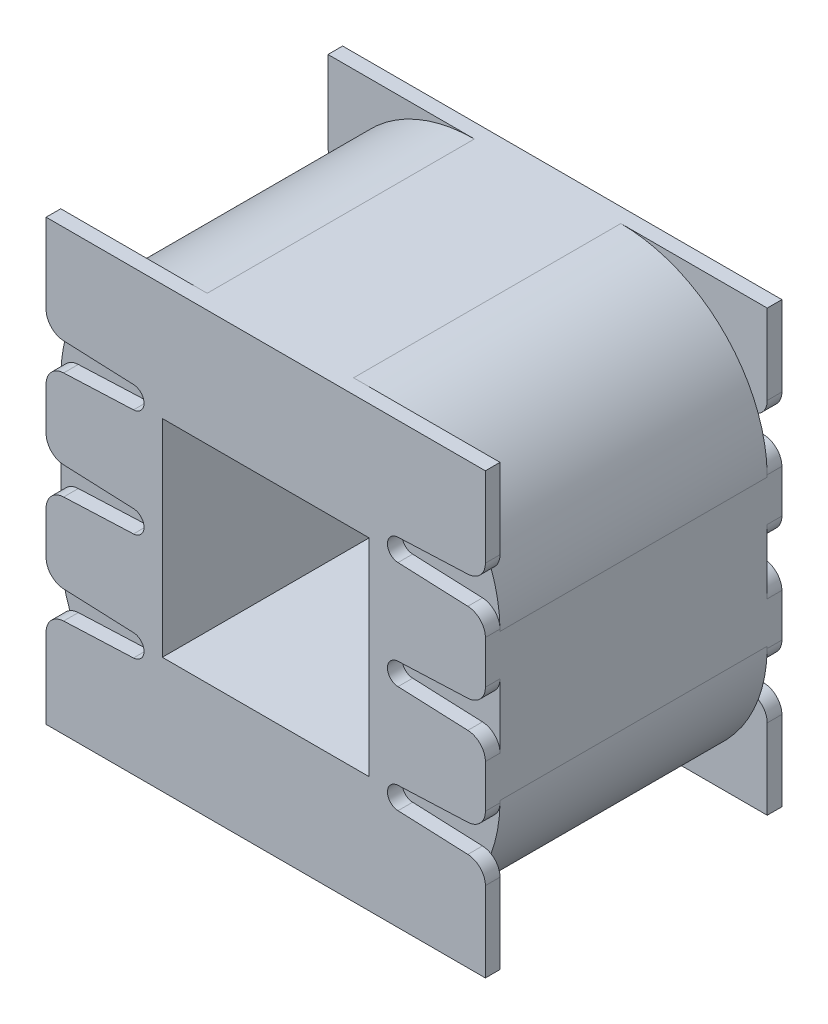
ISO-10303-21;
HEADER;
FILE_DESCRIPTION(('STEP AP214'),'2;1');
FILE_NAME('part.step','',(''),(''),'','','');
FILE_SCHEMA(('AUTOMOTIVE_DESIGN { 1 0 10303 214 1 1 1 1 }'));
ENDSEC;
DATA;
#1=APPLICATION_CONTEXT('core data for automotive mechanical design processes');
#2=APPLICATION_PROTOCOL_DEFINITION('international standard','automotive_design',2000,#1);
#3=PRODUCT_CONTEXT('',#1,'mechanical');
#4=PRODUCT('Part','Part','',(#3));
#5=PRODUCT_RELATED_PRODUCT_CATEGORY('part','',(#4));
#6=PRODUCT_DEFINITION_FORMATION('','',#4);
#7=PRODUCT_DEFINITION_CONTEXT('part definition',#1,'design');
#8=PRODUCT_DEFINITION('design','',#6,#7);
#9=PRODUCT_DEFINITION_SHAPE('','',#8);
#10=(LENGTH_UNIT() NAMED_UNIT(*) SI_UNIT(.MILLI.,.METRE.));
#11=(NAMED_UNIT(*) PLANE_ANGLE_UNIT() SI_UNIT($,.RADIAN.));
#12=(NAMED_UNIT(*) SI_UNIT($,.STERADIAN.) SOLID_ANGLE_UNIT());
#13=UNCERTAINTY_MEASURE_WITH_UNIT(LENGTH_MEASURE(1.E-05),#10,'distance_accuracy_value','');
#14=(GEOMETRIC_REPRESENTATION_CONTEXT(3) GLOBAL_UNCERTAINTY_ASSIGNED_CONTEXT((#13)) GLOBAL_UNIT_ASSIGNED_CONTEXT((#10,
#11,#12)) REPRESENTATION_CONTEXT('',''));
#15=CARTESIAN_POINT('',(0.,0.,0.));
#16=DIRECTION('',(0.,0.,1.));
#17=DIRECTION('',(1.,0.,0.));
#18=AXIS2_PLACEMENT_3D('',#15,#16,#17);
#19=CARTESIAN_POINT('',(-11.,7.62898866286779,0.8));
#20=DIRECTION('',(0.,0.,-1.));
#21=DIRECTION('',(-1.,0.,0.));
#22=AXIS2_PLACEMENT_3D('',#19,#20,#21);
#23=PLANE('',#22);
#24=CARTESIAN_POINT('',(-4.,4.,0.800000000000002));
#25=DIRECTION('',(0.,0.,-1.));
#26=DIRECTION('',(-1.,0.,0.));
#27=AXIS2_PLACEMENT_3D('',#24,#25,#26);
#28=CIRCLE('',#27,8.);
#29=CARTESIAN_POINT('',(-3.99999999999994,12.,0.8));
#30=VERTEX_POINT('',#29);
#31=CARTESIAN_POINT('',(-11.5063663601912,6.76667021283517,0.8));
#32=VERTEX_POINT('',#31);
#33=EDGE_CURVE('E56',#30,#32,#28,.F.);
#34=ORIENTED_EDGE('',*,*,#33,.F.);
#35=DIRECTION('',(1.,0.,0.));
#36=VECTOR('',#35,1.);
#37=CARTESIAN_POINT('',(-12.,12.,0.8));
#38=LINE('',#37,#36);
#39=CARTESIAN_POINT('',(-12.,12.,0.8));
#40=VERTEX_POINT('',#39);
#41=EDGE_CURVE('E13',#40,#30,#38,.T.);
#42=ORIENTED_EDGE('',*,*,#41,.F.);
#43=DIRECTION('',(0.,1.,0.));
#44=VECTOR('',#43,1.);
#45=CARTESIAN_POINT('',(-12.,12.,0.8));
#46=LINE('',#45,#44);
#47=CARTESIAN_POINT('',(-12.,7.62898866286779,0.8));
#48=VERTEX_POINT('',#47);
#49=EDGE_CURVE('E805',#48,#40,#46,.T.);
#50=ORIENTED_EDGE('',*,*,#49,.F.);
#51=CARTESIAN_POINT('',(-11.,7.62898866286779,0.8));
#52=DIRECTION('',(0.,0.,-1.));
#53=DIRECTION('',(-1.,0.,0.));
#54=AXIS2_PLACEMENT_3D('',#51,#52,#53);
#55=CIRCLE('',#54,1.);
#56=EDGE_CURVE('E801',#32,#48,#55,.T.);
#57=ORIENTED_EDGE('',*,*,#56,.F.);
#58=EDGE_LOOP('',(#34,#42,#50,#57));
#59=FACE_BOUND('',#58,.T.);
#60=ADVANCED_FACE('F34',(#59),#23,.F.);
#61=CARTESIAN_POINT('',(4.,4.,0.800000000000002));
#62=DIRECTION('',(0.,0.,-1.));
#63=DIRECTION('',(-1.,0.,0.));
#64=AXIS2_PLACEMENT_3D('',#61,#62,#63);
#65=CIRCLE('',#64,8.);
#66=CARTESIAN_POINT('',(11.5063663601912,6.76667021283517,0.8));
#67=VERTEX_POINT('',#66);
#68=CARTESIAN_POINT('',(3.99999999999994,12.,0.8));
#69=VERTEX_POINT('',#68);
#70=EDGE_CURVE('E1521',#67,#69,#65,.F.);
#71=ORIENTED_EDGE('',*,*,#70,.F.);
#72=CARTESIAN_POINT('',(11.,7.62898866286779,0.8));
#73=DIRECTION('',(0.,0.,-1.));
#74=DIRECTION('',(-1.,0.,0.));
#75=AXIS2_PLACEMENT_3D('',#72,#73,#74);
#76=CIRCLE('',#75,1.);
#77=CARTESIAN_POINT('',(12.,7.6289886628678,0.8));
#78=VERTEX_POINT('',#77);
#79=EDGE_CURVE('E711',#78,#67,#76,.T.);
#80=ORIENTED_EDGE('',*,*,#79,.F.);
#81=DIRECTION('',(0.,-1.,0.));
#82=VECTOR('',#81,1.);
#83=CARTESIAN_POINT('',(12.,12.,0.8));
#84=LINE('',#83,#82);
#85=CARTESIAN_POINT('',(12.,12.,0.8));
#86=VERTEX_POINT('',#85);
#87=EDGE_CURVE('E708',#86,#78,#84,.T.);
#88=ORIENTED_EDGE('',*,*,#87,.F.);
#89=EDGE_CURVE('E42',#69,#86,#38,.T.);
#90=ORIENTED_EDGE('',*,*,#89,.F.);
#91=EDGE_LOOP('',(#71,#80,#88,#90));
#92=FACE_BOUND('',#91,.T.);
#93=ADVANCED_FACE('F1523',(#92),#23,.F.);
#94=CARTESIAN_POINT('',(-11.9981574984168,4.17168759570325,0.8));
#95=VERTEX_POINT('',#94);
#96=CARTESIAN_POINT('',(-12.,3.99999999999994,0.8));
#97=VERTEX_POINT('',#96);
#98=EDGE_CURVE('E1551',#95,#97,#28,.F.);
#99=ORIENTED_EDGE('',*,*,#98,.F.);
#100=CARTESIAN_POINT('',(-11.,4.11101133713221,0.8));
#101=DIRECTION('',(0.,0.,-1.));
#102=DIRECTION('',(-1.,0.,0.));
#103=AXIS2_PLACEMENT_3D('',#100,#101,#102);
#104=CIRCLE('',#103,1.);
#105=CARTESIAN_POINT('',(-12.,4.1110113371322,0.8));
#106=VERTEX_POINT('',#105);
#107=EDGE_CURVE('E791',#106,#95,#104,.T.);
#108=ORIENTED_EDGE('',*,*,#107,.F.);
#109=DIRECTION('',(0.,1.,0.));
#110=VECTOR('',#109,1.);
#111=CARTESIAN_POINT('',(-12.,4.1110113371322,0.8));
#112=LINE('',#111,#110);
#113=EDGE_CURVE('E789',#97,#106,#112,.T.);
#114=ORIENTED_EDGE('',*,*,#113,.F.);
#115=EDGE_LOOP('',(#99,#108,#114));
#116=FACE_BOUND('',#115,.T.);
#117=ADVANCED_FACE('F1559',(#116),#23,.F.);
#118=CARTESIAN_POINT('',(-4.,-4.,0.800000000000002));
#119=DIRECTION('',(0.,0.,-1.));
#120=DIRECTION('',(-1.,0.,0.));
#121=AXIS2_PLACEMENT_3D('',#118,#119,#120);
#122=CIRCLE('',#121,8.);
#123=CARTESIAN_POINT('',(-12.0000000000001,-3.9999999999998,0.800000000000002));
#124=VERTEX_POINT('',#123);
#125=CARTESIAN_POINT('',(-11.9981574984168,-4.17168759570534,0.8));
#126=VERTEX_POINT('',#125);
#127=EDGE_CURVE('E1363',#124,#126,#122,.F.);
#128=ORIENTED_EDGE('',*,*,#127,.F.);
#129=DIRECTION('',(0.,1.,0.));
#130=VECTOR('',#129,1.);
#131=CARTESIAN_POINT('',(-12.,-1.7589886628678,0.8));
#132=LINE('',#131,#130);
#133=CARTESIAN_POINT('',(-12.0000000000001,-4.11101133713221,0.8));
#134=VERTEX_POINT('',#133);
#135=EDGE_CURVE('E672',#134,#124,#132,.T.);
#136=ORIENTED_EDGE('',*,*,#135,.F.);
#137=CARTESIAN_POINT('',(-11.0000000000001,-4.11101133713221,0.8));
#138=DIRECTION('',(0.,0.,-1.));
#139=DIRECTION('',(-1.,0.,0.));
#140=AXIS2_PLACEMENT_3D('',#137,#138,#139);
#141=CIRCLE('',#140,1.);
#142=EDGE_CURVE('E773',#126,#134,#141,.T.);
#143=ORIENTED_EDGE('',*,*,#142,.F.);
#144=EDGE_LOOP('',(#128,#136,#143));
#145=FACE_BOUND('',#144,.T.);
#146=ADVANCED_FACE('F1853',(#145),#23,.F.);
#147=CARTESIAN_POINT('',(-11.5063663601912,-6.76667021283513,0.8));
#148=VERTEX_POINT('',#147);
#149=CARTESIAN_POINT('',(-3.99999999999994,-12.,0.8));
#150=VERTEX_POINT('',#149);
#151=EDGE_CURVE('E1583',#148,#150,#122,.F.);
#152=ORIENTED_EDGE('',*,*,#151,.F.);
#153=CARTESIAN_POINT('',(-11.0000000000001,-7.62898866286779,0.8));
#154=DIRECTION('',(0.,0.,-1.));
#155=DIRECTION('',(-1.,0.,0.));
#156=AXIS2_PLACEMENT_3D('',#153,#154,#155);
#157=CIRCLE('',#156,1.);
#158=CARTESIAN_POINT('',(-12.0000000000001,-7.6289886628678,0.8));
#159=VERTEX_POINT('',#158);
#160=EDGE_CURVE('E763',#159,#148,#157,.T.);
#161=ORIENTED_EDGE('',*,*,#160,.F.);
#162=DIRECTION('',(0.,1.,0.));
#163=VECTOR('',#162,1.);
#164=CARTESIAN_POINT('',(-12.0000000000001,-7.6289886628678,0.8));
#165=LINE('',#164,#163);
#166=CARTESIAN_POINT('',(-12.,-12.,0.8));
#167=VERTEX_POINT('',#166);
#168=EDGE_CURVE('E760',#167,#159,#165,.T.);
#169=ORIENTED_EDGE('',*,*,#168,.F.);
#170=DIRECTION('',(-1.,0.,0.));
#171=VECTOR('',#170,1.);
#172=CARTESIAN_POINT('',(-12.,-12.,0.8));
#173=LINE('',#172,#171);
#174=EDGE_CURVE('E756',#150,#167,#173,.T.);
#175=ORIENTED_EDGE('',*,*,#174,.F.);
#176=EDGE_LOOP('',(#152,#161,#169,#175));
#177=FACE_BOUND('',#176,.T.);
#178=ADVANCED_FACE('F1847',(#177),#23,.F.);
#179=CARTESIAN_POINT('',(4.,-4.,0.800000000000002));
#180=DIRECTION('',(0.,0.,-1.));
#181=DIRECTION('',(-1.,0.,0.));
#182=AXIS2_PLACEMENT_3D('',#179,#180,#181);
#183=CIRCLE('',#182,8.);
#184=CARTESIAN_POINT('',(4.,-12.,0.800000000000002));
#185=VERTEX_POINT('',#184);
#186=CARTESIAN_POINT('',(11.5063663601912,-6.76667021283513,0.8));
#187=VERTEX_POINT('',#186);
#188=EDGE_CURVE('E1586',#185,#187,#183,.F.);
#189=ORIENTED_EDGE('',*,*,#188,.F.);
#190=CARTESIAN_POINT('',(12.,-12.,0.8));
#191=VERTEX_POINT('',#190);
#192=EDGE_CURVE('E757',#191,#185,#173,.T.);
#193=ORIENTED_EDGE('',*,*,#192,.F.);
#194=DIRECTION('',(0.,-1.,0.));
#195=VECTOR('',#194,1.);
#196=CARTESIAN_POINT('',(12.0000000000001,-7.6289886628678,0.8));
#197=LINE('',#196,#195);
#198=CARTESIAN_POINT('',(12.0000000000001,-7.6289886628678,0.8));
#199=VERTEX_POINT('',#198);
#200=EDGE_CURVE('E753',#199,#191,#197,.T.);
#201=ORIENTED_EDGE('',*,*,#200,.F.);
#202=CARTESIAN_POINT('',(11.0000000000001,-7.62898866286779,0.8));
#203=DIRECTION('',(0.,0.,-1.));
#204=DIRECTION('',(-1.,0.,0.));
#205=AXIS2_PLACEMENT_3D('',#202,#203,#204);
#206=CIRCLE('',#205,1.);
#207=EDGE_CURVE('E749',#187,#199,#206,.T.);
#208=ORIENTED_EDGE('',*,*,#207,.F.);
#209=EDGE_LOOP('',(#189,#193,#201,#208));
#210=FACE_BOUND('',#209,.T.);
#211=ADVANCED_FACE('F1751',(#210),#23,.F.);
#212=CARTESIAN_POINT('',(11.9981574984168,-4.17168759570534,0.8));
#213=VERTEX_POINT('',#212);
#214=CARTESIAN_POINT('',(12.0000000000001,-3.99999999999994,0.8));
#215=VERTEX_POINT('',#214);
#216=EDGE_CURVE('E1589',#213,#215,#183,.F.);
#217=ORIENTED_EDGE('',*,*,#216,.F.);
#218=CARTESIAN_POINT('',(11.0000000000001,-4.11101133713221,0.8));
#219=DIRECTION('',(0.,0.,-1.));
#220=DIRECTION('',(-1.,0.,0.));
#221=AXIS2_PLACEMENT_3D('',#218,#219,#220);
#222=CIRCLE('',#221,1.);
#223=CARTESIAN_POINT('',(12.0000000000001,-4.1110113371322,0.8));
#224=VERTEX_POINT('',#223);
#225=EDGE_CURVE('E739',#224,#213,#222,.T.);
#226=ORIENTED_EDGE('',*,*,#225,.F.);
#227=DIRECTION('',(0.,-1.,0.));
#228=VECTOR('',#227,1.);
#229=CARTESIAN_POINT('',(12.,-1.7589886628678,0.8));
#230=LINE('',#229,#228);
#231=EDGE_CURVE('E737',#215,#224,#230,.T.);
#232=ORIENTED_EDGE('',*,*,#231,.F.);
#233=EDGE_LOOP('',(#217,#226,#232));
#234=FACE_BOUND('',#233,.T.);
#235=ADVANCED_FACE('F1744',(#234),#23,.F.);
#236=CARTESIAN_POINT('',(12.,4.00000000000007,0.800000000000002));
#237=VERTEX_POINT('',#236);
#238=CARTESIAN_POINT('',(11.9981574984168,4.17168759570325,0.800000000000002));
#239=VERTEX_POINT('',#238);
#240=EDGE_CURVE('E1556',#237,#239,#65,.F.);
#241=ORIENTED_EDGE('',*,*,#240,.F.);
#242=DIRECTION('',(0.,-1.,0.));
#243=VECTOR('',#242,1.);
#244=CARTESIAN_POINT('',(12.,4.1110113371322,0.8));
#245=LINE('',#244,#243);
#246=CARTESIAN_POINT('',(12.,4.1110113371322,0.8));
#247=VERTEX_POINT('',#246);
#248=EDGE_CURVE('E723',#247,#237,#245,.T.);
#249=ORIENTED_EDGE('',*,*,#248,.F.);
#250=CARTESIAN_POINT('',(11.,4.11101133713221,0.8));
#251=DIRECTION('',(0.,0.,-1.));
#252=DIRECTION('',(-1.,0.,0.));
#253=AXIS2_PLACEMENT_3D('',#250,#251,#252);
#254=CIRCLE('',#253,1.);
#255=EDGE_CURVE('E720',#239,#247,#254,.T.);
#256=ORIENTED_EDGE('',*,*,#255,.F.);
#257=EDGE_LOOP('',(#241,#249,#256));
#258=FACE_BOUND('',#257,.T.);
#259=ADVANCED_FACE('F1735',(#258),#23,.F.);
#260=CARTESIAN_POINT('',(-11.,7.62898866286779,15.4));
#261=DIRECTION('',(0.,0.,-1.));
#262=DIRECTION('',(-1.,0.,0.));
#263=AXIS2_PLACEMENT_3D('',#260,#261,#262);
#264=PLANE('',#263);
#265=DIRECTION('',(1.,0.,0.));
#266=VECTOR('',#265,1.);
#267=CARTESIAN_POINT('',(-12.,12.,15.4));
#268=LINE('',#267,#266);
#269=CARTESIAN_POINT('',(-12.,12.,15.4));
#270=VERTEX_POINT('',#269);
#271=CARTESIAN_POINT('',(-3.99999999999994,12.,15.4));
#272=VERTEX_POINT('',#271);
#273=EDGE_CURVE('E1197',#270,#272,#268,.T.);
#274=ORIENTED_EDGE('',*,*,#273,.T.);
#275=CARTESIAN_POINT('',(-4.,4.,15.4));
#276=DIRECTION('',(0.,0.,-1.));
#277=DIRECTION('',(-1.,0.,0.));
#278=AXIS2_PLACEMENT_3D('',#275,#276,#277);
#279=CIRCLE('',#278,8.);
#280=CARTESIAN_POINT('',(-11.5063663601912,6.76667021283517,15.4));
#281=VERTEX_POINT('',#280);
#282=EDGE_CURVE('E1387',#281,#272,#279,.T.);
#283=ORIENTED_EDGE('',*,*,#282,.F.);
#284=CARTESIAN_POINT('',(-11.,7.62898866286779,15.4));
#285=DIRECTION('',(0.,0.,-1.));
#286=DIRECTION('',(-1.,0.,0.));
#287=AXIS2_PLACEMENT_3D('',#284,#285,#286);
#288=CIRCLE('',#287,1.);
#289=CARTESIAN_POINT('',(-12.,7.62898866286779,15.4));
#290=VERTEX_POINT('',#289);
#291=EDGE_CURVE('E703',#281,#290,#288,.T.);
#292=ORIENTED_EDGE('',*,*,#291,.T.);
#293=DIRECTION('',(0.,1.,0.));
#294=VECTOR('',#293,1.);
#295=CARTESIAN_POINT('',(-12.,12.,15.4));
#296=LINE('',#295,#294);
#297=EDGE_CURVE('E706',#290,#270,#296,.T.);
#298=ORIENTED_EDGE('',*,*,#297,.T.);
#299=EDGE_LOOP('',(#274,#283,#292,#298));
#300=FACE_BOUND('',#299,.T.);
#301=ADVANCED_FACE('F1743',(#300),#264,.T.);
#302=CARTESIAN_POINT('',(11.,7.62898866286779,15.4));
#303=DIRECTION('',(0.,0.,-1.));
#304=DIRECTION('',(-1.,0.,0.));
#305=AXIS2_PLACEMENT_3D('',#302,#303,#304);
#306=CIRCLE('',#305,1.);
#307=CARTESIAN_POINT('',(12.,7.6289886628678,15.4));
#308=VERTEX_POINT('',#307);
#309=CARTESIAN_POINT('',(11.5063663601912,6.76667021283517,15.4));
#310=VERTEX_POINT('',#309);
#311=EDGE_CURVE('E1220',#308,#310,#306,.T.);
#312=ORIENTED_EDGE('',*,*,#311,.T.);
#313=CARTESIAN_POINT('',(4.,4.,15.4));
#314=DIRECTION('',(0.,0.,-1.));
#315=DIRECTION('',(-1.,0.,0.));
#316=AXIS2_PLACEMENT_3D('',#313,#314,#315);
#317=CIRCLE('',#316,8.);
#318=CARTESIAN_POINT('',(3.99999999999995,12.,15.4));
#319=VERTEX_POINT('',#318);
#320=EDGE_CURVE('E1211',#319,#310,#317,.T.);
#321=ORIENTED_EDGE('',*,*,#320,.F.);
#322=CARTESIAN_POINT('',(12.,12.,15.4));
#323=VERTEX_POINT('',#322);
#324=EDGE_CURVE('E1196',#319,#323,#268,.T.);
#325=ORIENTED_EDGE('',*,*,#324,.T.);
#326=DIRECTION('',(0.,-1.,0.));
#327=VECTOR('',#326,1.);
#328=CARTESIAN_POINT('',(12.,12.,15.4));
#329=LINE('',#328,#327);
#330=EDGE_CURVE('E1208',#323,#308,#329,.T.);
#331=ORIENTED_EDGE('',*,*,#330,.T.);
#332=EDGE_LOOP('',(#312,#321,#325,#331));
#333=FACE_BOUND('',#332,.T.);
#334=ADVANCED_FACE('F1207',(#333),#264,.T.);
#335=CARTESIAN_POINT('',(-11.,4.11101133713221,15.4));
#336=DIRECTION('',(0.,0.,-1.));
#337=DIRECTION('',(-1.,0.,0.));
#338=AXIS2_PLACEMENT_3D('',#335,#336,#337);
#339=CIRCLE('',#338,1.);
#340=CARTESIAN_POINT('',(-12.,4.1110113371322,15.4));
#341=VERTEX_POINT('',#340);
#342=CARTESIAN_POINT('',(-11.9981574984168,4.17168759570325,15.4));
#343=VERTEX_POINT('',#342);
#344=EDGE_CURVE('E694',#341,#343,#339,.T.);
#345=ORIENTED_EDGE('',*,*,#344,.T.);
#346=CARTESIAN_POINT('',(-12.,3.99999999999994,15.4));
#347=VERTEX_POINT('',#346);
#348=EDGE_CURVE('E1354',#347,#343,#279,.T.);
#349=ORIENTED_EDGE('',*,*,#348,.F.);
#350=DIRECTION('',(0.,1.,0.));
#351=VECTOR('',#350,1.);
#352=CARTESIAN_POINT('',(-12.,4.1110113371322,15.4));
#353=LINE('',#352,#351);
#354=EDGE_CURVE('E692',#347,#341,#353,.T.);
#355=ORIENTED_EDGE('',*,*,#354,.T.);
#356=EDGE_LOOP('',(#345,#349,#355));
#357=FACE_BOUND('',#356,.T.);
#358=ADVANCED_FACE('F1352',(#357),#264,.T.);
#359=DIRECTION('',(0.,1.,0.));
#360=VECTOR('',#359,1.);
#361=CARTESIAN_POINT('',(-12.,-1.7589886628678,15.4));
#362=LINE('',#361,#360);
#363=CARTESIAN_POINT('',(-12.0000000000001,-4.11101133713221,15.4));
#364=VERTEX_POINT('',#363);
#365=CARTESIAN_POINT('',(-12.,-4.,15.4));
#366=VERTEX_POINT('',#365);
#367=EDGE_CURVE('E669',#364,#366,#362,.T.);
#368=ORIENTED_EDGE('',*,*,#367,.T.);
#369=CARTESIAN_POINT('',(-4.,-4.,15.4));
#370=DIRECTION('',(0.,0.,-1.));
#371=DIRECTION('',(-1.,0.,0.));
#372=AXIS2_PLACEMENT_3D('',#369,#370,#371);
#373=CIRCLE('',#372,8.);
#374=CARTESIAN_POINT('',(-11.9981574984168,-4.17168759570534,15.4));
#375=VERTEX_POINT('',#374);
#376=EDGE_CURVE('E650',#375,#366,#373,.T.);
#377=ORIENTED_EDGE('',*,*,#376,.F.);
#378=CARTESIAN_POINT('',(-11.0000000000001,-4.11101133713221,15.4));
#379=DIRECTION('',(0.,0.,-1.));
#380=DIRECTION('',(-1.,0.,0.));
#381=AXIS2_PLACEMENT_3D('',#378,#379,#380);
#382=CIRCLE('',#381,1.);
#383=EDGE_CURVE('E676',#375,#364,#382,.T.);
#384=ORIENTED_EDGE('',*,*,#383,.T.);
#385=EDGE_LOOP('',(#368,#377,#384));
#386=FACE_BOUND('',#385,.T.);
#387=ADVANCED_FACE('F675',(#386),#264,.T.);
#388=CARTESIAN_POINT('',(-11.0000000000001,-7.62898866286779,15.4));
#389=DIRECTION('',(0.,0.,-1.));
#390=DIRECTION('',(-1.,0.,0.));
#391=AXIS2_PLACEMENT_3D('',#388,#389,#390);
#392=CIRCLE('',#391,1.);
#393=CARTESIAN_POINT('',(-12.0000000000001,-7.6289886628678,15.4));
#394=VERTEX_POINT('',#393);
#395=CARTESIAN_POINT('',(-11.5063663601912,-6.76667021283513,15.4));
#396=VERTEX_POINT('',#395);
#397=EDGE_CURVE('E1286',#394,#396,#392,.T.);
#398=ORIENTED_EDGE('',*,*,#397,.T.);
#399=CARTESIAN_POINT('',(-3.99999999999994,-12.,15.4));
#400=VERTEX_POINT('',#399);
#401=EDGE_CURVE('E662',#400,#396,#373,.T.);
#402=ORIENTED_EDGE('',*,*,#401,.F.);
#403=DIRECTION('',(-1.,0.,0.));
#404=VECTOR('',#403,1.);
#405=CARTESIAN_POINT('',(-12.,-12.,15.4));
#406=LINE('',#405,#404);
#407=CARTESIAN_POINT('',(-12.,-12.,15.4));
#408=VERTEX_POINT('',#407);
#409=EDGE_CURVE('E1280',#400,#408,#406,.T.);
#410=ORIENTED_EDGE('',*,*,#409,.T.);
#411=DIRECTION('',(0.,1.,0.));
#412=VECTOR('',#411,1.);
#413=CARTESIAN_POINT('',(-12.0000000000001,-7.6289886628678,15.4));
#414=LINE('',#413,#412);
#415=EDGE_CURVE('E1284',#408,#394,#414,.T.);
#416=ORIENTED_EDGE('',*,*,#415,.T.);
#417=EDGE_LOOP('',(#398,#402,#410,#416));
#418=FACE_BOUND('',#417,.T.);
#419=ADVANCED_FACE('F1813',(#418),#264,.T.);
#420=CARTESIAN_POINT('',(12.,-12.,15.4));
#421=VERTEX_POINT('',#420);
#422=CARTESIAN_POINT('',(3.99999999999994,-12.,15.4));
#423=VERTEX_POINT('',#422);
#424=EDGE_CURVE('E1281',#421,#423,#406,.T.);
#425=ORIENTED_EDGE('',*,*,#424,.T.);
#426=CARTESIAN_POINT('',(4.,-4.,15.4));
#427=DIRECTION('',(0.,0.,-1.));
#428=DIRECTION('',(-1.,0.,0.));
#429=AXIS2_PLACEMENT_3D('',#426,#427,#428);
#430=CIRCLE('',#429,8.);
#431=CARTESIAN_POINT('',(11.5063663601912,-6.76667021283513,15.4));
#432=VERTEX_POINT('',#431);
#433=EDGE_CURVE('E1368',#432,#423,#430,.T.);
#434=ORIENTED_EDGE('',*,*,#433,.F.);
#435=CARTESIAN_POINT('',(11.0000000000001,-7.62898866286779,15.4));
#436=DIRECTION('',(0.,0.,-1.));
#437=DIRECTION('',(-1.,0.,0.));
#438=AXIS2_PLACEMENT_3D('',#435,#436,#437);
#439=CIRCLE('',#438,1.);
#440=CARTESIAN_POINT('',(12.0000000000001,-7.6289886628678,15.4));
#441=VERTEX_POINT('',#440);
#442=EDGE_CURVE('E1275',#432,#441,#439,.T.);
#443=ORIENTED_EDGE('',*,*,#442,.T.);
#444=DIRECTION('',(0.,-1.,0.));
#445=VECTOR('',#444,1.);
#446=CARTESIAN_POINT('',(12.0000000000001,-7.6289886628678,15.4));
#447=LINE('',#446,#445);
#448=EDGE_CURVE('E1278',#441,#421,#447,.T.);
#449=ORIENTED_EDGE('',*,*,#448,.T.);
#450=EDGE_LOOP('',(#425,#434,#443,#449));
#451=FACE_BOUND('',#450,.T.);
#452=ADVANCED_FACE('F1767',(#451),#264,.T.);
#453=CARTESIAN_POINT('',(11.0000000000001,-4.11101133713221,15.4));
#454=DIRECTION('',(0.,0.,-1.));
#455=DIRECTION('',(-1.,0.,0.));
#456=AXIS2_PLACEMENT_3D('',#453,#454,#455);
#457=CIRCLE('',#456,1.);
#458=CARTESIAN_POINT('',(12.0000000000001,-4.1110113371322,15.4));
#459=VERTEX_POINT('',#458);
#460=CARTESIAN_POINT('',(11.9981574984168,-4.17168759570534,15.4));
#461=VERTEX_POINT('',#460);
#462=EDGE_CURVE('E1266',#459,#461,#457,.T.);
#463=ORIENTED_EDGE('',*,*,#462,.T.);
#464=CARTESIAN_POINT('',(12.,-3.99999999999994,15.4));
#465=VERTEX_POINT('',#464);
#466=EDGE_CURVE('E1373',#465,#461,#430,.T.);
#467=ORIENTED_EDGE('',*,*,#466,.F.);
#468=DIRECTION('',(0.,-1.,0.));
#469=VECTOR('',#468,1.);
#470=CARTESIAN_POINT('',(12.,-1.7589886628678,15.4));
#471=LINE('',#470,#469);
#472=EDGE_CURVE('E1264',#465,#459,#471,.T.);
#473=ORIENTED_EDGE('',*,*,#472,.T.);
#474=EDGE_LOOP('',(#463,#467,#473));
#475=FACE_BOUND('',#474,.T.);
#476=ADVANCED_FACE('F1759',(#475),#264,.T.);
#477=DIRECTION('',(0.,-1.,0.));
#478=VECTOR('',#477,1.);
#479=CARTESIAN_POINT('',(12.,4.1110113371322,15.4));
#480=LINE('',#479,#478);
#481=CARTESIAN_POINT('',(12.,4.1110113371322,15.4));
#482=VERTEX_POINT('',#481);
#483=CARTESIAN_POINT('',(12.,3.99999999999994,15.4));
#484=VERTEX_POINT('',#483);
#485=EDGE_CURVE('E1251',#482,#484,#480,.T.);
#486=ORIENTED_EDGE('',*,*,#485,.T.);
#487=CARTESIAN_POINT('',(11.9981574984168,4.17168759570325,15.4));
#488=VERTEX_POINT('',#487);
#489=EDGE_CURVE('E1377',#488,#484,#317,.T.);
#490=ORIENTED_EDGE('',*,*,#489,.F.);
#491=CARTESIAN_POINT('',(11.,4.11101133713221,15.4));
#492=DIRECTION('',(0.,0.,-1.));
#493=DIRECTION('',(-1.,0.,0.));
#494=AXIS2_PLACEMENT_3D('',#491,#492,#493);
#495=CIRCLE('',#494,1.);
#496=EDGE_CURVE('E1247',#488,#482,#495,.T.);
#497=ORIENTED_EDGE('',*,*,#496,.T.);
#498=EDGE_LOOP('',(#486,#490,#497));
#499=FACE_BOUND('',#498,.T.);
#500=ADVANCED_FACE('F1750',(#499),#264,.T.);
#501=CARTESIAN_POINT('',(-12.,12.,16.2));
#502=DIRECTION('',(1.,0.,0.));
#503=DIRECTION('',(0.,1.,0.));
#504=AXIS2_PLACEMENT_3D('',#501,#502,#503);
#505=PLANE('',#504);
#506=ORIENTED_EDGE('',*,*,#297,.F.);
#507=DIRECTION('',(0.,0.,-1.));
#508=VECTOR('',#507,1.);
#509=CARTESIAN_POINT('',(-12.,7.6289886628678,16.2));
#510=LINE('',#509,#508);
#511=CARTESIAN_POINT('',(-12.,7.6289886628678,16.2));
#512=VERTEX_POINT('',#511);
#513=EDGE_CURVE('E1194',#512,#290,#510,.T.);
#514=ORIENTED_EDGE('',*,*,#513,.F.);
#515=DIRECTION('',(0.,-1.,0.));
#516=VECTOR('',#515,1.);
#517=CARTESIAN_POINT('',(-12.,12.,16.2));
#518=LINE('',#517,#516);
#519=CARTESIAN_POINT('',(-12.,12.,16.2));
#520=VERTEX_POINT('',#519);
#521=EDGE_CURVE('E957',#520,#512,#518,.T.);
#522=ORIENTED_EDGE('',*,*,#521,.F.);
#523=DIRECTION('',(0.,0.,-1.));
#524=VECTOR('',#523,1.);
#525=CARTESIAN_POINT('',(-12.,12.,16.2));
#526=LINE('',#525,#524);
#527=EDGE_CURVE('E1039',#520,#270,#526,.T.);
#528=ORIENTED_EDGE('',*,*,#527,.T.);
#529=EDGE_LOOP('',(#506,#514,#522,#528));
#530=FACE_BOUND('',#529,.T.);
#531=ADVANCED_FACE('F1758',(#530),#505,.F.);
#532=CARTESIAN_POINT('',(-11.,7.62898866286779,16.2));
#533=DIRECTION('',(0.,0.,-1.));
#534=DIRECTION('',(-1.,0.,0.));
#535=AXIS2_PLACEMENT_3D('',#532,#533,#534);
#536=CYLINDRICAL_SURFACE('',#535,1.);
#537=CARTESIAN_POINT('',(-11.0418515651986,6.62986482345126,15.4));
#538=VERTEX_POINT('',#537);
#539=EDGE_CURVE('E704',#538,#281,#288,.T.);
#540=ORIENTED_EDGE('',*,*,#539,.F.);
#541=DIRECTION('',(0.,0.,-1.));
#542=VECTOR('',#541,1.);
#543=CARTESIAN_POINT('',(-11.0418515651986,6.62986482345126,16.2));
#544=LINE('',#543,#542);
#545=CARTESIAN_POINT('',(-11.0418515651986,6.62986482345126,16.2));
#546=VERTEX_POINT('',#545);
#547=EDGE_CURVE('E1190',#546,#538,#544,.T.);
#548=ORIENTED_EDGE('',*,*,#547,.F.);
#549=CARTESIAN_POINT('',(-11.,7.62898866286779,16.2));
#550=DIRECTION('',(0.,0.,1.));
#551=DIRECTION('',(-1.,0.,0.));
#552=AXIS2_PLACEMENT_3D('',#549,#550,#551);
#553=CIRCLE('',#552,1.);
#554=EDGE_CURVE('E960',#512,#546,#553,.T.);
#555=ORIENTED_EDGE('',*,*,#554,.F.);
#556=ORIENTED_EDGE('',*,*,#513,.T.);
#557=ORIENTED_EDGE('',*,*,#291,.F.);
#558=EDGE_LOOP('',(#540,#548,#555,#556,#557));
#559=FACE_BOUND('',#558,.T.);
#560=ADVANCED_FACE('F1765',(#559),#536,.T.);
#561=CARTESIAN_POINT('',(-7.22539319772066,6.47,16.2));
#562=DIRECTION('',(0.0418515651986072,0.999123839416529,0.));
#563=DIRECTION('',(-0.999123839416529,0.0418515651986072,0.));
#564=AXIS2_PLACEMENT_3D('',#561,#562,#563);
#565=PLANE('',#564);
#566=DIRECTION('',(-0.999123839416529,0.0418515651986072,0.));
#567=VECTOR('',#566,1.);
#568=CARTESIAN_POINT('',(-7.22539319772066,6.47,15.4));
#569=LINE('',#568,#567);
#570=CARTESIAN_POINT('',(-7.22539319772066,6.47,15.4));
#571=VERTEX_POINT('',#570);
#572=EDGE_CURVE('E701',#571,#538,#569,.T.);
#573=ORIENTED_EDGE('',*,*,#572,.F.);
#574=DIRECTION('',(0.,0.,-1.));
#575=VECTOR('',#574,1.);
#576=CARTESIAN_POINT('',(-7.22539319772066,6.47,16.2));
#577=LINE('',#576,#575);
#578=CARTESIAN_POINT('',(-7.22539319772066,6.47,16.2));
#579=VERTEX_POINT('',#578);
#580=EDGE_CURVE('E1186',#579,#571,#577,.T.);
#581=ORIENTED_EDGE('',*,*,#580,.F.);
#582=DIRECTION('',(0.999123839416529,-0.0418515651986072,0.));
#583=VECTOR('',#582,1.);
#584=CARTESIAN_POINT('',(-7.22539319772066,6.47,16.2));
#585=LINE('',#584,#583);
#586=EDGE_CURVE('E962',#546,#579,#585,.T.);
#587=ORIENTED_EDGE('',*,*,#586,.F.);
#588=ORIENTED_EDGE('',*,*,#547,.T.);
#589=EDGE_LOOP('',(#573,#581,#587,#588));
#590=FACE_BOUND('',#589,.T.);
#591=ADVANCED_FACE('F2280',(#590),#565,.F.);
#592=CARTESIAN_POINT('',(-7.25052615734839,5.87,16.2));
#593=DIRECTION('',(0.,0.,-1.));
#594=DIRECTION('',(-1.,0.,0.));
#595=AXIS2_PLACEMENT_3D('',#592,#593,#594);
#596=CYLINDRICAL_SURFACE('',#595,0.600526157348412);
#597=ORIENTED_EDGE('',*,*,#580,.T.);
#598=CARTESIAN_POINT('',(-7.25052615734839,5.87,15.4));
#599=DIRECTION('',(0.,0.,-1.));
#600=DIRECTION('',(-1.,0.,0.));
#601=AXIS2_PLACEMENT_3D('',#598,#599,#600);
#602=CIRCLE('',#601,0.600526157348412);
#603=CARTESIAN_POINT('',(-7.22539319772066,5.27,15.4));
#604=VERTEX_POINT('',#603);
#605=EDGE_CURVE('E699',#604,#571,#602,.F.);
#606=ORIENTED_EDGE('',*,*,#605,.F.);
#607=DIRECTION('',(0.,0.,-1.));
#608=VECTOR('',#607,1.);
#609=CARTESIAN_POINT('',(-7.22539319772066,5.27,16.2));
#610=LINE('',#609,#608);
#611=CARTESIAN_POINT('',(-7.22539319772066,5.27,16.2));
#612=VERTEX_POINT('',#611);
#613=EDGE_CURVE('E1182',#612,#604,#610,.T.);
#614=ORIENTED_EDGE('',*,*,#613,.F.);
#615=CARTESIAN_POINT('',(-7.25052615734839,5.87,16.2));
#616=DIRECTION('',(0.,0.,-1.));
#617=DIRECTION('',(-1.,0.,0.));
#618=AXIS2_PLACEMENT_3D('',#615,#616,#617);
#619=CIRCLE('',#618,0.600526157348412);
#620=EDGE_CURVE('E964',#579,#612,#619,.T.);
#621=ORIENTED_EDGE('',*,*,#620,.F.);
#622=EDGE_LOOP('',(#597,#606,#614,#621));
#623=FACE_BOUND('',#622,.T.);
#624=ADVANCED_FACE('F2271',(#623),#596,.F.);
#625=CARTESIAN_POINT('',(-7.22539319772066,5.27,16.2));
#626=DIRECTION('',(0.0418515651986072,-0.999123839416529,0.));
#627=DIRECTION('',(0.999123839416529,0.0418515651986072,0.));
#628=AXIS2_PLACEMENT_3D('',#625,#626,#627);
#629=PLANE('',#628);
#630=DIRECTION('',(0.999123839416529,0.0418515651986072,0.));
#631=VECTOR('',#630,1.);
#632=CARTESIAN_POINT('',(-7.22539319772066,5.27,15.4));
#633=LINE('',#632,#631);
#634=CARTESIAN_POINT('',(-11.0418515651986,5.11013517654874,15.4));
#635=VERTEX_POINT('',#634);
#636=EDGE_CURVE('E697',#635,#604,#633,.T.);
#637=ORIENTED_EDGE('',*,*,#636,.F.);
#638=DIRECTION('',(0.,0.,-1.));
#639=VECTOR('',#638,1.);
#640=CARTESIAN_POINT('',(-11.0418515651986,5.11013517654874,16.2));
#641=LINE('',#640,#639);
#642=CARTESIAN_POINT('',(-11.0418515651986,5.11013517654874,16.2));
#643=VERTEX_POINT('',#642);
#644=EDGE_CURVE('E1178',#643,#635,#641,.T.);
#645=ORIENTED_EDGE('',*,*,#644,.F.);
#646=DIRECTION('',(-0.999123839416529,-0.0418515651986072,0.));
#647=VECTOR('',#646,1.);
#648=CARTESIAN_POINT('',(-7.22539319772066,5.27,16.2));
#649=LINE('',#648,#647);
#650=EDGE_CURVE('E966',#612,#643,#649,.T.);
#651=ORIENTED_EDGE('',*,*,#650,.F.);
#652=ORIENTED_EDGE('',*,*,#613,.T.);
#653=EDGE_LOOP('',(#637,#645,#651,#652));
#654=FACE_BOUND('',#653,.T.);
#655=ADVANCED_FACE('F2264',(#654),#629,.F.);
#656=CARTESIAN_POINT('',(-11.,4.11101133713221,16.2));
#657=DIRECTION('',(0.,0.,-1.));
#658=DIRECTION('',(-1.,0.,0.));
#659=AXIS2_PLACEMENT_3D('',#656,#657,#658);
#660=CYLINDRICAL_SURFACE('',#659,1.);
#661=ORIENTED_EDGE('',*,*,#344,.F.);
#662=DIRECTION('',(0.,0.,-1.));
#663=VECTOR('',#662,1.);
#664=CARTESIAN_POINT('',(-12.,4.1110113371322,16.2));
#665=LINE('',#664,#663);
#666=CARTESIAN_POINT('',(-12.,4.1110113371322,16.2));
#667=VERTEX_POINT('',#666);
#668=EDGE_CURVE('E1174',#667,#341,#665,.T.);
#669=ORIENTED_EDGE('',*,*,#668,.F.);
#670=CARTESIAN_POINT('',(-11.,4.11101133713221,16.2));
#671=DIRECTION('',(0.,0.,1.));
#672=DIRECTION('',(1.,0.,0.));
#673=AXIS2_PLACEMENT_3D('',#670,#671,#672);
#674=CIRCLE('',#673,1.);
#675=EDGE_CURVE('E968',#643,#667,#674,.T.);
#676=ORIENTED_EDGE('',*,*,#675,.F.);
#677=ORIENTED_EDGE('',*,*,#644,.T.);
#678=CARTESIAN_POINT('',(-11.,4.11101133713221,15.4));
#679=DIRECTION('',(0.,0.,-1.));
#680=DIRECTION('',(-1.,0.,0.));
#681=AXIS2_PLACEMENT_3D('',#678,#679,#680);
#682=CIRCLE('',#681,1.);
#683=EDGE_CURVE('E1349',#343,#635,#682,.T.);
#684=ORIENTED_EDGE('',*,*,#683,.F.);
#685=EDGE_LOOP('',(#661,#669,#676,#677,#684));
#686=FACE_BOUND('',#685,.T.);
#687=ADVANCED_FACE('F1347',(#686),#660,.T.);
#688=CARTESIAN_POINT('',(-11.,1.75898866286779,16.2));
#689=DIRECTION('',(0.,0.,-1.));
#690=DIRECTION('',(-1.,0.,0.));
#691=AXIS2_PLACEMENT_3D('',#688,#689,#690);
#692=CYLINDRICAL_SURFACE('',#691,1.);
#693=CARTESIAN_POINT('',(-11.,1.75898866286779,15.4));
#694=DIRECTION('',(0.,0.,-1.));
#695=DIRECTION('',(-1.,0.,0.));
#696=AXIS2_PLACEMENT_3D('',#693,#694,#695);
#697=CIRCLE('',#696,1.);
#698=CARTESIAN_POINT('',(-11.0418515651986,0.759864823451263,15.4));
#699=VERTEX_POINT('',#698);
#700=CARTESIAN_POINT('',(-12.,1.75898866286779,15.4));
#701=VERTEX_POINT('',#700);
#702=EDGE_CURVE('E690',#699,#701,#697,.T.);
#703=ORIENTED_EDGE('',*,*,#702,.F.);
#704=DIRECTION('',(0.,0.,-1.));
#705=VECTOR('',#704,1.);
#706=CARTESIAN_POINT('',(-11.0418515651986,0.759864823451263,16.2));
#707=LINE('',#706,#705);
#708=CARTESIAN_POINT('',(-11.0418515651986,0.759864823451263,16.2));
#709=VERTEX_POINT('',#708);
#710=EDGE_CURVE('E1166',#709,#699,#707,.T.);
#711=ORIENTED_EDGE('',*,*,#710,.F.);
#712=CARTESIAN_POINT('',(-11.,1.75898866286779,16.2));
#713=DIRECTION('',(0.,0.,1.));
#714=DIRECTION('',(-1.,0.,0.));
#715=AXIS2_PLACEMENT_3D('',#712,#713,#714);
#716=CIRCLE('',#715,1.);
#717=CARTESIAN_POINT('',(-12.,1.7589886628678,16.2));
#718=VERTEX_POINT('',#717);
#719=EDGE_CURVE('E972',#718,#709,#716,.T.);
#720=ORIENTED_EDGE('',*,*,#719,.F.);
#721=DIRECTION('',(0.,0.,-1.));
#722=VECTOR('',#721,1.);
#723=CARTESIAN_POINT('',(-12.,1.7589886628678,16.2));
#724=LINE('',#723,#722);
#725=EDGE_CURVE('E1170',#718,#701,#724,.T.);
#726=ORIENTED_EDGE('',*,*,#725,.T.);
#727=EDGE_LOOP('',(#703,#711,#720,#726));
#728=FACE_BOUND('',#727,.T.);
#729=ADVANCED_FACE('F1338',(#728),#692,.T.);
#730=CARTESIAN_POINT('',(-7.22539319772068,0.6,16.2));
#731=DIRECTION('',(0.0418515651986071,0.999123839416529,0.));
#732=DIRECTION('',(-0.999123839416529,0.0418515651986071,0.));
#733=AXIS2_PLACEMENT_3D('',#730,#731,#732);
#734=PLANE('',#733);
#735=DIRECTION('',(-0.999123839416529,0.0418515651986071,0.));
#736=VECTOR('',#735,1.);
#737=CARTESIAN_POINT('',(-7.22539319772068,0.6,15.4));
#738=LINE('',#737,#736);
#739=CARTESIAN_POINT('',(-7.22539319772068,0.6,15.4));
#740=VERTEX_POINT('',#739);
#741=EDGE_CURVE('E688',#740,#699,#738,.T.);
#742=ORIENTED_EDGE('',*,*,#741,.F.);
#743=DIRECTION('',(0.,0.,-1.));
#744=VECTOR('',#743,1.);
#745=CARTESIAN_POINT('',(-7.22539319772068,0.6,16.2));
#746=LINE('',#745,#744);
#747=CARTESIAN_POINT('',(-7.22539319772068,0.6,16.2));
#748=VERTEX_POINT('',#747);
#749=EDGE_CURVE('E1162',#748,#740,#746,.T.);
#750=ORIENTED_EDGE('',*,*,#749,.F.);
#751=DIRECTION('',(0.999123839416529,-0.0418515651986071,0.));
#752=VECTOR('',#751,1.);
#753=CARTESIAN_POINT('',(-7.22539319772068,0.6,16.2));
#754=LINE('',#753,#752);
#755=EDGE_CURVE('E974',#709,#748,#754,.T.);
#756=ORIENTED_EDGE('',*,*,#755,.F.);
#757=ORIENTED_EDGE('',*,*,#710,.T.);
#758=EDGE_LOOP('',(#742,#750,#756,#757));
#759=FACE_BOUND('',#758,.T.);
#760=ADVANCED_FACE('F1333',(#759),#734,.F.);
#761=CARTESIAN_POINT('',(-7.25052615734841,0.,16.2));
#762=DIRECTION('',(0.,0.,-1.));
#763=DIRECTION('',(-1.,0.,0.));
#764=AXIS2_PLACEMENT_3D('',#761,#762,#763);
#765=CYLINDRICAL_SURFACE('',#764,0.600526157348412);
#766=ORIENTED_EDGE('',*,*,#749,.T.);
#767=CARTESIAN_POINT('',(-7.25052615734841,0.,15.4));
#768=DIRECTION('',(0.,0.,-1.));
#769=DIRECTION('',(-1.,0.,0.));
#770=AXIS2_PLACEMENT_3D('',#767,#768,#769);
#771=CIRCLE('',#770,0.600526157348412);
#772=CARTESIAN_POINT('',(-7.22539319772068,-0.6,15.4));
#773=VERTEX_POINT('',#772);
#774=EDGE_CURVE('E686',#773,#740,#771,.F.);
#775=ORIENTED_EDGE('',*,*,#774,.F.);
#776=DIRECTION('',(0.,0.,-1.));
#777=VECTOR('',#776,1.);
#778=CARTESIAN_POINT('',(-7.22539319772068,-0.6,16.2));
#779=LINE('',#778,#777);
#780=CARTESIAN_POINT('',(-7.22539319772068,-0.6,16.2));
#781=VERTEX_POINT('',#780);
#782=EDGE_CURVE('E1158',#781,#773,#779,.T.);
#783=ORIENTED_EDGE('',*,*,#782,.F.);
#784=CARTESIAN_POINT('',(-7.25052615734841,0.,16.2));
#785=DIRECTION('',(0.,0.,-1.));
#786=DIRECTION('',(-1.,0.,0.));
#787=AXIS2_PLACEMENT_3D('',#784,#785,#786);
#788=CIRCLE('',#787,0.600526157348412);
#789=EDGE_CURVE('E976',#748,#781,#788,.T.);
#790=ORIENTED_EDGE('',*,*,#789,.F.);
#791=EDGE_LOOP('',(#766,#775,#783,#790));
#792=FACE_BOUND('',#791,.T.);
#793=ADVANCED_FACE('F1328',(#792),#765,.F.);
#794=CARTESIAN_POINT('',(-7.22539319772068,-0.6,16.2));
#795=DIRECTION('',(0.0418515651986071,-0.999123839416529,0.));
#796=DIRECTION('',(0.999123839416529,0.0418515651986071,0.));
#797=AXIS2_PLACEMENT_3D('',#794,#795,#796);
#798=PLANE('',#797);
#799=DIRECTION('',(0.999123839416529,0.0418515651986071,0.));
#800=VECTOR('',#799,1.);
#801=CARTESIAN_POINT('',(-7.22539319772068,-0.6,15.4));
#802=LINE('',#801,#800);
#803=CARTESIAN_POINT('',(-11.0418515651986,-0.759864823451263,15.4));
#804=VERTEX_POINT('',#803);
#805=EDGE_CURVE('E680',#804,#773,#802,.T.);
#806=ORIENTED_EDGE('',*,*,#805,.F.);
#807=DIRECTION('',(0.,0.,-1.));
#808=VECTOR('',#807,1.);
#809=CARTESIAN_POINT('',(-11.0418515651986,-0.759864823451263,16.2));
#810=LINE('',#809,#808);
#811=CARTESIAN_POINT('',(-11.0418515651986,-0.759864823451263,16.2));
#812=VERTEX_POINT('',#811);
#813=EDGE_CURVE('E1154',#812,#804,#810,.T.);
#814=ORIENTED_EDGE('',*,*,#813,.F.);
#815=DIRECTION('',(-0.999123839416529,-0.0418515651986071,0.));
#816=VECTOR('',#815,1.);
#817=CARTESIAN_POINT('',(-7.22539319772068,-0.6,16.2));
#818=LINE('',#817,#816);
#819=EDGE_CURVE('E978',#781,#812,#818,.T.);
#820=ORIENTED_EDGE('',*,*,#819,.F.);
#821=ORIENTED_EDGE('',*,*,#782,.T.);
#822=EDGE_LOOP('',(#806,#814,#820,#821));
#823=FACE_BOUND('',#822,.T.);
#824=ADVANCED_FACE('F1323',(#823),#798,.F.);
#825=CARTESIAN_POINT('',(-11.,-1.75898866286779,16.2));
#826=DIRECTION('',(0.,0.,-1.));
#827=DIRECTION('',(-1.,0.,0.));
#828=AXIS2_PLACEMENT_3D('',#825,#826,#827);
#829=CYLINDRICAL_SURFACE('',#828,1.);
#830=CARTESIAN_POINT('',(-11.,-1.75898866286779,15.4));
#831=DIRECTION('',(0.,0.,-1.));
#832=DIRECTION('',(-1.,0.,0.));
#833=AXIS2_PLACEMENT_3D('',#830,#831,#832);
#834=CIRCLE('',#833,1.);
#835=CARTESIAN_POINT('',(-12.,-1.7589886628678,15.4));
#836=VERTEX_POINT('',#835);
#837=EDGE_CURVE('E677',#836,#804,#834,.T.);
#838=ORIENTED_EDGE('',*,*,#837,.F.);
#839=DIRECTION('',(0.,0.,-1.));
#840=VECTOR('',#839,1.);
#841=CARTESIAN_POINT('',(-12.,-1.7589886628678,16.2));
#842=LINE('',#841,#840);
#843=CARTESIAN_POINT('',(-12.,-1.7589886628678,16.2));
#844=VERTEX_POINT('',#843);
#845=EDGE_CURVE('E1150',#844,#836,#842,.T.);
#846=ORIENTED_EDGE('',*,*,#845,.F.);
#847=CARTESIAN_POINT('',(-11.,-1.75898866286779,16.2));
#848=DIRECTION('',(0.,0.,1.));
#849=DIRECTION('',(1.,0.,0.));
#850=AXIS2_PLACEMENT_3D('',#847,#848,#849);
#851=CIRCLE('',#850,1.);
#852=EDGE_CURVE('E980',#812,#844,#851,.T.);
#853=ORIENTED_EDGE('',*,*,#852,.F.);
#854=ORIENTED_EDGE('',*,*,#813,.T.);
#855=EDGE_LOOP('',(#838,#846,#853,#854));
#856=FACE_BOUND('',#855,.T.);
#857=ADVANCED_FACE('F1316',(#856),#829,.T.);
#858=CARTESIAN_POINT('',(-11.0000000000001,-4.11101133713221,16.2));
#859=DIRECTION('',(0.,0.,-1.));
#860=DIRECTION('',(-1.,0.,0.));
#861=AXIS2_PLACEMENT_3D('',#858,#859,#860);
#862=CYLINDRICAL_SURFACE('',#861,1.);
#863=CARTESIAN_POINT('',(-11.0418515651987,-5.11013517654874,15.4));
#864=VERTEX_POINT('',#863);
#865=EDGE_CURVE('E678',#864,#375,#382,.T.);
#866=ORIENTED_EDGE('',*,*,#865,.F.);
#867=DIRECTION('',(0.,0.,-1.));
#868=VECTOR('',#867,1.);
#869=CARTESIAN_POINT('',(-11.0418515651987,-5.11013517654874,16.2));
#870=LINE('',#869,#868);
#871=CARTESIAN_POINT('',(-11.0418515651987,-5.11013517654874,16.2));
#872=VERTEX_POINT('',#871);
#873=EDGE_CURVE('E1143',#872,#864,#870,.T.);
#874=ORIENTED_EDGE('',*,*,#873,.F.);
#875=CARTESIAN_POINT('',(-11.0000000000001,-4.11101133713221,16.2));
#876=DIRECTION('',(0.,0.,1.));
#877=DIRECTION('',(-1.,0.,0.));
#878=AXIS2_PLACEMENT_3D('',#875,#876,#877);
#879=CIRCLE('',#878,1.);
#880=CARTESIAN_POINT('',(-12.0000000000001,-4.1110113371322,16.2));
#881=VERTEX_POINT('',#880);
#882=EDGE_CURVE('E984',#881,#872,#879,.T.);
#883=ORIENTED_EDGE('',*,*,#882,.F.);
#884=DIRECTION('',(0.,0.,-1.));
#885=VECTOR('',#884,1.);
#886=CARTESIAN_POINT('',(-12.0000000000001,-4.1110113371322,16.2));
#887=LINE('',#886,#885);
#888=EDGE_CURVE('E1147',#881,#364,#887,.T.);
#889=ORIENTED_EDGE('',*,*,#888,.T.);
#890=ORIENTED_EDGE('',*,*,#383,.F.);
#891=EDGE_LOOP('',(#866,#874,#883,#889,#890));
#892=FACE_BOUND('',#891,.T.);
#893=ADVANCED_FACE('F1302',(#892),#862,.T.);
#894=CARTESIAN_POINT('',(-7.22539319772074,-5.27,16.2));
#895=DIRECTION('',(0.0418515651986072,0.999123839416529,0.));
#896=DIRECTION('',(-0.999123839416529,0.0418515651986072,0.));
#897=AXIS2_PLACEMENT_3D('',#894,#895,#896);
#898=PLANE('',#897);
#899=DIRECTION('',(-0.999123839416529,0.0418515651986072,0.));
#900=VECTOR('',#899,1.);
#901=CARTESIAN_POINT('',(-7.22539319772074,-5.27,15.4));
#902=LINE('',#901,#900);
#903=CARTESIAN_POINT('',(-7.22539319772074,-5.27,15.4));
#904=VERTEX_POINT('',#903);
#905=EDGE_CURVE('E1292',#904,#864,#902,.T.);
#906=ORIENTED_EDGE('',*,*,#905,.F.);
#907=DIRECTION('',(0.,0.,-1.));
#908=VECTOR('',#907,1.);
#909=CARTESIAN_POINT('',(-7.22539319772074,-5.27,16.2));
#910=LINE('',#909,#908);
#911=CARTESIAN_POINT('',(-7.22539319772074,-5.27,16.2));
#912=VERTEX_POINT('',#911);
#913=EDGE_CURVE('E1139',#912,#904,#910,.T.);
#914=ORIENTED_EDGE('',*,*,#913,.F.);
#915=DIRECTION('',(0.999123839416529,-0.0418515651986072,0.));
#916=VECTOR('',#915,1.);
#917=CARTESIAN_POINT('',(-7.22539319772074,-5.27,16.2));
#918=LINE('',#917,#916);
#919=EDGE_CURVE('E986',#872,#912,#918,.T.);
#920=ORIENTED_EDGE('',*,*,#919,.F.);
#921=ORIENTED_EDGE('',*,*,#873,.T.);
#922=EDGE_LOOP('',(#906,#914,#920,#921));
#923=FACE_BOUND('',#922,.T.);
#924=ADVANCED_FACE('F1305',(#923),#898,.F.);
#925=CARTESIAN_POINT('',(-7.25052615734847,-5.87,16.2));
#926=DIRECTION('',(0.,0.,-1.));
#927=DIRECTION('',(-1.,0.,0.));
#928=AXIS2_PLACEMENT_3D('',#925,#926,#927);
#929=CYLINDRICAL_SURFACE('',#928,0.600526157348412);
#930=ORIENTED_EDGE('',*,*,#913,.T.);
#931=CARTESIAN_POINT('',(-7.25052615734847,-5.87,15.4));
#932=DIRECTION('',(0.,0.,-1.));
#933=DIRECTION('',(-1.,0.,0.));
#934=AXIS2_PLACEMENT_3D('',#931,#932,#933);
#935=CIRCLE('',#934,0.600526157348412);
#936=CARTESIAN_POINT('',(-7.22539319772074,-6.47,15.4));
#937=VERTEX_POINT('',#936);
#938=EDGE_CURVE('E1291',#937,#904,#935,.F.);
#939=ORIENTED_EDGE('',*,*,#938,.F.);
#940=DIRECTION('',(0.,0.,-1.));
#941=VECTOR('',#940,1.);
#942=CARTESIAN_POINT('',(-7.22539319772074,-6.47,16.2));
#943=LINE('',#942,#941);
#944=CARTESIAN_POINT('',(-7.22539319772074,-6.47,16.2));
#945=VERTEX_POINT('',#944);
#946=EDGE_CURVE('E1135',#945,#937,#943,.T.);
#947=ORIENTED_EDGE('',*,*,#946,.F.);
#948=CARTESIAN_POINT('',(-7.25052615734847,-5.87,16.2));
#949=DIRECTION('',(0.,0.,-1.));
#950=DIRECTION('',(-1.,0.,0.));
#951=AXIS2_PLACEMENT_3D('',#948,#949,#950);
#952=CIRCLE('',#951,0.600526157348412);
#953=EDGE_CURVE('E988',#912,#945,#952,.T.);
#954=ORIENTED_EDGE('',*,*,#953,.F.);
#955=EDGE_LOOP('',(#930,#939,#947,#954));
#956=FACE_BOUND('',#955,.T.);
#957=ADVANCED_FACE('F2212',(#956),#929,.F.);
#958=CARTESIAN_POINT('',(-7.22539319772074,-6.47,16.2));
#959=DIRECTION('',(0.0418515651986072,-0.999123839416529,0.));
#960=DIRECTION('',(0.999123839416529,0.0418515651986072,0.));
#961=AXIS2_PLACEMENT_3D('',#958,#959,#960);
#962=PLANE('',#961);
#963=DIRECTION('',(0.999123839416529,0.0418515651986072,0.));
#964=VECTOR('',#963,1.);
#965=CARTESIAN_POINT('',(-7.22539319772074,-6.47,15.4));
#966=LINE('',#965,#964);
#967=CARTESIAN_POINT('',(-11.0418515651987,-6.62986482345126,15.4));
#968=VERTEX_POINT('',#967);
#969=EDGE_CURVE('E1289',#968,#937,#966,.T.);
#970=ORIENTED_EDGE('',*,*,#969,.F.);
#971=DIRECTION('',(0.,0.,-1.));
#972=VECTOR('',#971,1.);
#973=CARTESIAN_POINT('',(-11.0418515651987,-6.62986482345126,16.2));
#974=LINE('',#973,#972);
#975=CARTESIAN_POINT('',(-11.0418515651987,-6.62986482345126,16.2));
#976=VERTEX_POINT('',#975);
#977=EDGE_CURVE('E1131',#976,#968,#974,.T.);
#978=ORIENTED_EDGE('',*,*,#977,.F.);
#979=DIRECTION('',(-0.999123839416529,-0.0418515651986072,0.));
#980=VECTOR('',#979,1.);
#981=CARTESIAN_POINT('',(-7.22539319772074,-6.47,16.2));
#982=LINE('',#981,#980);
#983=EDGE_CURVE('E990',#945,#976,#982,.T.);
#984=ORIENTED_EDGE('',*,*,#983,.F.);
#985=ORIENTED_EDGE('',*,*,#946,.T.);
#986=EDGE_LOOP('',(#970,#978,#984,#985));
#987=FACE_BOUND('',#986,.T.);
#988=ADVANCED_FACE('F1412',(#987),#962,.F.);
#989=CARTESIAN_POINT('',(-11.0000000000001,-7.62898866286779,16.2));
#990=DIRECTION('',(0.,0.,-1.));
#991=DIRECTION('',(-1.,0.,0.));
#992=AXIS2_PLACEMENT_3D('',#989,#990,#991);
#993=CYLINDRICAL_SURFACE('',#992,1.);
#994=ORIENTED_EDGE('',*,*,#397,.F.);
#995=DIRECTION('',(0.,0.,-1.));
#996=VECTOR('',#995,1.);
#997=CARTESIAN_POINT('',(-12.0000000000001,-7.6289886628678,16.2));
#998=LINE('',#997,#996);
#999=CARTESIAN_POINT('',(-12.0000000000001,-7.6289886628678,16.2));
#1000=VERTEX_POINT('',#999);
#1001=EDGE_CURVE('E1127',#1000,#394,#998,.T.);
#1002=ORIENTED_EDGE('',*,*,#1001,.F.);
#1003=CARTESIAN_POINT('',(-11.0000000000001,-7.62898866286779,16.2));
#1004=DIRECTION('',(0.,0.,1.));
#1005=DIRECTION('',(1.,0.,0.));
#1006=AXIS2_PLACEMENT_3D('',#1003,#1004,#1005);
#1007=CIRCLE('',#1006,1.);
#1008=EDGE_CURVE('E992',#976,#1000,#1007,.T.);
#1009=ORIENTED_EDGE('',*,*,#1008,.F.);
#1010=ORIENTED_EDGE('',*,*,#977,.T.);
#1011=CARTESIAN_POINT('',(-11.0000000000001,-7.62898866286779,15.4));
#1012=DIRECTION('',(0.,0.,-1.));
#1013=DIRECTION('',(-1.,0.,0.));
#1014=AXIS2_PLACEMENT_3D('',#1011,#1012,#1013);
#1015=CIRCLE('',#1014,1.);
#1016=EDGE_CURVE('E1221',#396,#968,#1015,.T.);
#1017=ORIENTED_EDGE('',*,*,#1016,.F.);
#1018=EDGE_LOOP('',(#994,#1002,#1009,#1010,#1017));
#1019=FACE_BOUND('',#1018,.T.);
#1020=ADVANCED_FACE('F1415',(#1019),#993,.T.);
#1021=CARTESIAN_POINT('',(-12.0000000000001,-7.6289886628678,16.2));
#1022=DIRECTION('',(1.,0.,0.));
#1023=DIRECTION('',(0.,1.,0.));
#1024=AXIS2_PLACEMENT_3D('',#1021,#1022,#1023);
#1025=PLANE('',#1024);
#1026=ORIENTED_EDGE('',*,*,#415,.F.);
#1027=DIRECTION('',(0.,0.,-1.));
#1028=VECTOR('',#1027,1.);
#1029=CARTESIAN_POINT('',(-12.,-12.,16.2));
#1030=LINE('',#1029,#1028);
#1031=CARTESIAN_POINT('',(-12.,-12.,16.2));
#1032=VERTEX_POINT('',#1031);
#1033=EDGE_CURVE('E1123',#1032,#408,#1030,.T.);
#1034=ORIENTED_EDGE('',*,*,#1033,.F.);
#1035=DIRECTION('',(0.,-1.,0.));
#1036=VECTOR('',#1035,1.);
#1037=CARTESIAN_POINT('',(-12.0000000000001,-7.6289886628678,16.2));
#1038=LINE('',#1037,#1036);
#1039=EDGE_CURVE('E994',#1000,#1032,#1038,.T.);
#1040=ORIENTED_EDGE('',*,*,#1039,.F.);
#1041=ORIENTED_EDGE('',*,*,#1001,.T.);
#1042=EDGE_LOOP('',(#1026,#1034,#1040,#1041));
#1043=FACE_BOUND('',#1042,.T.);
#1044=ADVANCED_FACE('F1423',(#1043),#1025,.F.);
#1045=CARTESIAN_POINT('',(12.0000000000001,-7.6289886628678,16.2));
#1046=DIRECTION('',(-1.,0.,0.));
#1047=DIRECTION('',(0.,-1.,0.));
#1048=AXIS2_PLACEMENT_3D('',#1045,#1046,#1047);
#1049=PLANE('',#1048);
#1050=ORIENTED_EDGE('',*,*,#448,.F.);
#1051=DIRECTION('',(0.,0.,-1.));
#1052=VECTOR('',#1051,1.);
#1053=CARTESIAN_POINT('',(12.0000000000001,-7.6289886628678,16.2));
#1054=LINE('',#1053,#1052);
#1055=CARTESIAN_POINT('',(12.0000000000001,-7.6289886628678,16.2));
#1056=VERTEX_POINT('',#1055);
#1057=EDGE_CURVE('E1115',#1056,#441,#1054,.T.);
#1058=ORIENTED_EDGE('',*,*,#1057,.F.);
#1059=DIRECTION('',(0.,1.,0.));
#1060=VECTOR('',#1059,1.);
#1061=CARTESIAN_POINT('',(12.0000000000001,-7.6289886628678,16.2));
#1062=LINE('',#1061,#1060);
#1063=CARTESIAN_POINT('',(12.,-12.,16.2));
#1064=VERTEX_POINT('',#1063);
#1065=EDGE_CURVE('E998',#1064,#1056,#1062,.T.);
#1066=ORIENTED_EDGE('',*,*,#1065,.F.);
#1067=DIRECTION('',(0.,0.,-1.));
#1068=VECTOR('',#1067,1.);
#1069=CARTESIAN_POINT('',(12.,-12.,16.2));
#1070=LINE('',#1069,#1068);
#1071=EDGE_CURVE('E1119',#1064,#421,#1070,.T.);
#1072=ORIENTED_EDGE('',*,*,#1071,.T.);
#1073=EDGE_LOOP('',(#1050,#1058,#1066,#1072));
#1074=FACE_BOUND('',#1073,.T.);
#1075=ADVANCED_FACE('F1434',(#1074),#1049,.F.);
#1076=CARTESIAN_POINT('',(11.0000000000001,-7.62898866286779,16.2));
#1077=DIRECTION('',(0.,0.,-1.));
#1078=DIRECTION('',(-1.,0.,0.));
#1079=AXIS2_PLACEMENT_3D('',#1076,#1077,#1078);
#1080=CYLINDRICAL_SURFACE('',#1079,1.);
#1081=CARTESIAN_POINT('',(11.0418515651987,-6.62986482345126,15.4));
#1082=VERTEX_POINT('',#1081);
#1083=EDGE_CURVE('E1276',#1082,#432,#439,.T.);
#1084=ORIENTED_EDGE('',*,*,#1083,.F.);
#1085=DIRECTION('',(0.,0.,-1.));
#1086=VECTOR('',#1085,1.);
#1087=CARTESIAN_POINT('',(11.0418515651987,-6.62986482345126,16.2));
#1088=LINE('',#1087,#1086);
#1089=CARTESIAN_POINT('',(11.0418515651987,-6.62986482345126,16.2));
#1090=VERTEX_POINT('',#1089);
#1091=EDGE_CURVE('E1111',#1090,#1082,#1088,.T.);
#1092=ORIENTED_EDGE('',*,*,#1091,.F.);
#1093=CARTESIAN_POINT('',(11.0000000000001,-7.62898866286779,16.2));
#1094=DIRECTION('',(0.,0.,1.));
#1095=DIRECTION('',(-1.,0.,0.));
#1096=AXIS2_PLACEMENT_3D('',#1093,#1094,#1095);
#1097=CIRCLE('',#1096,1.);
#1098=EDGE_CURVE('E1000',#1056,#1090,#1097,.T.);
#1099=ORIENTED_EDGE('',*,*,#1098,.F.);
#1100=ORIENTED_EDGE('',*,*,#1057,.T.);
#1101=ORIENTED_EDGE('',*,*,#442,.F.);
#1102=EDGE_LOOP('',(#1084,#1092,#1099,#1100,#1101));
#1103=FACE_BOUND('',#1102,.T.);
#1104=ADVANCED_FACE('F1441',(#1103),#1080,.T.);
#1105=CARTESIAN_POINT('',(7.22539319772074,-6.47,16.2));
#1106=DIRECTION('',(-0.0418515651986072,-0.999123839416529,0.));
#1107=DIRECTION('',(0.999123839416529,-0.0418515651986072,0.));
#1108=AXIS2_PLACEMENT_3D('',#1105,#1106,#1107);
#1109=PLANE('',#1108);
#1110=DIRECTION('',(0.999123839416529,-0.0418515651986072,0.));
#1111=VECTOR('',#1110,1.);
#1112=CARTESIAN_POINT('',(7.22539319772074,-6.47,15.4));
#1113=LINE('',#1112,#1111);
#1114=CARTESIAN_POINT('',(7.22539319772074,-6.47,15.4));
#1115=VERTEX_POINT('',#1114);
#1116=EDGE_CURVE('E1273',#1115,#1082,#1113,.T.);
#1117=ORIENTED_EDGE('',*,*,#1116,.F.);
#1118=DIRECTION('',(0.,0.,-1.));
#1119=VECTOR('',#1118,1.);
#1120=CARTESIAN_POINT('',(7.22539319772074,-6.47,16.2));
#1121=LINE('',#1120,#1119);
#1122=CARTESIAN_POINT('',(7.22539319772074,-6.47,16.2));
#1123=VERTEX_POINT('',#1122);
#1124=EDGE_CURVE('E1107',#1123,#1115,#1121,.T.);
#1125=ORIENTED_EDGE('',*,*,#1124,.F.);
#1126=DIRECTION('',(-0.999123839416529,0.0418515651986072,0.));
#1127=VECTOR('',#1126,1.);
#1128=CARTESIAN_POINT('',(7.22539319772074,-6.47,16.2));
#1129=LINE('',#1128,#1127);
#1130=EDGE_CURVE('E1002',#1090,#1123,#1129,.T.);
#1131=ORIENTED_EDGE('',*,*,#1130,.F.);
#1132=ORIENTED_EDGE('',*,*,#1091,.T.);
#1133=EDGE_LOOP('',(#1117,#1125,#1131,#1132));
#1134=FACE_BOUND('',#1133,.T.);
#1135=ADVANCED_FACE('F1445',(#1134),#1109,.F.);
#1136=CARTESIAN_POINT('',(7.25052615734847,-5.87,16.2));
#1137=DIRECTION('',(0.,0.,-1.));
#1138=DIRECTION('',(-1.,0.,0.));
#1139=AXIS2_PLACEMENT_3D('',#1136,#1137,#1138);
#1140=CYLINDRICAL_SURFACE('',#1139,0.600526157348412);
#1141=ORIENTED_EDGE('',*,*,#1124,.T.);
#1142=CARTESIAN_POINT('',(7.25052615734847,-5.87,15.4));
#1143=DIRECTION('',(0.,0.,-1.));
#1144=DIRECTION('',(-1.,0.,0.));
#1145=AXIS2_PLACEMENT_3D('',#1142,#1143,#1144);
#1146=CIRCLE('',#1145,0.600526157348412);
#1147=CARTESIAN_POINT('',(7.22539319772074,-5.27,15.4));
#1148=VERTEX_POINT('',#1147);
#1149=EDGE_CURVE('E1271',#1148,#1115,#1146,.F.);
#1150=ORIENTED_EDGE('',*,*,#1149,.F.);
#1151=DIRECTION('',(0.,0.,-1.));
#1152=VECTOR('',#1151,1.);
#1153=CARTESIAN_POINT('',(7.22539319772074,-5.27,16.2));
#1154=LINE('',#1153,#1152);
#1155=CARTESIAN_POINT('',(7.22539319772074,-5.27,16.2));
#1156=VERTEX_POINT('',#1155);
#1157=EDGE_CURVE('E1103',#1156,#1148,#1154,.T.);
#1158=ORIENTED_EDGE('',*,*,#1157,.F.);
#1159=CARTESIAN_POINT('',(7.25052615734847,-5.87,16.2));
#1160=DIRECTION('',(0.,0.,-1.));
#1161=DIRECTION('',(1.,0.,0.));
#1162=AXIS2_PLACEMENT_3D('',#1159,#1160,#1161);
#1163=CIRCLE('',#1162,0.600526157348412);
#1164=EDGE_CURVE('E1004',#1123,#1156,#1163,.T.);
#1165=ORIENTED_EDGE('',*,*,#1164,.F.);
#1166=EDGE_LOOP('',(#1141,#1150,#1158,#1165));
#1167=FACE_BOUND('',#1166,.T.);
#1168=ADVANCED_FACE('F1450',(#1167),#1140,.F.);
#1169=CARTESIAN_POINT('',(7.22539319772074,-5.27,16.2));
#1170=DIRECTION('',(-0.0418515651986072,0.999123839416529,0.));
#1171=DIRECTION('',(-0.999123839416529,-0.0418515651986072,0.));
#1172=AXIS2_PLACEMENT_3D('',#1169,#1170,#1171);
#1173=PLANE('',#1172);
#1174=DIRECTION('',(-0.999123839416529,-0.0418515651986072,0.));
#1175=VECTOR('',#1174,1.);
#1176=CARTESIAN_POINT('',(7.22539319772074,-5.27,15.4));
#1177=LINE('',#1176,#1175);
#1178=CARTESIAN_POINT('',(11.0418515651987,-5.11013517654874,15.4));
#1179=VERTEX_POINT('',#1178);
#1180=EDGE_CURVE('E1269',#1179,#1148,#1177,.T.);
#1181=ORIENTED_EDGE('',*,*,#1180,.F.);
#1182=DIRECTION('',(0.,0.,-1.));
#1183=VECTOR('',#1182,1.);
#1184=CARTESIAN_POINT('',(11.0418515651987,-5.11013517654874,16.2));
#1185=LINE('',#1184,#1183);
#1186=CARTESIAN_POINT('',(11.0418515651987,-5.11013517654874,16.2));
#1187=VERTEX_POINT('',#1186);
#1188=EDGE_CURVE('E1099',#1187,#1179,#1185,.T.);
#1189=ORIENTED_EDGE('',*,*,#1188,.F.);
#1190=DIRECTION('',(0.999123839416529,0.0418515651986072,0.));
#1191=VECTOR('',#1190,1.);
#1192=CARTESIAN_POINT('',(7.22539319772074,-5.27,16.2));
#1193=LINE('',#1192,#1191);
#1194=EDGE_CURVE('E1006',#1156,#1187,#1193,.T.);
#1195=ORIENTED_EDGE('',*,*,#1194,.F.);
#1196=ORIENTED_EDGE('',*,*,#1157,.T.);
#1197=EDGE_LOOP('',(#1181,#1189,#1195,#1196));
#1198=FACE_BOUND('',#1197,.T.);
#1199=ADVANCED_FACE('F1457',(#1198),#1173,.F.);
#1200=CARTESIAN_POINT('',(11.0000000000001,-4.11101133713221,16.2));
#1201=DIRECTION('',(0.,0.,-1.));
#1202=DIRECTION('',(-1.,0.,0.));
#1203=AXIS2_PLACEMENT_3D('',#1200,#1201,#1202);
#1204=CYLINDRICAL_SURFACE('',#1203,1.);
#1205=ORIENTED_EDGE('',*,*,#462,.F.);
#1206=DIRECTION('',(0.,0.,-1.));
#1207=VECTOR('',#1206,1.);
#1208=CARTESIAN_POINT('',(12.0000000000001,-4.1110113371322,16.2));
#1209=LINE('',#1208,#1207);
#1210=CARTESIAN_POINT('',(12.0000000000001,-4.1110113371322,16.2));
#1211=VERTEX_POINT('',#1210);
#1212=EDGE_CURVE('E1095',#1211,#459,#1209,.T.);
#1213=ORIENTED_EDGE('',*,*,#1212,.F.);
#1214=CARTESIAN_POINT('',(11.0000000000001,-4.11101133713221,16.2));
#1215=DIRECTION('',(0.,0.,1.));
#1216=DIRECTION('',(1.,0.,0.));
#1217=AXIS2_PLACEMENT_3D('',#1214,#1215,#1216);
#1218=CIRCLE('',#1217,1.);
#1219=EDGE_CURVE('E1008',#1187,#1211,#1218,.T.);
#1220=ORIENTED_EDGE('',*,*,#1219,.F.);
#1221=ORIENTED_EDGE('',*,*,#1188,.T.);
#1222=CARTESIAN_POINT('',(11.0000000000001,-4.11101133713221,15.4));
#1223=DIRECTION('',(0.,0.,-1.));
#1224=DIRECTION('',(-1.,0.,0.));
#1225=AXIS2_PLACEMENT_3D('',#1222,#1223,#1224);
#1226=CIRCLE('',#1225,1.);
#1227=EDGE_CURVE('E1405',#461,#1179,#1226,.T.);
#1228=ORIENTED_EDGE('',*,*,#1227,.F.);
#1229=EDGE_LOOP('',(#1205,#1213,#1220,#1221,#1228));
#1230=FACE_BOUND('',#1229,.T.);
#1231=ADVANCED_FACE('F1461',(#1230),#1204,.T.);
#1232=CARTESIAN_POINT('',(11.,-1.75898866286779,16.2));
#1233=DIRECTION('',(0.,0.,-1.));
#1234=DIRECTION('',(-1.,0.,0.));
#1235=AXIS2_PLACEMENT_3D('',#1232,#1233,#1234);
#1236=CYLINDRICAL_SURFACE('',#1235,1.);
#1237=CARTESIAN_POINT('',(11.,-1.75898866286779,15.4));
#1238=DIRECTION('',(0.,0.,-1.));
#1239=DIRECTION('',(-1.,0.,0.));
#1240=AXIS2_PLACEMENT_3D('',#1237,#1238,#1239);
#1241=CIRCLE('',#1240,1.);
#1242=CARTESIAN_POINT('',(11.0418515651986,-0.759864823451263,15.4));
#1243=VERTEX_POINT('',#1242);
#1244=CARTESIAN_POINT('',(12.,-1.75898866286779,15.4));
#1245=VERTEX_POINT('',#1244);
#1246=EDGE_CURVE('E1262',#1243,#1245,#1241,.T.);
#1247=ORIENTED_EDGE('',*,*,#1246,.F.);
#1248=DIRECTION('',(0.,0.,-1.));
#1249=VECTOR('',#1248,1.);
#1250=CARTESIAN_POINT('',(11.0418515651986,-0.759864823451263,16.2));
#1251=LINE('',#1250,#1249);
#1252=CARTESIAN_POINT('',(11.0418515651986,-0.759864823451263,16.2));
#1253=VERTEX_POINT('',#1252);
#1254=EDGE_CURVE('E1087',#1253,#1243,#1251,.T.);
#1255=ORIENTED_EDGE('',*,*,#1254,.F.);
#1256=CARTESIAN_POINT('',(11.,-1.75898866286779,16.2));
#1257=DIRECTION('',(0.,0.,1.));
#1258=DIRECTION('',(-1.,0.,0.));
#1259=AXIS2_PLACEMENT_3D('',#1256,#1257,#1258);
#1260=CIRCLE('',#1259,1.);
#1261=CARTESIAN_POINT('',(12.,-1.7589886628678,16.2));
#1262=VERTEX_POINT('',#1261);
#1263=EDGE_CURVE('E1012',#1262,#1253,#1260,.T.);
#1264=ORIENTED_EDGE('',*,*,#1263,.F.);
#1265=DIRECTION('',(0.,0.,-1.));
#1266=VECTOR('',#1265,1.);
#1267=CARTESIAN_POINT('',(12.,-1.7589886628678,16.2));
#1268=LINE('',#1267,#1266);
#1269=EDGE_CURVE('E1091',#1262,#1245,#1268,.T.);
#1270=ORIENTED_EDGE('',*,*,#1269,.T.);
#1271=EDGE_LOOP('',(#1247,#1255,#1264,#1270));
#1272=FACE_BOUND('',#1271,.T.);
#1273=ADVANCED_FACE('F1474',(#1272),#1236,.T.);
#1274=CARTESIAN_POINT('',(7.22539319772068,-0.6,16.2));
#1275=DIRECTION('',(-0.0418515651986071,-0.999123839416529,0.));
#1276=DIRECTION('',(0.999123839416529,-0.0418515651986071,0.));
#1277=AXIS2_PLACEMENT_3D('',#1274,#1275,#1276);
#1278=PLANE('',#1277);
#1279=DIRECTION('',(0.999123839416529,-0.0418515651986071,0.));
#1280=VECTOR('',#1279,1.);
#1281=CARTESIAN_POINT('',(7.22539319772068,-0.6,15.4));
#1282=LINE('',#1281,#1280);
#1283=CARTESIAN_POINT('',(7.22539319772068,-0.6,15.4));
#1284=VERTEX_POINT('',#1283);
#1285=EDGE_CURVE('E1260',#1284,#1243,#1282,.T.);
#1286=ORIENTED_EDGE('',*,*,#1285,.F.);
#1287=DIRECTION('',(0.,0.,-1.));
#1288=VECTOR('',#1287,1.);
#1289=CARTESIAN_POINT('',(7.22539319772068,-0.6,16.2));
#1290=LINE('',#1289,#1288);
#1291=CARTESIAN_POINT('',(7.22539319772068,-0.6,16.2));
#1292=VERTEX_POINT('',#1291);
#1293=EDGE_CURVE('E1083',#1292,#1284,#1290,.T.);
#1294=ORIENTED_EDGE('',*,*,#1293,.F.);
#1295=DIRECTION('',(-0.999123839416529,0.0418515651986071,0.));
#1296=VECTOR('',#1295,1.);
#1297=CARTESIAN_POINT('',(7.22539319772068,-0.6,16.2));
#1298=LINE('',#1297,#1296);
#1299=EDGE_CURVE('E1014',#1253,#1292,#1298,.T.);
#1300=ORIENTED_EDGE('',*,*,#1299,.F.);
#1301=ORIENTED_EDGE('',*,*,#1254,.T.);
#1302=EDGE_LOOP('',(#1286,#1294,#1300,#1301));
#1303=FACE_BOUND('',#1302,.T.);
#1304=ADVANCED_FACE('F1477',(#1303),#1278,.F.);
#1305=CARTESIAN_POINT('',(7.25052615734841,0.,16.2));
#1306=DIRECTION('',(0.,0.,-1.));
#1307=DIRECTION('',(-1.,0.,0.));
#1308=AXIS2_PLACEMENT_3D('',#1305,#1306,#1307);
#1309=CYLINDRICAL_SURFACE('',#1308,0.600526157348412);
#1310=ORIENTED_EDGE('',*,*,#1293,.T.);
#1311=CARTESIAN_POINT('',(7.25052615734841,0.,15.4));
#1312=DIRECTION('',(0.,0.,-1.));
#1313=DIRECTION('',(-1.,0.,0.));
#1314=AXIS2_PLACEMENT_3D('',#1311,#1312,#1313);
#1315=CIRCLE('',#1314,0.600526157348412);
#1316=CARTESIAN_POINT('',(7.22539319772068,0.6,15.4));
#1317=VERTEX_POINT('',#1316);
#1318=EDGE_CURVE('E1258',#1317,#1284,#1315,.F.);
#1319=ORIENTED_EDGE('',*,*,#1318,.F.);
#1320=DIRECTION('',(0.,0.,-1.));
#1321=VECTOR('',#1320,1.);
#1322=CARTESIAN_POINT('',(7.22539319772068,0.6,16.2));
#1323=LINE('',#1322,#1321);
#1324=CARTESIAN_POINT('',(7.22539319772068,0.6,16.2));
#1325=VERTEX_POINT('',#1324);
#1326=EDGE_CURVE('E1079',#1325,#1317,#1323,.T.);
#1327=ORIENTED_EDGE('',*,*,#1326,.F.);
#1328=CARTESIAN_POINT('',(7.25052615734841,0.,16.2));
#1329=DIRECTION('',(0.,0.,-1.));
#1330=DIRECTION('',(1.,0.,0.));
#1331=AXIS2_PLACEMENT_3D('',#1328,#1329,#1330);
#1332=CIRCLE('',#1331,0.600526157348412);
#1333=EDGE_CURVE('E1016',#1292,#1325,#1332,.T.);
#1334=ORIENTED_EDGE('',*,*,#1333,.F.);
#1335=EDGE_LOOP('',(#1310,#1319,#1327,#1334));
#1336=FACE_BOUND('',#1335,.T.);
#1337=ADVANCED_FACE('F1482',(#1336),#1309,.F.);
#1338=CARTESIAN_POINT('',(7.22539319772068,0.6,16.2));
#1339=DIRECTION('',(-0.0418515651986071,0.999123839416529,0.));
#1340=DIRECTION('',(-0.999123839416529,-0.0418515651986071,0.));
#1341=AXIS2_PLACEMENT_3D('',#1338,#1339,#1340);
#1342=PLANE('',#1341);
#1343=DIRECTION('',(-0.999123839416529,-0.0418515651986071,0.));
#1344=VECTOR('',#1343,1.);
#1345=CARTESIAN_POINT('',(7.22539319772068,0.6,15.4));
#1346=LINE('',#1345,#1344);
#1347=CARTESIAN_POINT('',(11.0418515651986,0.759864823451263,15.4));
#1348=VERTEX_POINT('',#1347);
#1349=EDGE_CURVE('E1256',#1348,#1317,#1346,.T.);
#1350=ORIENTED_EDGE('',*,*,#1349,.F.);
#1351=DIRECTION('',(0.,0.,-1.));
#1352=VECTOR('',#1351,1.);
#1353=CARTESIAN_POINT('',(11.0418515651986,0.759864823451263,16.2));
#1354=LINE('',#1353,#1352);
#1355=CARTESIAN_POINT('',(11.0418515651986,0.759864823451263,16.2));
#1356=VERTEX_POINT('',#1355);
#1357=EDGE_CURVE('E1075',#1356,#1348,#1354,.T.);
#1358=ORIENTED_EDGE('',*,*,#1357,.F.);
#1359=DIRECTION('',(0.999123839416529,0.0418515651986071,0.));
#1360=VECTOR('',#1359,1.);
#1361=CARTESIAN_POINT('',(7.22539319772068,0.6,16.2));
#1362=LINE('',#1361,#1360);
#1363=EDGE_CURVE('E1018',#1325,#1356,#1362,.T.);
#1364=ORIENTED_EDGE('',*,*,#1363,.F.);
#1365=ORIENTED_EDGE('',*,*,#1326,.T.);
#1366=EDGE_LOOP('',(#1350,#1358,#1364,#1365));
#1367=FACE_BOUND('',#1366,.T.);
#1368=ADVANCED_FACE('F1489',(#1367),#1342,.F.);
#1369=CARTESIAN_POINT('',(11.,1.75898866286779,16.2));
#1370=DIRECTION('',(0.,0.,-1.));
#1371=DIRECTION('',(-1.,0.,0.));
#1372=AXIS2_PLACEMENT_3D('',#1369,#1370,#1371);
#1373=CYLINDRICAL_SURFACE('',#1372,1.);
#1374=CARTESIAN_POINT('',(11.,1.75898866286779,15.4));
#1375=DIRECTION('',(0.,0.,-1.));
#1376=DIRECTION('',(-1.,0.,0.));
#1377=AXIS2_PLACEMENT_3D('',#1374,#1375,#1376);
#1378=CIRCLE('',#1377,1.);
#1379=CARTESIAN_POINT('',(12.,1.7589886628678,15.4));
#1380=VERTEX_POINT('',#1379);
#1381=EDGE_CURVE('E1254',#1380,#1348,#1378,.T.);
#1382=ORIENTED_EDGE('',*,*,#1381,.F.);
#1383=DIRECTION('',(0.,0.,-1.));
#1384=VECTOR('',#1383,1.);
#1385=CARTESIAN_POINT('',(12.,1.7589886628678,16.2));
#1386=LINE('',#1385,#1384);
#1387=CARTESIAN_POINT('',(12.,1.7589886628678,16.2));
#1388=VERTEX_POINT('',#1387);
#1389=EDGE_CURVE('E1071',#1388,#1380,#1386,.T.);
#1390=ORIENTED_EDGE('',*,*,#1389,.F.);
#1391=CARTESIAN_POINT('',(11.,1.75898866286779,16.2));
#1392=DIRECTION('',(0.,0.,1.));
#1393=DIRECTION('',(1.,0.,0.));
#1394=AXIS2_PLACEMENT_3D('',#1391,#1392,#1393);
#1395=CIRCLE('',#1394,1.);
#1396=EDGE_CURVE('E1020',#1356,#1388,#1395,.T.);
#1397=ORIENTED_EDGE('',*,*,#1396,.F.);
#1398=ORIENTED_EDGE('',*,*,#1357,.T.);
#1399=EDGE_LOOP('',(#1382,#1390,#1397,#1398));
#1400=FACE_BOUND('',#1399,.T.);
#1401=ADVANCED_FACE('F1492',(#1400),#1373,.T.);
#1402=CARTESIAN_POINT('',(11.,4.11101133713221,16.2));
#1403=DIRECTION('',(0.,0.,-1.));
#1404=DIRECTION('',(-1.,0.,0.));
#1405=AXIS2_PLACEMENT_3D('',#1402,#1403,#1404);
#1406=CYLINDRICAL_SURFACE('',#1405,1.);
#1407=CARTESIAN_POINT('',(11.0418515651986,5.11013517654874,15.4));
#1408=VERTEX_POINT('',#1407);
#1409=EDGE_CURVE('E1248',#1408,#488,#495,.T.);
#1410=ORIENTED_EDGE('',*,*,#1409,.F.);
#1411=DIRECTION('',(0.,0.,-1.));
#1412=VECTOR('',#1411,1.);
#1413=CARTESIAN_POINT('',(11.0418515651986,5.11013517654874,16.2));
#1414=LINE('',#1413,#1412);
#1415=CARTESIAN_POINT('',(11.0418515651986,5.11013517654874,16.2));
#1416=VERTEX_POINT('',#1415);
#1417=EDGE_CURVE('E1063',#1416,#1408,#1414,.T.);
#1418=ORIENTED_EDGE('',*,*,#1417,.F.);
#1419=CARTESIAN_POINT('',(11.,4.11101133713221,16.2));
#1420=DIRECTION('',(0.,0.,1.));
#1421=DIRECTION('',(-1.,0.,0.));
#1422=AXIS2_PLACEMENT_3D('',#1419,#1420,#1421);
#1423=CIRCLE('',#1422,1.);
#1424=CARTESIAN_POINT('',(12.,4.1110113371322,16.2));
#1425=VERTEX_POINT('',#1424);
#1426=EDGE_CURVE('E1024',#1425,#1416,#1423,.T.);
#1427=ORIENTED_EDGE('',*,*,#1426,.F.);
#1428=DIRECTION('',(0.,0.,-1.));
#1429=VECTOR('',#1428,1.);
#1430=CARTESIAN_POINT('',(12.,4.1110113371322,16.2));
#1431=LINE('',#1430,#1429);
#1432=EDGE_CURVE('E1067',#1425,#482,#1431,.T.);
#1433=ORIENTED_EDGE('',*,*,#1432,.T.);
#1434=ORIENTED_EDGE('',*,*,#496,.F.);
#1435=EDGE_LOOP('',(#1410,#1418,#1427,#1433,#1434));
#1436=FACE_BOUND('',#1435,.T.);
#1437=ADVANCED_FACE('F1502',(#1436),#1406,.T.);
#1438=CARTESIAN_POINT('',(7.22539319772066,5.27,16.2));
#1439=DIRECTION('',(-0.0418515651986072,-0.999123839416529,0.));
#1440=DIRECTION('',(0.999123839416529,-0.0418515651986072,0.));
#1441=AXIS2_PLACEMENT_3D('',#1438,#1439,#1440);
#1442=PLANE('',#1441);
#1443=DIRECTION('',(0.999123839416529,-0.0418515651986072,0.));
#1444=VECTOR('',#1443,1.);
#1445=CARTESIAN_POINT('',(7.22539319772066,5.27,15.4));
#1446=LINE('',#1445,#1444);
#1447=CARTESIAN_POINT('',(7.22539319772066,5.27,15.4));
#1448=VERTEX_POINT('',#1447);
#1449=EDGE_CURVE('E1245',#1448,#1408,#1446,.T.);
#1450=ORIENTED_EDGE('',*,*,#1449,.F.);
#1451=DIRECTION('',(0.,0.,-1.));
#1452=VECTOR('',#1451,1.);
#1453=CARTESIAN_POINT('',(7.22539319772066,5.27,16.2));
#1454=LINE('',#1453,#1452);
#1455=CARTESIAN_POINT('',(7.22539319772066,5.27,16.2));
#1456=VERTEX_POINT('',#1455);
#1457=EDGE_CURVE('E1059',#1456,#1448,#1454,.T.);
#1458=ORIENTED_EDGE('',*,*,#1457,.F.);
#1459=DIRECTION('',(-0.999123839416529,0.0418515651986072,0.));
#1460=VECTOR('',#1459,1.);
#1461=CARTESIAN_POINT('',(7.22539319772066,5.27,16.2));
#1462=LINE('',#1461,#1460);
#1463=EDGE_CURVE('E1026',#1416,#1456,#1462,.T.);
#1464=ORIENTED_EDGE('',*,*,#1463,.F.);
#1465=ORIENTED_EDGE('',*,*,#1417,.T.);
#1466=EDGE_LOOP('',(#1450,#1458,#1464,#1465));
#1467=FACE_BOUND('',#1466,.T.);
#1468=ADVANCED_FACE('F1506',(#1467),#1442,.F.);
#1469=CARTESIAN_POINT('',(7.25052615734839,5.87,16.2));
#1470=DIRECTION('',(0.,0.,-1.));
#1471=DIRECTION('',(-1.,0.,0.));
#1472=AXIS2_PLACEMENT_3D('',#1469,#1470,#1471);
#1473=CYLINDRICAL_SURFACE('',#1472,0.600526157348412);
#1474=ORIENTED_EDGE('',*,*,#1457,.T.);
#1475=CARTESIAN_POINT('',(7.25052615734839,5.87,15.4));
#1476=DIRECTION('',(0.,0.,-1.));
#1477=DIRECTION('',(-1.,0.,0.));
#1478=AXIS2_PLACEMENT_3D('',#1475,#1476,#1477);
#1479=CIRCLE('',#1478,0.600526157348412);
#1480=CARTESIAN_POINT('',(7.22539319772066,6.47,15.4));
#1481=VERTEX_POINT('',#1480);
#1482=EDGE_CURVE('E1240',#1481,#1448,#1479,.F.);
#1483=ORIENTED_EDGE('',*,*,#1482,.F.);
#1484=DIRECTION('',(0.,0.,-1.));
#1485=VECTOR('',#1484,1.);
#1486=CARTESIAN_POINT('',(7.22539319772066,6.47,16.2));
#1487=LINE('',#1486,#1485);
#1488=CARTESIAN_POINT('',(7.22539319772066,6.47,16.2));
#1489=VERTEX_POINT('',#1488);
#1490=EDGE_CURVE('E1055',#1489,#1481,#1487,.T.);
#1491=ORIENTED_EDGE('',*,*,#1490,.F.);
#1492=CARTESIAN_POINT('',(7.25052615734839,5.87,16.2));
#1493=DIRECTION('',(0.,0.,-1.));
#1494=DIRECTION('',(1.,0.,0.));
#1495=AXIS2_PLACEMENT_3D('',#1492,#1493,#1494);
#1496=CIRCLE('',#1495,0.600526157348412);
#1497=EDGE_CURVE('E1028',#1456,#1489,#1496,.T.);
#1498=ORIENTED_EDGE('',*,*,#1497,.F.);
#1499=EDGE_LOOP('',(#1474,#1483,#1491,#1498));
#1500=FACE_BOUND('',#1499,.T.);
#1501=ADVANCED_FACE('F1511',(#1500),#1473,.F.);
#1502=CARTESIAN_POINT('',(7.22539319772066,6.47,16.2));
#1503=DIRECTION('',(-0.0418515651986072,0.999123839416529,0.));
#1504=DIRECTION('',(-0.999123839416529,-0.0418515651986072,0.));
#1505=AXIS2_PLACEMENT_3D('',#1502,#1503,#1504);
#1506=PLANE('',#1505);
#1507=DIRECTION('',(-0.999123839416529,-0.0418515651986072,0.));
#1508=VECTOR('',#1507,1.);
#1509=CARTESIAN_POINT('',(7.22539319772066,6.47,15.4));
#1510=LINE('',#1509,#1508);
#1511=CARTESIAN_POINT('',(11.0418515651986,6.62986482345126,15.4));
#1512=VERTEX_POINT('',#1511);
#1513=EDGE_CURVE('E1238',#1512,#1481,#1510,.T.);
#1514=ORIENTED_EDGE('',*,*,#1513,.F.);
#1515=DIRECTION('',(0.,0.,-1.));
#1516=VECTOR('',#1515,1.);
#1517=CARTESIAN_POINT('',(11.0418515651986,6.62986482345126,16.2));
#1518=LINE('',#1517,#1516);
#1519=CARTESIAN_POINT('',(11.0418515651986,6.62986482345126,16.2));
#1520=VERTEX_POINT('',#1519);
#1521=EDGE_CURVE('E1051',#1520,#1512,#1518,.T.);
#1522=ORIENTED_EDGE('',*,*,#1521,.F.);
#1523=DIRECTION('',(0.999123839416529,0.0418515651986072,0.));
#1524=VECTOR('',#1523,1.);
#1525=CARTESIAN_POINT('',(7.22539319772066,6.47,16.2));
#1526=LINE('',#1525,#1524);
#1527=EDGE_CURVE('E1030',#1489,#1520,#1526,.T.);
#1528=ORIENTED_EDGE('',*,*,#1527,.F.);
#1529=ORIENTED_EDGE('',*,*,#1490,.T.);
#1530=EDGE_LOOP('',(#1514,#1522,#1528,#1529));
#1531=FACE_BOUND('',#1530,.T.);
#1532=ADVANCED_FACE('F1514',(#1531),#1506,.F.);
#1533=CARTESIAN_POINT('',(11.,7.62898866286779,16.2));
#1534=DIRECTION('',(0.,0.,-1.));
#1535=DIRECTION('',(-1.,0.,0.));
#1536=AXIS2_PLACEMENT_3D('',#1533,#1534,#1535);
#1537=CYLINDRICAL_SURFACE('',#1536,1.);
#1538=ORIENTED_EDGE('',*,*,#311,.F.);
#1539=DIRECTION('',(0.,0.,-1.));
#1540=VECTOR('',#1539,1.);
#1541=CARTESIAN_POINT('',(12.,7.6289886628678,16.2));
#1542=LINE('',#1541,#1540);
#1543=CARTESIAN_POINT('',(12.,7.6289886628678,16.2));
#1544=VERTEX_POINT('',#1543);
#1545=EDGE_CURVE('E1047',#1544,#308,#1542,.T.);
#1546=ORIENTED_EDGE('',*,*,#1545,.F.);
#1547=CARTESIAN_POINT('',(11.,7.62898866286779,16.2));
#1548=DIRECTION('',(0.,0.,1.));
#1549=DIRECTION('',(1.,0.,0.));
#1550=AXIS2_PLACEMENT_3D('',#1547,#1548,#1549);
#1551=CIRCLE('',#1550,1.);
#1552=EDGE_CURVE('E1032',#1520,#1544,#1551,.T.);
#1553=ORIENTED_EDGE('',*,*,#1552,.F.);
#1554=ORIENTED_EDGE('',*,*,#1521,.T.);
#1555=CARTESIAN_POINT('',(11.,7.62898866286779,15.4));
#1556=DIRECTION('',(0.,0.,-1.));
#1557=DIRECTION('',(-1.,0.,0.));
#1558=AXIS2_PLACEMENT_3D('',#1555,#1556,#1557);
#1559=CIRCLE('',#1558,1.);
#1560=EDGE_CURVE('E1237',#310,#1512,#1559,.T.);
#1561=ORIENTED_EDGE('',*,*,#1560,.F.);
#1562=EDGE_LOOP('',(#1538,#1546,#1553,#1554,#1561));
#1563=FACE_BOUND('',#1562,.T.);
#1564=ADVANCED_FACE('F1235',(#1563),#1537,.T.);
#1565=CARTESIAN_POINT('',(12.,12.,16.2));
#1566=DIRECTION('',(-1.,0.,0.));
#1567=DIRECTION('',(0.,-1.,0.));
#1568=AXIS2_PLACEMENT_3D('',#1565,#1566,#1567);
#1569=PLANE('',#1568);
#1570=ORIENTED_EDGE('',*,*,#330,.F.);
#1571=DIRECTION('',(0.,0.,-1.));
#1572=VECTOR('',#1571,1.);
#1573=CARTESIAN_POINT('',(12.,12.,16.2));
#1574=LINE('',#1573,#1572);
#1575=CARTESIAN_POINT('',(12.,12.,16.2));
#1576=VERTEX_POINT('',#1575);
#1577=EDGE_CURVE('E1043',#1576,#323,#1574,.T.);
#1578=ORIENTED_EDGE('',*,*,#1577,.F.);
#1579=DIRECTION('',(0.,1.,0.));
#1580=VECTOR('',#1579,1.);
#1581=CARTESIAN_POINT('',(12.,12.,16.2));
#1582=LINE('',#1581,#1580);
#1583=EDGE_CURVE('E1034',#1544,#1576,#1582,.T.);
#1584=ORIENTED_EDGE('',*,*,#1583,.F.);
#1585=ORIENTED_EDGE('',*,*,#1545,.T.);
#1586=EDGE_LOOP('',(#1570,#1578,#1584,#1585));
#1587=FACE_BOUND('',#1586,.T.);
#1588=ADVANCED_FACE('F1216',(#1587),#1569,.F.);
#1589=CARTESIAN_POINT('',(-11.,7.62898866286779,16.2));
#1590=DIRECTION('',(0.,0.,-1.));
#1591=DIRECTION('',(-1.,0.,0.));
#1592=AXIS2_PLACEMENT_3D('',#1589,#1590,#1591);
#1593=PLANE('',#1592);
#1594=ORIENTED_EDGE('',*,*,#521,.T.);
#1595=ORIENTED_EDGE('',*,*,#554,.T.);
#1596=ORIENTED_EDGE('',*,*,#586,.T.);
#1597=ORIENTED_EDGE('',*,*,#620,.T.);
#1598=ORIENTED_EDGE('',*,*,#650,.T.);
#1599=ORIENTED_EDGE('',*,*,#675,.T.);
#1600=DIRECTION('',(0.,-1.,0.));
#1601=VECTOR('',#1600,1.);
#1602=CARTESIAN_POINT('',(-12.,4.1110113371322,16.2));
#1603=LINE('',#1602,#1601);
#1604=EDGE_CURVE('E970',#667,#718,#1603,.T.);
#1605=ORIENTED_EDGE('',*,*,#1604,.T.);
#1606=ORIENTED_EDGE('',*,*,#719,.T.);
#1607=ORIENTED_EDGE('',*,*,#755,.T.);
#1608=ORIENTED_EDGE('',*,*,#789,.T.);
#1609=ORIENTED_EDGE('',*,*,#819,.T.);
#1610=ORIENTED_EDGE('',*,*,#852,.T.);
#1611=DIRECTION('',(0.,-1.,0.));
#1612=VECTOR('',#1611,1.);
#1613=CARTESIAN_POINT('',(-12.,-1.7589886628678,16.2));
#1614=LINE('',#1613,#1612);
#1615=EDGE_CURVE('E982',#844,#881,#1614,.T.);
#1616=ORIENTED_EDGE('',*,*,#1615,.T.);
#1617=ORIENTED_EDGE('',*,*,#882,.T.);
#1618=ORIENTED_EDGE('',*,*,#919,.T.);
#1619=ORIENTED_EDGE('',*,*,#953,.T.);
#1620=ORIENTED_EDGE('',*,*,#983,.T.);
#1621=ORIENTED_EDGE('',*,*,#1008,.T.);
#1622=ORIENTED_EDGE('',*,*,#1039,.T.);
#1623=DIRECTION('',(1.,0.,0.));
#1624=VECTOR('',#1623,1.);
#1625=CARTESIAN_POINT('',(-12.,-12.,16.2));
#1626=LINE('',#1625,#1624);
#1627=EDGE_CURVE('E996',#1032,#1064,#1626,.T.);
#1628=ORIENTED_EDGE('',*,*,#1627,.T.);
#1629=ORIENTED_EDGE('',*,*,#1065,.T.);
#1630=ORIENTED_EDGE('',*,*,#1098,.T.);
#1631=ORIENTED_EDGE('',*,*,#1130,.T.);
#1632=ORIENTED_EDGE('',*,*,#1164,.T.);
#1633=ORIENTED_EDGE('',*,*,#1194,.T.);
#1634=ORIENTED_EDGE('',*,*,#1219,.T.);
#1635=DIRECTION('',(0.,1.,0.));
#1636=VECTOR('',#1635,1.);
#1637=CARTESIAN_POINT('',(12.,-1.7589886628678,16.2));
#1638=LINE('',#1637,#1636);
#1639=EDGE_CURVE('E1010',#1211,#1262,#1638,.T.);
#1640=ORIENTED_EDGE('',*,*,#1639,.T.);
#1641=ORIENTED_EDGE('',*,*,#1263,.T.);
#1642=ORIENTED_EDGE('',*,*,#1299,.T.);
#1643=ORIENTED_EDGE('',*,*,#1333,.T.);
#1644=ORIENTED_EDGE('',*,*,#1363,.T.);
#1645=ORIENTED_EDGE('',*,*,#1396,.T.);
#1646=DIRECTION('',(0.,1.,0.));
#1647=VECTOR('',#1646,1.);
#1648=CARTESIAN_POINT('',(12.,4.1110113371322,16.2));
#1649=LINE('',#1648,#1647);
#1650=EDGE_CURVE('E1022',#1388,#1425,#1649,.T.);
#1651=ORIENTED_EDGE('',*,*,#1650,.T.);
#1652=ORIENTED_EDGE('',*,*,#1426,.T.);
#1653=ORIENTED_EDGE('',*,*,#1463,.T.);
#1654=ORIENTED_EDGE('',*,*,#1497,.T.);
#1655=ORIENTED_EDGE('',*,*,#1527,.T.);
#1656=ORIENTED_EDGE('',*,*,#1552,.T.);
#1657=ORIENTED_EDGE('',*,*,#1583,.T.);
#1658=DIRECTION('',(-1.,0.,0.));
#1659=VECTOR('',#1658,1.);
#1660=CARTESIAN_POINT('',(-12.,12.,16.2));
#1661=LINE('',#1660,#1659);
#1662=EDGE_CURVE('E1036',#1576,#520,#1661,.T.);
#1663=ORIENTED_EDGE('',*,*,#1662,.T.);
#1664=EDGE_LOOP('',(#1594,#1595,#1596,#1597,#1598,#1599,#1605,#1606,#1607,#1608,#1609,#1610,
#1616,#1617,#1618,#1619,#1620,#1621,#1622,#1628,#1629,#1630,#1631,#1632,#1633,#1634,#1640,#1641,
#1642,#1643,#1644,#1645,#1651,#1652,#1653,#1654,#1655,#1656,#1657,#1663));
#1665=FACE_BOUND('',#1664,.T.);
#1666=DIRECTION('',(0.,-1.,0.));
#1667=VECTOR('',#1666,1.);
#1668=CARTESIAN_POINT('',(-5.65,5.65,16.2));
#1669=LINE('',#1668,#1667);
#1670=CARTESIAN_POINT('',(-5.65,5.65,16.2));
#1671=VERTEX_POINT('',#1670);
#1672=CARTESIAN_POINT('',(-5.65,-5.65,16.2));
#1673=VERTEX_POINT('',#1672);
#1674=EDGE_CURVE('E820',#1671,#1673,#1669,.T.);
#1675=ORIENTED_EDGE('',*,*,#1674,.F.);
#1676=DIRECTION('',(-1.,0.,0.));
#1677=VECTOR('',#1676,1.);
#1678=CARTESIAN_POINT('',(-5.65,5.65,16.2));
#1679=LINE('',#1678,#1677);
#1680=CARTESIAN_POINT('',(5.65,5.65,16.2));
#1681=VERTEX_POINT('',#1680);
#1682=EDGE_CURVE('E827',#1681,#1671,#1679,.T.);
#1683=ORIENTED_EDGE('',*,*,#1682,.F.);
#1684=DIRECTION('',(0.,1.,0.));
#1685=VECTOR('',#1684,1.);
#1686=CARTESIAN_POINT('',(5.65,5.65,16.2));
#1687=LINE('',#1686,#1685);
#1688=CARTESIAN_POINT('',(5.65,-5.65,16.2));
#1689=VERTEX_POINT('',#1688);
#1690=EDGE_CURVE('E824',#1689,#1681,#1687,.T.);
#1691=ORIENTED_EDGE('',*,*,#1690,.F.);
#1692=DIRECTION('',(1.,0.,0.));
#1693=VECTOR('',#1692,1.);
#1694=CARTESIAN_POINT('',(-5.65,-5.65,16.2));
#1695=LINE('',#1694,#1693);
#1696=EDGE_CURVE('E822',#1673,#1689,#1695,.T.);
#1697=ORIENTED_EDGE('',*,*,#1696,.F.);
#1698=EDGE_LOOP('',(#1675,#1683,#1691,#1697));
#1699=FACE_BOUND('',#1698,.T.);
#1700=ADVANCED_FACE('F1228',(#1665,#1699),#1593,.F.);
#1701=CARTESIAN_POINT('',(-11.,7.62898866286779,0.));
#1702=DIRECTION('',(0.,0.,-1.));
#1703=DIRECTION('',(-1.,0.,0.));
#1704=AXIS2_PLACEMENT_3D('',#1701,#1702,#1703);
#1705=PLANE('',#1704);
#1706=DIRECTION('',(0.,-1.,0.));
#1707=VECTOR('',#1706,1.);
#1708=CARTESIAN_POINT('',(-12.,12.,0.));
#1709=LINE('',#1708,#1707);
#1710=CARTESIAN_POINT('',(-12.,12.,0.));
#1711=VERTEX_POINT('',#1710);
#1712=CARTESIAN_POINT('',(-12.,7.6289886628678,0.));
#1713=VERTEX_POINT('',#1712);
#1714=EDGE_CURVE('E837',#1711,#1713,#1709,.T.);
#1715=ORIENTED_EDGE('',*,*,#1714,.F.);
#1716=DIRECTION('',(-1.,0.,0.));
#1717=VECTOR('',#1716,1.);
#1718=CARTESIAN_POINT('',(-12.,12.,0.));
#1719=LINE('',#1718,#1717);
#1720=CARTESIAN_POINT('',(12.,12.,0.));
#1721=VERTEX_POINT('',#1720);
#1722=EDGE_CURVE('E954',#1721,#1711,#1719,.T.);
#1723=ORIENTED_EDGE('',*,*,#1722,.F.);
#1724=DIRECTION('',(0.,1.,0.));
#1725=VECTOR('',#1724,1.);
#1726=CARTESIAN_POINT('',(12.,12.,0.));
#1727=LINE('',#1726,#1725);
#1728=CARTESIAN_POINT('',(12.,7.6289886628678,0.));
#1729=VERTEX_POINT('',#1728);
#1730=EDGE_CURVE('E951',#1729,#1721,#1727,.T.);
#1731=ORIENTED_EDGE('',*,*,#1730,.F.);
#1732=CARTESIAN_POINT('',(11.,7.62898866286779,0.));
#1733=DIRECTION('',(0.,0.,1.));
#1734=DIRECTION('',(1.,0.,0.));
#1735=AXIS2_PLACEMENT_3D('',#1732,#1733,#1734);
#1736=CIRCLE('',#1735,1.);
#1737=CARTESIAN_POINT('',(11.0418515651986,6.62986482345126,0.));
#1738=VERTEX_POINT('',#1737);
#1739=EDGE_CURVE('E948',#1738,#1729,#1736,.T.);
#1740=ORIENTED_EDGE('',*,*,#1739,.F.);
#1741=DIRECTION('',(0.999123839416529,0.0418515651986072,0.));
#1742=VECTOR('',#1741,1.);
#1743=CARTESIAN_POINT('',(7.22539319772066,6.47,0.));
#1744=LINE('',#1743,#1742);
#1745=CARTESIAN_POINT('',(7.22539319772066,6.47,0.));
#1746=VERTEX_POINT('',#1745);
#1747=EDGE_CURVE('E945',#1746,#1738,#1744,.T.);
#1748=ORIENTED_EDGE('',*,*,#1747,.F.);
#1749=CARTESIAN_POINT('',(7.25052615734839,5.87,0.));
#1750=DIRECTION('',(0.,0.,-1.));
#1751=DIRECTION('',(1.,0.,0.));
#1752=AXIS2_PLACEMENT_3D('',#1749,#1750,#1751);
#1753=CIRCLE('',#1752,0.600526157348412);
#1754=CARTESIAN_POINT('',(7.22539319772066,5.27,0.));
#1755=VERTEX_POINT('',#1754);
#1756=EDGE_CURVE('E942',#1755,#1746,#1753,.T.);
#1757=ORIENTED_EDGE('',*,*,#1756,.F.);
#1758=DIRECTION('',(-0.999123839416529,0.0418515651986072,0.));
#1759=VECTOR('',#1758,1.);
#1760=CARTESIAN_POINT('',(7.22539319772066,5.27,0.));
#1761=LINE('',#1760,#1759);
#1762=CARTESIAN_POINT('',(11.0418515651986,5.11013517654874,0.));
#1763=VERTEX_POINT('',#1762);
#1764=EDGE_CURVE('E939',#1763,#1755,#1761,.T.);
#1765=ORIENTED_EDGE('',*,*,#1764,.F.);
#1766=CARTESIAN_POINT('',(11.,4.11101133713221,0.));
#1767=DIRECTION('',(0.,0.,1.));
#1768=DIRECTION('',(-1.,0.,0.));
#1769=AXIS2_PLACEMENT_3D('',#1766,#1767,#1768);
#1770=CIRCLE('',#1769,1.);
#1771=CARTESIAN_POINT('',(12.,4.1110113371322,0.));
#1772=VERTEX_POINT('',#1771);
#1773=EDGE_CURVE('E936',#1772,#1763,#1770,.T.);
#1774=ORIENTED_EDGE('',*,*,#1773,.F.);
#1775=DIRECTION('',(0.,1.,0.));
#1776=VECTOR('',#1775,1.);
#1777=CARTESIAN_POINT('',(12.,4.1110113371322,0.));
#1778=LINE('',#1777,#1776);
#1779=CARTESIAN_POINT('',(12.,1.7589886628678,0.));
#1780=VERTEX_POINT('',#1779);
#1781=EDGE_CURVE('E933',#1780,#1772,#1778,.T.);
#1782=ORIENTED_EDGE('',*,*,#1781,.F.);
#1783=CARTESIAN_POINT('',(11.,1.75898866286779,0.));
#1784=DIRECTION('',(0.,0.,1.));
#1785=DIRECTION('',(1.,0.,0.));
#1786=AXIS2_PLACEMENT_3D('',#1783,#1784,#1785);
#1787=CIRCLE('',#1786,1.);
#1788=CARTESIAN_POINT('',(11.0418515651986,0.759864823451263,0.));
#1789=VERTEX_POINT('',#1788);
#1790=EDGE_CURVE('E930',#1789,#1780,#1787,.T.);
#1791=ORIENTED_EDGE('',*,*,#1790,.F.);
#1792=DIRECTION('',(0.999123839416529,0.0418515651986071,0.));
#1793=VECTOR('',#1792,1.);
#1794=CARTESIAN_POINT('',(7.22539319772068,0.6,0.));
#1795=LINE('',#1794,#1793);
#1796=CARTESIAN_POINT('',(7.22539319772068,0.6,0.));
#1797=VERTEX_POINT('',#1796);
#1798=EDGE_CURVE('E927',#1797,#1789,#1795,.T.);
#1799=ORIENTED_EDGE('',*,*,#1798,.F.);
#1800=CARTESIAN_POINT('',(7.25052615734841,0.,0.));
#1801=DIRECTION('',(0.,0.,-1.));
#1802=DIRECTION('',(1.,0.,0.));
#1803=AXIS2_PLACEMENT_3D('',#1800,#1801,#1802);
#1804=CIRCLE('',#1803,0.600526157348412);
#1805=CARTESIAN_POINT('',(7.22539319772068,-0.6,0.));
#1806=VERTEX_POINT('',#1805);
#1807=EDGE_CURVE('E924',#1806,#1797,#1804,.T.);
#1808=ORIENTED_EDGE('',*,*,#1807,.F.);
#1809=DIRECTION('',(-0.999123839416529,0.0418515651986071,0.));
#1810=VECTOR('',#1809,1.);
#1811=CARTESIAN_POINT('',(7.22539319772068,-0.6,0.));
#1812=LINE('',#1811,#1810);
#1813=CARTESIAN_POINT('',(11.0418515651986,-0.759864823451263,0.));
#1814=VERTEX_POINT('',#1813);
#1815=EDGE_CURVE('E921',#1814,#1806,#1812,.T.);
#1816=ORIENTED_EDGE('',*,*,#1815,.F.);
#1817=CARTESIAN_POINT('',(11.,-1.75898866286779,0.));
#1818=DIRECTION('',(0.,0.,1.));
#1819=DIRECTION('',(-1.,0.,0.));
#1820=AXIS2_PLACEMENT_3D('',#1817,#1818,#1819);
#1821=CIRCLE('',#1820,1.);
#1822=CARTESIAN_POINT('',(12.,-1.7589886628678,0.));
#1823=VERTEX_POINT('',#1822);
#1824=EDGE_CURVE('E918',#1823,#1814,#1821,.T.);
#1825=ORIENTED_EDGE('',*,*,#1824,.F.);
#1826=DIRECTION('',(0.,1.,0.));
#1827=VECTOR('',#1826,1.);
#1828=CARTESIAN_POINT('',(12.,-1.7589886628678,0.));
#1829=LINE('',#1828,#1827);
#1830=CARTESIAN_POINT('',(12.0000000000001,-4.1110113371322,0.));
#1831=VERTEX_POINT('',#1830);
#1832=EDGE_CURVE('E915',#1831,#1823,#1829,.T.);
#1833=ORIENTED_EDGE('',*,*,#1832,.F.);
#1834=CARTESIAN_POINT('',(11.0000000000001,-4.11101133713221,0.));
#1835=DIRECTION('',(0.,0.,1.));
#1836=DIRECTION('',(1.,0.,0.));
#1837=AXIS2_PLACEMENT_3D('',#1834,#1835,#1836);
#1838=CIRCLE('',#1837,1.);
#1839=CARTESIAN_POINT('',(11.0418515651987,-5.11013517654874,0.));
#1840=VERTEX_POINT('',#1839);
#1841=EDGE_CURVE('E912',#1840,#1831,#1838,.T.);
#1842=ORIENTED_EDGE('',*,*,#1841,.F.);
#1843=DIRECTION('',(0.999123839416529,0.0418515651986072,0.));
#1844=VECTOR('',#1843,1.);
#1845=CARTESIAN_POINT('',(7.22539319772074,-5.27,0.));
#1846=LINE('',#1845,#1844);
#1847=CARTESIAN_POINT('',(7.22539319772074,-5.27,0.));
#1848=VERTEX_POINT('',#1847);
#1849=EDGE_CURVE('E909',#1848,#1840,#1846,.T.);
#1850=ORIENTED_EDGE('',*,*,#1849,.F.);
#1851=CARTESIAN_POINT('',(7.25052615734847,-5.87,0.));
#1852=DIRECTION('',(0.,0.,-1.));
#1853=DIRECTION('',(1.,0.,0.));
#1854=AXIS2_PLACEMENT_3D('',#1851,#1852,#1853);
#1855=CIRCLE('',#1854,0.600526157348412);
#1856=CARTESIAN_POINT('',(7.22539319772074,-6.47,0.));
#1857=VERTEX_POINT('',#1856);
#1858=EDGE_CURVE('E906',#1857,#1848,#1855,.T.);
#1859=ORIENTED_EDGE('',*,*,#1858,.F.);
#1860=DIRECTION('',(-0.999123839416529,0.0418515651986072,0.));
#1861=VECTOR('',#1860,1.);
#1862=CARTESIAN_POINT('',(7.22539319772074,-6.47,0.));
#1863=LINE('',#1862,#1861);
#1864=CARTESIAN_POINT('',(11.0418515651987,-6.62986482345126,0.));
#1865=VERTEX_POINT('',#1864);
#1866=EDGE_CURVE('E903',#1865,#1857,#1863,.T.);
#1867=ORIENTED_EDGE('',*,*,#1866,.F.);
#1868=CARTESIAN_POINT('',(11.0000000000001,-7.62898866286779,0.));
#1869=DIRECTION('',(0.,0.,1.));
#1870=DIRECTION('',(-1.,0.,0.));
#1871=AXIS2_PLACEMENT_3D('',#1868,#1869,#1870);
#1872=CIRCLE('',#1871,1.);
#1873=CARTESIAN_POINT('',(12.0000000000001,-7.6289886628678,0.));
#1874=VERTEX_POINT('',#1873);
#1875=EDGE_CURVE('E900',#1874,#1865,#1872,.T.);
#1876=ORIENTED_EDGE('',*,*,#1875,.F.);
#1877=DIRECTION('',(0.,1.,0.));
#1878=VECTOR('',#1877,1.);
#1879=CARTESIAN_POINT('',(12.0000000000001,-7.6289886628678,0.));
#1880=LINE('',#1879,#1878);
#1881=CARTESIAN_POINT('',(12.,-12.,0.));
#1882=VERTEX_POINT('',#1881);
#1883=EDGE_CURVE('E897',#1882,#1874,#1880,.T.);
#1884=ORIENTED_EDGE('',*,*,#1883,.F.);
#1885=DIRECTION('',(1.,0.,0.));
#1886=VECTOR('',#1885,1.);
#1887=CARTESIAN_POINT('',(-12.,-12.,0.));
#1888=LINE('',#1887,#1886);
#1889=CARTESIAN_POINT('',(-12.,-12.,0.));
#1890=VERTEX_POINT('',#1889);
#1891=EDGE_CURVE('E894',#1890,#1882,#1888,.T.);
#1892=ORIENTED_EDGE('',*,*,#1891,.F.);
#1893=DIRECTION('',(0.,-1.,0.));
#1894=VECTOR('',#1893,1.);
#1895=CARTESIAN_POINT('',(-12.0000000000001,-7.6289886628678,0.));
#1896=LINE('',#1895,#1894);
#1897=CARTESIAN_POINT('',(-12.0000000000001,-7.6289886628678,0.));
#1898=VERTEX_POINT('',#1897);
#1899=EDGE_CURVE('E891',#1898,#1890,#1896,.T.);
#1900=ORIENTED_EDGE('',*,*,#1899,.F.);
#1901=CARTESIAN_POINT('',(-11.0000000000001,-7.62898866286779,0.));
#1902=DIRECTION('',(0.,0.,1.));
#1903=DIRECTION('',(1.,0.,0.));
#1904=AXIS2_PLACEMENT_3D('',#1901,#1902,#1903);
#1905=CIRCLE('',#1904,1.);
#1906=CARTESIAN_POINT('',(-11.0418515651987,-6.62986482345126,0.));
#1907=VERTEX_POINT('',#1906);
#1908=EDGE_CURVE('E888',#1907,#1898,#1905,.T.);
#1909=ORIENTED_EDGE('',*,*,#1908,.F.);
#1910=DIRECTION('',(-0.999123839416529,-0.0418515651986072,0.));
#1911=VECTOR('',#1910,1.);
#1912=CARTESIAN_POINT('',(-7.22539319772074,-6.47,0.));
#1913=LINE('',#1912,#1911);
#1914=CARTESIAN_POINT('',(-7.22539319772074,-6.47,0.));
#1915=VERTEX_POINT('',#1914);
#1916=EDGE_CURVE('E885',#1915,#1907,#1913,.T.);
#1917=ORIENTED_EDGE('',*,*,#1916,.F.);
#1918=CARTESIAN_POINT('',(-7.25052615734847,-5.87,0.));
#1919=DIRECTION('',(0.,0.,-1.));
#1920=DIRECTION('',(-1.,0.,0.));
#1921=AXIS2_PLACEMENT_3D('',#1918,#1919,#1920);
#1922=CIRCLE('',#1921,0.600526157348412);
#1923=CARTESIAN_POINT('',(-7.22539319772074,-5.27,0.));
#1924=VERTEX_POINT('',#1923);
#1925=EDGE_CURVE('E882',#1924,#1915,#1922,.T.);
#1926=ORIENTED_EDGE('',*,*,#1925,.F.);
#1927=DIRECTION('',(0.999123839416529,-0.0418515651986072,0.));
#1928=VECTOR('',#1927,1.);
#1929=CARTESIAN_POINT('',(-7.22539319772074,-5.27,0.));
#1930=LINE('',#1929,#1928);
#1931=CARTESIAN_POINT('',(-11.0418515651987,-5.11013517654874,0.));
#1932=VERTEX_POINT('',#1931);
#1933=EDGE_CURVE('E879',#1932,#1924,#1930,.T.);
#1934=ORIENTED_EDGE('',*,*,#1933,.F.);
#1935=CARTESIAN_POINT('',(-11.0000000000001,-4.11101133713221,0.));
#1936=DIRECTION('',(0.,0.,1.));
#1937=DIRECTION('',(-1.,0.,0.));
#1938=AXIS2_PLACEMENT_3D('',#1935,#1936,#1937);
#1939=CIRCLE('',#1938,1.);
#1940=CARTESIAN_POINT('',(-12.0000000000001,-4.1110113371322,0.));
#1941=VERTEX_POINT('',#1940);
#1942=EDGE_CURVE('E876',#1941,#1932,#1939,.T.);
#1943=ORIENTED_EDGE('',*,*,#1942,.F.);
#1944=DIRECTION('',(0.,-1.,0.));
#1945=VECTOR('',#1944,1.);
#1946=CARTESIAN_POINT('',(-12.,-1.7589886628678,0.));
#1947=LINE('',#1946,#1945);
#1948=CARTESIAN_POINT('',(-12.,-1.7589886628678,0.));
#1949=VERTEX_POINT('',#1948);
#1950=EDGE_CURVE('E873',#1949,#1941,#1947,.T.);
#1951=ORIENTED_EDGE('',*,*,#1950,.F.);
#1952=CARTESIAN_POINT('',(-11.,-1.75898866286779,0.));
#1953=DIRECTION('',(0.,0.,1.));
#1954=DIRECTION('',(1.,0.,0.));
#1955=AXIS2_PLACEMENT_3D('',#1952,#1953,#1954);
#1956=CIRCLE('',#1955,1.);
#1957=CARTESIAN_POINT('',(-11.0418515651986,-0.759864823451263,0.));
#1958=VERTEX_POINT('',#1957);
#1959=EDGE_CURVE('E870',#1958,#1949,#1956,.T.);
#1960=ORIENTED_EDGE('',*,*,#1959,.F.);
#1961=DIRECTION('',(-0.999123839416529,-0.0418515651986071,0.));
#1962=VECTOR('',#1961,1.);
#1963=CARTESIAN_POINT('',(-7.22539319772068,-0.6,0.));
#1964=LINE('',#1963,#1962);
#1965=CARTESIAN_POINT('',(-7.22539319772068,-0.6,0.));
#1966=VERTEX_POINT('',#1965);
#1967=EDGE_CURVE('E867',#1966,#1958,#1964,.T.);
#1968=ORIENTED_EDGE('',*,*,#1967,.F.);
#1969=CARTESIAN_POINT('',(-7.25052615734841,0.,0.));
#1970=DIRECTION('',(0.,0.,-1.));
#1971=DIRECTION('',(-1.,0.,0.));
#1972=AXIS2_PLACEMENT_3D('',#1969,#1970,#1971);
#1973=CIRCLE('',#1972,0.600526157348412);
#1974=CARTESIAN_POINT('',(-7.22539319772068,0.6,0.));
#1975=VERTEX_POINT('',#1974);
#1976=EDGE_CURVE('E864',#1975,#1966,#1973,.T.);
#1977=ORIENTED_EDGE('',*,*,#1976,.F.);
#1978=DIRECTION('',(0.999123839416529,-0.0418515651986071,0.));
#1979=VECTOR('',#1978,1.);
#1980=CARTESIAN_POINT('',(-7.22539319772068,0.6,0.));
#1981=LINE('',#1980,#1979);
#1982=CARTESIAN_POINT('',(-11.0418515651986,0.759864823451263,0.));
#1983=VERTEX_POINT('',#1982);
#1984=EDGE_CURVE('E861',#1983,#1975,#1981,.T.);
#1985=ORIENTED_EDGE('',*,*,#1984,.F.);
#1986=CARTESIAN_POINT('',(-11.,1.75898866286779,0.));
#1987=DIRECTION('',(0.,0.,1.));
#1988=DIRECTION('',(-1.,0.,0.));
#1989=AXIS2_PLACEMENT_3D('',#1986,#1987,#1988);
#1990=CIRCLE('',#1989,1.);
#1991=CARTESIAN_POINT('',(-12.,1.7589886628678,0.));
#1992=VERTEX_POINT('',#1991);
#1993=EDGE_CURVE('E858',#1992,#1983,#1990,.T.);
#1994=ORIENTED_EDGE('',*,*,#1993,.F.);
#1995=DIRECTION('',(0.,-1.,0.));
#1996=VECTOR('',#1995,1.);
#1997=CARTESIAN_POINT('',(-12.,4.1110113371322,0.));
#1998=LINE('',#1997,#1996);
#1999=CARTESIAN_POINT('',(-12.,4.1110113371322,0.));
#2000=VERTEX_POINT('',#1999);
#2001=EDGE_CURVE('E855',#2000,#1992,#1998,.T.);
#2002=ORIENTED_EDGE('',*,*,#2001,.F.);
#2003=CARTESIAN_POINT('',(-11.,4.11101133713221,0.));
#2004=DIRECTION('',(0.,0.,1.));
#2005=DIRECTION('',(1.,0.,0.));
#2006=AXIS2_PLACEMENT_3D('',#2003,#2004,#2005);
#2007=CIRCLE('',#2006,1.);
#2008=CARTESIAN_POINT('',(-11.0418515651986,5.11013517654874,0.));
#2009=VERTEX_POINT('',#2008);
#2010=EDGE_CURVE('E852',#2009,#2000,#2007,.T.);
#2011=ORIENTED_EDGE('',*,*,#2010,.F.);
#2012=DIRECTION('',(-0.999123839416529,-0.0418515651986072,0.));
#2013=VECTOR('',#2012,1.);
#2014=CARTESIAN_POINT('',(-7.22539319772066,5.27,0.));
#2015=LINE('',#2014,#2013);
#2016=CARTESIAN_POINT('',(-7.22539319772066,5.27,0.));
#2017=VERTEX_POINT('',#2016);
#2018=EDGE_CURVE('E849',#2017,#2009,#2015,.T.);
#2019=ORIENTED_EDGE('',*,*,#2018,.F.);
#2020=CARTESIAN_POINT('',(-7.25052615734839,5.87,0.));
#2021=DIRECTION('',(0.,0.,-1.));
#2022=DIRECTION('',(-1.,0.,0.));
#2023=AXIS2_PLACEMENT_3D('',#2020,#2021,#2022);
#2024=CIRCLE('',#2023,0.600526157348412);
#2025=CARTESIAN_POINT('',(-7.22539319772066,6.47,0.));
#2026=VERTEX_POINT('',#2025);
#2027=EDGE_CURVE('E846',#2026,#2017,#2024,.T.);
#2028=ORIENTED_EDGE('',*,*,#2027,.F.);
#2029=DIRECTION('',(0.999123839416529,-0.0418515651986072,0.));
#2030=VECTOR('',#2029,1.);
#2031=CARTESIAN_POINT('',(-7.22539319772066,6.47,0.));
#2032=LINE('',#2031,#2030);
#2033=CARTESIAN_POINT('',(-11.0418515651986,6.62986482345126,0.));
#2034=VERTEX_POINT('',#2033);
#2035=EDGE_CURVE('E843',#2034,#2026,#2032,.T.);
#2036=ORIENTED_EDGE('',*,*,#2035,.F.);
#2037=CARTESIAN_POINT('',(-11.,7.62898866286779,0.));
#2038=DIRECTION('',(0.,0.,1.));
#2039=DIRECTION('',(-1.,0.,0.));
#2040=AXIS2_PLACEMENT_3D('',#2037,#2038,#2039);
#2041=CIRCLE('',#2040,1.);
#2042=EDGE_CURVE('E840',#1713,#2034,#2041,.T.);
#2043=ORIENTED_EDGE('',*,*,#2042,.F.);
#2044=EDGE_LOOP('',(#1715,#1723,#1731,#1740,#1748,#1757,#1765,#1774,#1782,#1791,#1799,#1808,
#1816,#1825,#1833,#1842,#1850,#1859,#1867,#1876,#1884,#1892,#1900,#1909,#1917,#1926,#1934,#1943,
#1951,#1960,#1968,#1977,#1985,#1994,#2002,#2011,#2019,#2028,#2036,#2043));
#2045=FACE_BOUND('',#2044,.T.);
#2046=DIRECTION('',(-1.,0.,0.));
#2047=VECTOR('',#2046,1.);
#2048=CARTESIAN_POINT('',(-5.65,5.65,0.));
#2049=LINE('',#2048,#2047);
#2050=CARTESIAN_POINT('',(5.65,5.65,0.));
#2051=VERTEX_POINT('',#2050);
#2052=CARTESIAN_POINT('',(-5.65,5.65,0.));
#2053=VERTEX_POINT('',#2052);
#2054=EDGE_CURVE('E817',#2051,#2053,#2049,.T.);
#2055=ORIENTED_EDGE('',*,*,#2054,.T.);
#2056=DIRECTION('',(0.,-1.,0.));
#2057=VECTOR('',#2056,1.);
#2058=CARTESIAN_POINT('',(-5.65,5.65,0.));
#2059=LINE('',#2058,#2057);
#2060=CARTESIAN_POINT('',(-5.65,-5.65,0.));
#2061=VERTEX_POINT('',#2060);
#2062=EDGE_CURVE('E808',#2053,#2061,#2059,.T.);
#2063=ORIENTED_EDGE('',*,*,#2062,.T.);
#2064=DIRECTION('',(1.,0.,0.));
#2065=VECTOR('',#2064,1.);
#2066=CARTESIAN_POINT('',(-5.65,-5.65,0.));
#2067=LINE('',#2066,#2065);
#2068=CARTESIAN_POINT('',(5.65,-5.65,0.));
#2069=VERTEX_POINT('',#2068);
#2070=EDGE_CURVE('E811',#2061,#2069,#2067,.T.);
#2071=ORIENTED_EDGE('',*,*,#2070,.T.);
#2072=DIRECTION('',(0.,1.,0.));
#2073=VECTOR('',#2072,1.);
#2074=CARTESIAN_POINT('',(5.65,5.65,0.));
#2075=LINE('',#2074,#2073);
#2076=EDGE_CURVE('E814',#2069,#2051,#2075,.T.);
#2077=ORIENTED_EDGE('',*,*,#2076,.T.);
#2078=EDGE_LOOP('',(#2055,#2063,#2071,#2077));
#2079=FACE_BOUND('',#2078,.T.);
#2080=ADVANCED_FACE('F1532',(#2045,#2079),#1705,.T.);
#2081=EDGE_CURVE('E1193',#48,#1713,#510,.T.);
#2082=ORIENTED_EDGE('',*,*,#2081,.F.);
#2083=ORIENTED_EDGE('',*,*,#49,.T.);
#2084=EDGE_CURVE('E1038',#40,#1711,#526,.T.);
#2085=ORIENTED_EDGE('',*,*,#2084,.T.);
#2086=ORIENTED_EDGE('',*,*,#1714,.T.);
#2087=EDGE_LOOP('',(#2082,#2083,#2085,#2086));
#2088=FACE_BOUND('',#2087,.T.);
#2089=ADVANCED_FACE('F36',(#2088),#505,.F.);
#2090=CARTESIAN_POINT('',(-11.0418515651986,6.62986482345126,0.8));
#2091=VERTEX_POINT('',#2090);
#2092=EDGE_CURVE('E1189',#2091,#2034,#544,.T.);
#2093=ORIENTED_EDGE('',*,*,#2092,.F.);
#2094=EDGE_CURVE('E802',#2091,#32,#55,.T.);
#2095=ORIENTED_EDGE('',*,*,#2094,.T.);
#2096=ORIENTED_EDGE('',*,*,#56,.T.);
#2097=ORIENTED_EDGE('',*,*,#2081,.T.);
#2098=ORIENTED_EDGE('',*,*,#2042,.T.);
#2099=EDGE_LOOP('',(#2093,#2095,#2096,#2097,#2098));
#2100=FACE_BOUND('',#2099,.T.);
#2101=ADVANCED_FACE('F1543',(#2100),#536,.T.);
#2102=CARTESIAN_POINT('',(-7.22539319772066,6.47,0.8));
#2103=VERTEX_POINT('',#2102);
#2104=EDGE_CURVE('E1185',#2103,#2026,#577,.T.);
#2105=ORIENTED_EDGE('',*,*,#2104,.F.);
#2106=DIRECTION('',(-0.999123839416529,0.0418515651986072,0.));
#2107=VECTOR('',#2106,1.);
#2108=CARTESIAN_POINT('',(-7.22539319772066,6.47,0.8));
#2109=LINE('',#2108,#2107);
#2110=EDGE_CURVE('E799',#2103,#2091,#2109,.T.);
#2111=ORIENTED_EDGE('',*,*,#2110,.T.);
#2112=ORIENTED_EDGE('',*,*,#2092,.T.);
#2113=ORIENTED_EDGE('',*,*,#2035,.T.);
#2114=EDGE_LOOP('',(#2105,#2111,#2112,#2113));
#2115=FACE_BOUND('',#2114,.T.);
#2116=ADVANCED_FACE('F2291',(#2115),#565,.F.);
#2117=CARTESIAN_POINT('',(-7.22539319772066,5.27,0.8));
#2118=VERTEX_POINT('',#2117);
#2119=EDGE_CURVE('E1181',#2118,#2017,#610,.T.);
#2120=ORIENTED_EDGE('',*,*,#2119,.F.);
#2121=CARTESIAN_POINT('',(-7.25052615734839,5.87,0.8));
#2122=DIRECTION('',(0.,0.,-1.));
#2123=DIRECTION('',(-1.,0.,0.));
#2124=AXIS2_PLACEMENT_3D('',#2121,#2122,#2123);
#2125=CIRCLE('',#2124,0.600526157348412);
#2126=EDGE_CURVE('E797',#2118,#2103,#2125,.F.);
#2127=ORIENTED_EDGE('',*,*,#2126,.T.);
#2128=ORIENTED_EDGE('',*,*,#2104,.T.);
#2129=ORIENTED_EDGE('',*,*,#2027,.T.);
#2130=EDGE_LOOP('',(#2120,#2127,#2128,#2129));
#2131=FACE_BOUND('',#2130,.T.);
#2132=ADVANCED_FACE('F2283',(#2131),#596,.F.);
#2133=CARTESIAN_POINT('',(-11.0418515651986,5.11013517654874,0.8));
#2134=VERTEX_POINT('',#2133);
#2135=EDGE_CURVE('E1177',#2134,#2009,#641,.T.);
#2136=ORIENTED_EDGE('',*,*,#2135,.F.);
#2137=DIRECTION('',(0.999123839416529,0.0418515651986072,0.));
#2138=VECTOR('',#2137,1.);
#2139=CARTESIAN_POINT('',(-7.22539319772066,5.27,0.8));
#2140=LINE('',#2139,#2138);
#2141=EDGE_CURVE('E794',#2134,#2118,#2140,.T.);
#2142=ORIENTED_EDGE('',*,*,#2141,.T.);
#2143=ORIENTED_EDGE('',*,*,#2119,.T.);
#2144=ORIENTED_EDGE('',*,*,#2018,.T.);
#2145=EDGE_LOOP('',(#2136,#2142,#2143,#2144));
#2146=FACE_BOUND('',#2145,.T.);
#2147=ADVANCED_FACE('F2274',(#2146),#629,.F.);
#2148=EDGE_CURVE('E1173',#106,#2000,#665,.T.);
#2149=ORIENTED_EDGE('',*,*,#2148,.F.);
#2150=ORIENTED_EDGE('',*,*,#107,.T.);
#2151=CARTESIAN_POINT('',(-11.,4.11101133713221,0.8));
#2152=DIRECTION('',(0.,0.,-1.));
#2153=DIRECTION('',(-1.,0.,0.));
#2154=AXIS2_PLACEMENT_3D('',#2151,#2152,#2153);
#2155=CIRCLE('',#2154,1.);
#2156=EDGE_CURVE('E1383',#95,#2134,#2155,.T.);
#2157=ORIENTED_EDGE('',*,*,#2156,.T.);
#2158=ORIENTED_EDGE('',*,*,#2135,.T.);
#2159=ORIENTED_EDGE('',*,*,#2010,.T.);
#2160=EDGE_LOOP('',(#2149,#2150,#2157,#2158,#2159));
#2161=FACE_BOUND('',#2160,.T.);
#2162=ADVANCED_FACE('F1562',(#2161),#660,.T.);
#2163=CARTESIAN_POINT('',(-11.0418515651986,0.759864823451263,0.8));
#2164=VERTEX_POINT('',#2163);
#2165=EDGE_CURVE('E1165',#2164,#1983,#707,.T.);
#2166=ORIENTED_EDGE('',*,*,#2165,.F.);
#2167=CARTESIAN_POINT('',(-11.,1.75898866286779,0.8));
#2168=DIRECTION('',(0.,0.,-1.));
#2169=DIRECTION('',(-1.,0.,0.));
#2170=AXIS2_PLACEMENT_3D('',#2167,#2168,#2169);
#2171=CIRCLE('',#2170,1.);
#2172=CARTESIAN_POINT('',(-12.,1.75898866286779,0.8));
#2173=VERTEX_POINT('',#2172);
#2174=EDGE_CURVE('E787',#2164,#2173,#2171,.T.);
#2175=ORIENTED_EDGE('',*,*,#2174,.T.);
#2176=EDGE_CURVE('E1169',#2173,#1992,#724,.T.);
#2177=ORIENTED_EDGE('',*,*,#2176,.T.);
#2178=ORIENTED_EDGE('',*,*,#1993,.T.);
#2179=EDGE_LOOP('',(#2166,#2175,#2177,#2178));
#2180=FACE_BOUND('',#2179,.T.);
#2181=ADVANCED_FACE('F1574',(#2180),#692,.T.);
#2182=CARTESIAN_POINT('',(-7.22539319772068,0.6,0.8));
#2183=VERTEX_POINT('',#2182);
#2184=EDGE_CURVE('E1161',#2183,#1975,#746,.T.);
#2185=ORIENTED_EDGE('',*,*,#2184,.F.);
#2186=DIRECTION('',(-0.999123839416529,0.0418515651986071,0.));
#2187=VECTOR('',#2186,1.);
#2188=CARTESIAN_POINT('',(-7.22539319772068,0.6,0.8));
#2189=LINE('',#2188,#2187);
#2190=EDGE_CURVE('E785',#2183,#2164,#2189,.T.);
#2191=ORIENTED_EDGE('',*,*,#2190,.T.);
#2192=ORIENTED_EDGE('',*,*,#2165,.T.);
#2193=ORIENTED_EDGE('',*,*,#1984,.T.);
#2194=EDGE_LOOP('',(#2185,#2191,#2192,#2193));
#2195=FACE_BOUND('',#2194,.T.);
#2196=ADVANCED_FACE('F1723',(#2195),#734,.F.);
#2197=CARTESIAN_POINT('',(-7.22539319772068,-0.6,0.8));
#2198=VERTEX_POINT('',#2197);
#2199=EDGE_CURVE('E1157',#2198,#1966,#779,.T.);
#2200=ORIENTED_EDGE('',*,*,#2199,.F.);
#2201=CARTESIAN_POINT('',(-7.25052615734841,0.,0.8));
#2202=DIRECTION('',(0.,0.,-1.));
#2203=DIRECTION('',(-1.,0.,0.));
#2204=AXIS2_PLACEMENT_3D('',#2201,#2202,#2203);
#2205=CIRCLE('',#2204,0.600526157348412);
#2206=EDGE_CURVE('E783',#2198,#2183,#2205,.F.);
#2207=ORIENTED_EDGE('',*,*,#2206,.T.);
#2208=ORIENTED_EDGE('',*,*,#2184,.T.);
#2209=ORIENTED_EDGE('',*,*,#1976,.T.);
#2210=EDGE_LOOP('',(#2200,#2207,#2208,#2209));
#2211=FACE_BOUND('',#2210,.T.);
#2212=ADVANCED_FACE('F1720',(#2211),#765,.F.);
#2213=CARTESIAN_POINT('',(-11.0418515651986,-0.759864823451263,0.8));
#2214=VERTEX_POINT('',#2213);
#2215=EDGE_CURVE('E1153',#2214,#1958,#810,.T.);
#2216=ORIENTED_EDGE('',*,*,#2215,.F.);
#2217=DIRECTION('',(0.999123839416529,0.0418515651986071,0.));
#2218=VECTOR('',#2217,1.);
#2219=CARTESIAN_POINT('',(-7.22539319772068,-0.6,0.8));
#2220=LINE('',#2219,#2218);
#2221=EDGE_CURVE('E780',#2214,#2198,#2220,.T.);
#2222=ORIENTED_EDGE('',*,*,#2221,.T.);
#2223=ORIENTED_EDGE('',*,*,#2199,.T.);
#2224=ORIENTED_EDGE('',*,*,#1967,.T.);
#2225=EDGE_LOOP('',(#2216,#2222,#2223,#2224));
#2226=FACE_BOUND('',#2225,.T.);
#2227=ADVANCED_FACE('F1717',(#2226),#798,.F.);
#2228=CARTESIAN_POINT('',(-12.,-1.7589886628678,0.8));
#2229=VERTEX_POINT('',#2228);
#2230=EDGE_CURVE('E1149',#2229,#1949,#842,.T.);
#2231=ORIENTED_EDGE('',*,*,#2230,.F.);
#2232=CARTESIAN_POINT('',(-11.,-1.75898866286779,0.8));
#2233=DIRECTION('',(0.,0.,-1.));
#2234=DIRECTION('',(-1.,0.,0.));
#2235=AXIS2_PLACEMENT_3D('',#2232,#2233,#2234);
#2236=CIRCLE('',#2235,1.);
#2237=EDGE_CURVE('E778',#2229,#2214,#2236,.T.);
#2238=ORIENTED_EDGE('',*,*,#2237,.T.);
#2239=ORIENTED_EDGE('',*,*,#2215,.T.);
#2240=ORIENTED_EDGE('',*,*,#1959,.T.);
#2241=EDGE_LOOP('',(#2231,#2238,#2239,#2240));
#2242=FACE_BOUND('',#2241,.T.);
#2243=ADVANCED_FACE('F1714',(#2242),#829,.T.);
#2244=CARTESIAN_POINT('',(-12.,-1.7589886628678,16.2));
#2245=DIRECTION('',(1.,0.,0.));
#2246=DIRECTION('',(0.,1.,0.));
#2247=AXIS2_PLACEMENT_3D('',#2244,#2245,#2246);
#2248=PLANE('',#2247);
#2249=EDGE_CURVE('E1146',#134,#1941,#887,.T.);
#2250=ORIENTED_EDGE('',*,*,#2249,.F.);
#2251=ORIENTED_EDGE('',*,*,#135,.T.);
#2252=DIRECTION('',(0.,0.,-1.));
#2253=VECTOR('',#2252,1.);
#2254=CARTESIAN_POINT('',(-12.,-3.99999999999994,49.3411254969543));
#2255=LINE('',#2254,#2253);
#2256=EDGE_CURVE('E654',#366,#124,#2255,.T.);
#2257=ORIENTED_EDGE('',*,*,#2256,.F.);
#2258=ORIENTED_EDGE('',*,*,#367,.F.);
#2259=ORIENTED_EDGE('',*,*,#888,.F.);
#2260=ORIENTED_EDGE('',*,*,#1615,.F.);
#2261=ORIENTED_EDGE('',*,*,#845,.T.);
#2262=DIRECTION('',(0.,1.,0.));
#2263=VECTOR('',#2262,1.);
#2264=CARTESIAN_POINT('',(-12.,3.99999999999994,15.4));
#2265=LINE('',#2264,#2263);
#2266=EDGE_CURVE('E1312',#836,#701,#2265,.T.);
#2267=ORIENTED_EDGE('',*,*,#2266,.T.);
#2268=ORIENTED_EDGE('',*,*,#725,.F.);
#2269=ORIENTED_EDGE('',*,*,#1604,.F.);
#2270=ORIENTED_EDGE('',*,*,#668,.T.);
#2271=ORIENTED_EDGE('',*,*,#354,.F.);
#2272=DIRECTION('',(0.,0.,-1.));
#2273=VECTOR('',#2272,1.);
#2274=CARTESIAN_POINT('',(-12.,3.99999999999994,49.3411254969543));
#2275=LINE('',#2274,#2273);
#2276=EDGE_CURVE('E660',#347,#97,#2275,.T.);
#2277=ORIENTED_EDGE('',*,*,#2276,.T.);
#2278=ORIENTED_EDGE('',*,*,#113,.T.);
#2279=ORIENTED_EDGE('',*,*,#2148,.T.);
#2280=ORIENTED_EDGE('',*,*,#2001,.T.);
#2281=ORIENTED_EDGE('',*,*,#2176,.F.);
#2282=DIRECTION('',(0.,-1.,0.));
#2283=VECTOR('',#2282,1.);
#2284=CARTESIAN_POINT('',(-12.,3.99999999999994,0.800000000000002));
#2285=LINE('',#2284,#2283);
#2286=EDGE_CURVE('E1580',#2173,#2229,#2285,.T.);
#2287=ORIENTED_EDGE('',*,*,#2286,.T.);
#2288=ORIENTED_EDGE('',*,*,#2230,.T.);
#2289=ORIENTED_EDGE('',*,*,#1950,.T.);
#2290=EDGE_LOOP('',(#2250,#2251,#2257,#2258,#2259,#2260,#2261,#2267,#2268,#2269,#2270,#2271,
#2277,#2278,#2279,#2280,#2281,#2287,#2288,#2289));
#2291=FACE_BOUND('',#2290,.T.);
#2292=ADVANCED_FACE('F667',(#2291),#2248,.F.);
#2293=CARTESIAN_POINT('',(-11.0418515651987,-5.11013517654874,0.8));
#2294=VERTEX_POINT('',#2293);
#2295=EDGE_CURVE('E1142',#2294,#1932,#870,.T.);
#2296=ORIENTED_EDGE('',*,*,#2295,.F.);
#2297=EDGE_CURVE('E774',#2294,#126,#141,.T.);
#2298=ORIENTED_EDGE('',*,*,#2297,.T.);
#2299=ORIENTED_EDGE('',*,*,#142,.T.);
#2300=ORIENTED_EDGE('',*,*,#2249,.T.);
#2301=ORIENTED_EDGE('',*,*,#1942,.T.);
#2302=EDGE_LOOP('',(#2296,#2298,#2299,#2300,#2301));
#2303=FACE_BOUND('',#2302,.T.);
#2304=ADVANCED_FACE('F1710',(#2303),#862,.T.);
#2305=CARTESIAN_POINT('',(-7.22539319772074,-5.27,0.8));
#2306=VERTEX_POINT('',#2305);
#2307=EDGE_CURVE('E1138',#2306,#1924,#910,.T.);
#2308=ORIENTED_EDGE('',*,*,#2307,.F.);
#2309=DIRECTION('',(-0.999123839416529,0.0418515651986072,0.));
#2310=VECTOR('',#2309,1.);
#2311=CARTESIAN_POINT('',(-7.22539319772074,-5.27,0.8));
#2312=LINE('',#2311,#2310);
#2313=EDGE_CURVE('E771',#2306,#2294,#2312,.T.);
#2314=ORIENTED_EDGE('',*,*,#2313,.T.);
#2315=ORIENTED_EDGE('',*,*,#2295,.T.);
#2316=ORIENTED_EDGE('',*,*,#1933,.T.);
#2317=EDGE_LOOP('',(#2308,#2314,#2315,#2316));
#2318=FACE_BOUND('',#2317,.T.);
#2319=ADVANCED_FACE('F1705',(#2318),#898,.F.);
#2320=CARTESIAN_POINT('',(-7.22539319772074,-6.47,0.8));
#2321=VERTEX_POINT('',#2320);
#2322=EDGE_CURVE('E1134',#2321,#1915,#943,.T.);
#2323=ORIENTED_EDGE('',*,*,#2322,.F.);
#2324=CARTESIAN_POINT('',(-7.25052615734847,-5.87,0.8));
#2325=DIRECTION('',(0.,0.,-1.));
#2326=DIRECTION('',(-1.,0.,0.));
#2327=AXIS2_PLACEMENT_3D('',#2324,#2325,#2326);
#2328=CIRCLE('',#2327,0.600526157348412);
#2329=EDGE_CURVE('E769',#2321,#2306,#2328,.F.);
#2330=ORIENTED_EDGE('',*,*,#2329,.T.);
#2331=ORIENTED_EDGE('',*,*,#2307,.T.);
#2332=ORIENTED_EDGE('',*,*,#1925,.T.);
#2333=EDGE_LOOP('',(#2323,#2330,#2331,#2332));
#2334=FACE_BOUND('',#2333,.T.);
#2335=ADVANCED_FACE('F1699',(#2334),#929,.F.);
#2336=CARTESIAN_POINT('',(-11.0418515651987,-6.62986482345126,0.8));
#2337=VERTEX_POINT('',#2336);
#2338=EDGE_CURVE('E1130',#2337,#1907,#974,.T.);
#2339=ORIENTED_EDGE('',*,*,#2338,.F.);
#2340=DIRECTION('',(0.999123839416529,0.0418515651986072,0.));
#2341=VECTOR('',#2340,1.);
#2342=CARTESIAN_POINT('',(-7.22539319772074,-6.47,0.8));
#2343=LINE('',#2342,#2341);
#2344=EDGE_CURVE('E766',#2337,#2321,#2343,.T.);
#2345=ORIENTED_EDGE('',*,*,#2344,.T.);
#2346=ORIENTED_EDGE('',*,*,#2322,.T.);
#2347=ORIENTED_EDGE('',*,*,#1916,.T.);
#2348=EDGE_LOOP('',(#2339,#2345,#2346,#2347));
#2349=FACE_BOUND('',#2348,.T.);
#2350=ADVANCED_FACE('F1696',(#2349),#962,.F.);
#2351=EDGE_CURVE('E1126',#159,#1898,#998,.T.);
#2352=ORIENTED_EDGE('',*,*,#2351,.F.);
#2353=ORIENTED_EDGE('',*,*,#160,.T.);
#2354=CARTESIAN_POINT('',(-11.0000000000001,-7.62898866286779,0.8));
#2355=DIRECTION('',(0.,0.,-1.));
#2356=DIRECTION('',(-1.,0.,0.));
#2357=AXIS2_PLACEMENT_3D('',#2354,#2355,#2356);
#2358=CIRCLE('',#2357,1.);
#2359=EDGE_CURVE('E1401',#148,#2337,#2358,.T.);
#2360=ORIENTED_EDGE('',*,*,#2359,.T.);
#2361=ORIENTED_EDGE('',*,*,#2338,.T.);
#2362=ORIENTED_EDGE('',*,*,#1908,.T.);
#2363=EDGE_LOOP('',(#2352,#2353,#2360,#2361,#2362));
#2364=FACE_BOUND('',#2363,.T.);
#2365=ADVANCED_FACE('F1691',(#2364),#993,.T.);
#2366=EDGE_CURVE('E1122',#167,#1890,#1030,.T.);
#2367=ORIENTED_EDGE('',*,*,#2366,.F.);
#2368=ORIENTED_EDGE('',*,*,#168,.T.);
#2369=ORIENTED_EDGE('',*,*,#2351,.T.);
#2370=ORIENTED_EDGE('',*,*,#1899,.T.);
#2371=EDGE_LOOP('',(#2367,#2368,#2369,#2370));
#2372=FACE_BOUND('',#2371,.T.);
#2373=ADVANCED_FACE('F1685',(#2372),#1025,.F.);
#2374=CARTESIAN_POINT('',(-12.,-12.,16.2));
#2375=DIRECTION('',(0.,1.,0.));
#2376=DIRECTION('',(0.,0.,1.));
#2377=AXIS2_PLACEMENT_3D('',#2374,#2375,#2376);
#2378=PLANE('',#2377);
#2379=EDGE_CURVE('E1118',#191,#1882,#1070,.T.);
#2380=ORIENTED_EDGE('',*,*,#2379,.F.);
#2381=ORIENTED_EDGE('',*,*,#192,.T.);
#2382=DIRECTION('',(0.,0.,-1.));
#2383=VECTOR('',#2382,1.);
#2384=CARTESIAN_POINT('',(3.99999999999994,-12.,49.3411254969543));
#2385=LINE('',#2384,#2383);
#2386=EDGE_CURVE('E1369',#423,#185,#2385,.T.);
#2387=ORIENTED_EDGE('',*,*,#2386,.F.);
#2388=ORIENTED_EDGE('',*,*,#424,.F.);
#2389=ORIENTED_EDGE('',*,*,#1071,.F.);
#2390=ORIENTED_EDGE('',*,*,#1627,.F.);
#2391=ORIENTED_EDGE('',*,*,#1033,.T.);
#2392=ORIENTED_EDGE('',*,*,#409,.F.);
#2393=DIRECTION('',(0.,0.,-1.));
#2394=VECTOR('',#2393,1.);
#2395=CARTESIAN_POINT('',(-3.99999999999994,-12.,49.3411254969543));
#2396=LINE('',#2395,#2394);
#2397=EDGE_CURVE('E673',#400,#150,#2396,.T.);
#2398=ORIENTED_EDGE('',*,*,#2397,.T.);
#2399=ORIENTED_EDGE('',*,*,#174,.T.);
#2400=ORIENTED_EDGE('',*,*,#2366,.T.);
#2401=ORIENTED_EDGE('',*,*,#1891,.T.);
#2402=EDGE_LOOP('',(#2380,#2381,#2387,#2388,#2389,#2390,#2391,#2392,#2398,#2399,#2400,#2401));
#2403=FACE_BOUND('',#2402,.T.);
#2404=ADVANCED_FACE('F1427',(#2403),#2378,.F.);
#2405=EDGE_CURVE('E1114',#199,#1874,#1054,.T.);
#2406=ORIENTED_EDGE('',*,*,#2405,.F.);
#2407=ORIENTED_EDGE('',*,*,#200,.T.);
#2408=ORIENTED_EDGE('',*,*,#2379,.T.);
#2409=ORIENTED_EDGE('',*,*,#1883,.T.);
#2410=EDGE_LOOP('',(#2406,#2407,#2408,#2409));
#2411=FACE_BOUND('',#2410,.T.);
#2412=ADVANCED_FACE('F1680',(#2411),#1049,.F.);
#2413=CARTESIAN_POINT('',(11.0418515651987,-6.62986482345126,0.8));
#2414=VERTEX_POINT('',#2413);
#2415=EDGE_CURVE('E1110',#2414,#1865,#1088,.T.);
#2416=ORIENTED_EDGE('',*,*,#2415,.F.);
#2417=EDGE_CURVE('E750',#2414,#187,#206,.T.);
#2418=ORIENTED_EDGE('',*,*,#2417,.T.);
#2419=ORIENTED_EDGE('',*,*,#207,.T.);
#2420=ORIENTED_EDGE('',*,*,#2405,.T.);
#2421=ORIENTED_EDGE('',*,*,#1875,.T.);
#2422=EDGE_LOOP('',(#2416,#2418,#2419,#2420,#2421));
#2423=FACE_BOUND('',#2422,.T.);
#2424=ADVANCED_FACE('F1674',(#2423),#1080,.T.);
#2425=CARTESIAN_POINT('',(7.22539319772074,-6.47,0.8));
#2426=VERTEX_POINT('',#2425);
#2427=EDGE_CURVE('E1106',#2426,#1857,#1121,.T.);
#2428=ORIENTED_EDGE('',*,*,#2427,.F.);
#2429=DIRECTION('',(0.999123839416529,-0.0418515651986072,0.));
#2430=VECTOR('',#2429,1.);
#2431=CARTESIAN_POINT('',(7.22539319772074,-6.47,0.8));
#2432=LINE('',#2431,#2430);
#2433=EDGE_CURVE('E747',#2426,#2414,#2432,.T.);
#2434=ORIENTED_EDGE('',*,*,#2433,.T.);
#2435=ORIENTED_EDGE('',*,*,#2415,.T.);
#2436=ORIENTED_EDGE('',*,*,#1866,.T.);
#2437=EDGE_LOOP('',(#2428,#2434,#2435,#2436));
#2438=FACE_BOUND('',#2437,.T.);
#2439=ADVANCED_FACE('F1670',(#2438),#1109,.F.);
#2440=CARTESIAN_POINT('',(7.22539319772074,-5.27,0.8));
#2441=VERTEX_POINT('',#2440);
#2442=EDGE_CURVE('E1102',#2441,#1848,#1154,.T.);
#2443=ORIENTED_EDGE('',*,*,#2442,.F.);
#2444=CARTESIAN_POINT('',(7.25052615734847,-5.87,0.8));
#2445=DIRECTION('',(0.,0.,-1.));
#2446=DIRECTION('',(-1.,0.,0.));
#2447=AXIS2_PLACEMENT_3D('',#2444,#2445,#2446);
#2448=CIRCLE('',#2447,0.600526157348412);
#2449=EDGE_CURVE('E745',#2441,#2426,#2448,.F.);
#2450=ORIENTED_EDGE('',*,*,#2449,.T.);
#2451=ORIENTED_EDGE('',*,*,#2427,.T.);
#2452=ORIENTED_EDGE('',*,*,#1858,.T.);
#2453=EDGE_LOOP('',(#2443,#2450,#2451,#2452));
#2454=FACE_BOUND('',#2453,.T.);
#2455=ADVANCED_FACE('F1666',(#2454),#1140,.F.);
#2456=CARTESIAN_POINT('',(11.0418515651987,-5.11013517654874,0.8));
#2457=VERTEX_POINT('',#2456);
#2458=EDGE_CURVE('E1098',#2457,#1840,#1185,.T.);
#2459=ORIENTED_EDGE('',*,*,#2458,.F.);
#2460=DIRECTION('',(-0.999123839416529,-0.0418515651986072,0.));
#2461=VECTOR('',#2460,1.);
#2462=CARTESIAN_POINT('',(7.22539319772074,-5.27,0.8));
#2463=LINE('',#2462,#2461);
#2464=EDGE_CURVE('E742',#2457,#2441,#2463,.T.);
#2465=ORIENTED_EDGE('',*,*,#2464,.T.);
#2466=ORIENTED_EDGE('',*,*,#2442,.T.);
#2467=ORIENTED_EDGE('',*,*,#1849,.T.);
#2468=EDGE_LOOP('',(#2459,#2465,#2466,#2467));
#2469=FACE_BOUND('',#2468,.T.);
#2470=ADVANCED_FACE('F1660',(#2469),#1173,.F.);
#2471=EDGE_CURVE('E1094',#224,#1831,#1209,.T.);
#2472=ORIENTED_EDGE('',*,*,#2471,.F.);
#2473=ORIENTED_EDGE('',*,*,#225,.T.);
#2474=CARTESIAN_POINT('',(11.0000000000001,-4.11101133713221,0.8));
#2475=DIRECTION('',(0.,0.,-1.));
#2476=DIRECTION('',(-1.,0.,0.));
#2477=AXIS2_PLACEMENT_3D('',#2474,#2475,#2476);
#2478=CIRCLE('',#2477,1.);
#2479=EDGE_CURVE('E1399',#213,#2457,#2478,.T.);
#2480=ORIENTED_EDGE('',*,*,#2479,.T.);
#2481=ORIENTED_EDGE('',*,*,#2458,.T.);
#2482=ORIENTED_EDGE('',*,*,#1841,.T.);
#2483=EDGE_LOOP('',(#2472,#2473,#2480,#2481,#2482));
#2484=FACE_BOUND('',#2483,.T.);
#2485=ADVANCED_FACE('F1655',(#2484),#1204,.T.);
#2486=CARTESIAN_POINT('',(11.0418515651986,-0.759864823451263,0.8));
#2487=VERTEX_POINT('',#2486);
#2488=EDGE_CURVE('E1086',#2487,#1814,#1251,.T.);
#2489=ORIENTED_EDGE('',*,*,#2488,.F.);
#2490=CARTESIAN_POINT('',(11.,-1.75898866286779,0.8));
#2491=DIRECTION('',(0.,0.,-1.));
#2492=DIRECTION('',(-1.,0.,0.));
#2493=AXIS2_PLACEMENT_3D('',#2490,#2491,#2492);
#2494=CIRCLE('',#2493,1.);
#2495=CARTESIAN_POINT('',(12.,-1.7589886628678,0.8));
#2496=VERTEX_POINT('',#2495);
#2497=EDGE_CURVE('E735',#2487,#2496,#2494,.T.);
#2498=ORIENTED_EDGE('',*,*,#2497,.T.);
#2499=EDGE_CURVE('E1090',#2496,#1823,#1268,.T.);
#2500=ORIENTED_EDGE('',*,*,#2499,.T.);
#2501=ORIENTED_EDGE('',*,*,#1824,.T.);
#2502=EDGE_LOOP('',(#2489,#2498,#2500,#2501));
#2503=FACE_BOUND('',#2502,.T.);
#2504=ADVANCED_FACE('F1648',(#2503),#1236,.T.);
#2505=CARTESIAN_POINT('',(7.22539319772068,-0.6,0.8));
#2506=VERTEX_POINT('',#2505);
#2507=EDGE_CURVE('E1082',#2506,#1806,#1290,.T.);
#2508=ORIENTED_EDGE('',*,*,#2507,.F.);
#2509=DIRECTION('',(0.999123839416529,-0.0418515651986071,0.));
#2510=VECTOR('',#2509,1.);
#2511=CARTESIAN_POINT('',(7.22539319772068,-0.6,0.8));
#2512=LINE('',#2511,#2510);
#2513=EDGE_CURVE('E733',#2506,#2487,#2512,.T.);
#2514=ORIENTED_EDGE('',*,*,#2513,.T.);
#2515=ORIENTED_EDGE('',*,*,#2488,.T.);
#2516=ORIENTED_EDGE('',*,*,#1815,.T.);
#2517=EDGE_LOOP('',(#2508,#2514,#2515,#2516));
#2518=FACE_BOUND('',#2517,.T.);
#2519=ADVANCED_FACE('F1644',(#2518),#1278,.F.);
#2520=CARTESIAN_POINT('',(7.22539319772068,0.6,0.8));
#2521=VERTEX_POINT('',#2520);
#2522=EDGE_CURVE('E1078',#2521,#1797,#1323,.T.);
#2523=ORIENTED_EDGE('',*,*,#2522,.F.);
#2524=CARTESIAN_POINT('',(7.25052615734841,0.,0.8));
#2525=DIRECTION('',(0.,0.,-1.));
#2526=DIRECTION('',(-1.,0.,0.));
#2527=AXIS2_PLACEMENT_3D('',#2524,#2525,#2526);
#2528=CIRCLE('',#2527,0.600526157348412);
#2529=EDGE_CURVE('E731',#2521,#2506,#2528,.F.);
#2530=ORIENTED_EDGE('',*,*,#2529,.T.);
#2531=ORIENTED_EDGE('',*,*,#2507,.T.);
#2532=ORIENTED_EDGE('',*,*,#1807,.T.);
#2533=EDGE_LOOP('',(#2523,#2530,#2531,#2532));
#2534=FACE_BOUND('',#2533,.T.);
#2535=ADVANCED_FACE('F1640',(#2534),#1309,.F.);
#2536=CARTESIAN_POINT('',(11.0418515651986,0.759864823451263,0.8));
#2537=VERTEX_POINT('',#2536);
#2538=EDGE_CURVE('E1074',#2537,#1789,#1354,.T.);
#2539=ORIENTED_EDGE('',*,*,#2538,.F.);
#2540=DIRECTION('',(-0.999123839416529,-0.0418515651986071,0.));
#2541=VECTOR('',#2540,1.);
#2542=CARTESIAN_POINT('',(7.22539319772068,0.6,0.8));
#2543=LINE('',#2542,#2541);
#2544=EDGE_CURVE('E728',#2537,#2521,#2543,.T.);
#2545=ORIENTED_EDGE('',*,*,#2544,.T.);
#2546=ORIENTED_EDGE('',*,*,#2522,.T.);
#2547=ORIENTED_EDGE('',*,*,#1798,.T.);
#2548=EDGE_LOOP('',(#2539,#2545,#2546,#2547));
#2549=FACE_BOUND('',#2548,.T.);
#2550=ADVANCED_FACE('F1634',(#2549),#1342,.F.);
#2551=CARTESIAN_POINT('',(12.,1.7589886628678,0.8));
#2552=VERTEX_POINT('',#2551);
#2553=EDGE_CURVE('E1070',#2552,#1780,#1386,.T.);
#2554=ORIENTED_EDGE('',*,*,#2553,.F.);
#2555=CARTESIAN_POINT('',(11.,1.75898866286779,0.8));
#2556=DIRECTION('',(0.,0.,-1.));
#2557=DIRECTION('',(-1.,0.,0.));
#2558=AXIS2_PLACEMENT_3D('',#2555,#2556,#2557);
#2559=CIRCLE('',#2558,1.);
#2560=EDGE_CURVE('E726',#2552,#2537,#2559,.T.);
#2561=ORIENTED_EDGE('',*,*,#2560,.T.);
#2562=ORIENTED_EDGE('',*,*,#2538,.T.);
#2563=ORIENTED_EDGE('',*,*,#1790,.T.);
#2564=EDGE_LOOP('',(#2554,#2561,#2562,#2563));
#2565=FACE_BOUND('',#2564,.T.);
#2566=ADVANCED_FACE('F1630',(#2565),#1373,.T.);
#2567=CARTESIAN_POINT('',(12.,4.1110113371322,16.2));
#2568=DIRECTION('',(-1.,0.,0.));
#2569=DIRECTION('',(0.,-1.,0.));
#2570=AXIS2_PLACEMENT_3D('',#2567,#2568,#2569);
#2571=PLANE('',#2570);
#2572=EDGE_CURVE('E1066',#247,#1772,#1431,.T.);
#2573=ORIENTED_EDGE('',*,*,#2572,.F.);
#2574=ORIENTED_EDGE('',*,*,#248,.T.);
#2575=DIRECTION('',(0.,0.,-1.));
#2576=VECTOR('',#2575,1.);
#2577=CARTESIAN_POINT('',(12.,3.99999999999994,49.3411254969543));
#2578=LINE('',#2577,#2576);
#2579=EDGE_CURVE('E1378',#484,#237,#2578,.T.);
#2580=ORIENTED_EDGE('',*,*,#2579,.F.);
#2581=ORIENTED_EDGE('',*,*,#485,.F.);
#2582=ORIENTED_EDGE('',*,*,#1432,.F.);
#2583=ORIENTED_EDGE('',*,*,#1650,.F.);
#2584=ORIENTED_EDGE('',*,*,#1389,.T.);
#2585=DIRECTION('',(0.,-1.,0.));
#2586=VECTOR('',#2585,1.);
#2587=CARTESIAN_POINT('',(12.,-3.99999999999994,15.4));
#2588=LINE('',#2587,#2586);
#2589=EDGE_CURVE('E1372',#1380,#1245,#2588,.T.);
#2590=ORIENTED_EDGE('',*,*,#2589,.T.);
#2591=ORIENTED_EDGE('',*,*,#1269,.F.);
#2592=ORIENTED_EDGE('',*,*,#1639,.F.);
#2593=ORIENTED_EDGE('',*,*,#1212,.T.);
#2594=ORIENTED_EDGE('',*,*,#472,.F.);
#2595=DIRECTION('',(0.,0.,-1.));
#2596=VECTOR('',#2595,1.);
#2597=CARTESIAN_POINT('',(12.,-3.99999999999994,49.3411254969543));
#2598=LINE('',#2597,#2596);
#2599=EDGE_CURVE('E1374',#465,#215,#2598,.T.);
#2600=ORIENTED_EDGE('',*,*,#2599,.T.);
#2601=ORIENTED_EDGE('',*,*,#231,.T.);
#2602=ORIENTED_EDGE('',*,*,#2471,.T.);
#2603=ORIENTED_EDGE('',*,*,#1832,.T.);
#2604=ORIENTED_EDGE('',*,*,#2499,.F.);
#2605=DIRECTION('',(0.,1.,0.));
#2606=VECTOR('',#2605,1.);
#2607=CARTESIAN_POINT('',(12.,-3.99999999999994,0.800000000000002));
#2608=LINE('',#2607,#2606);
#2609=EDGE_CURVE('E1594',#2496,#2552,#2608,.T.);
#2610=ORIENTED_EDGE('',*,*,#2609,.T.);
#2611=ORIENTED_EDGE('',*,*,#2553,.T.);
#2612=ORIENTED_EDGE('',*,*,#1781,.T.);
#2613=EDGE_LOOP('',(#2573,#2574,#2580,#2581,#2582,#2583,#2584,#2590,#2591,#2592,#2593,#2594,
#2600,#2601,#2602,#2603,#2604,#2610,#2611,#2612));
#2614=FACE_BOUND('',#2613,.T.);
#2615=ADVANCED_FACE('F1467',(#2614),#2571,.F.);
#2616=CARTESIAN_POINT('',(11.0418515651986,5.11013517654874,0.8));
#2617=VERTEX_POINT('',#2616);
#2618=EDGE_CURVE('E1062',#2617,#1763,#1414,.T.);
#2619=ORIENTED_EDGE('',*,*,#2618,.F.);
#2620=EDGE_CURVE('E721',#2617,#239,#254,.T.);
#2621=ORIENTED_EDGE('',*,*,#2620,.T.);
#2622=ORIENTED_EDGE('',*,*,#255,.T.);
#2623=ORIENTED_EDGE('',*,*,#2572,.T.);
#2624=ORIENTED_EDGE('',*,*,#1773,.T.);
#2625=EDGE_LOOP('',(#2619,#2621,#2622,#2623,#2624));
#2626=FACE_BOUND('',#2625,.T.);
#2627=ADVANCED_FACE('F1624',(#2626),#1406,.T.);
#2628=CARTESIAN_POINT('',(7.22539319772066,5.27,0.8));
#2629=VERTEX_POINT('',#2628);
#2630=EDGE_CURVE('E1058',#2629,#1755,#1454,.T.);
#2631=ORIENTED_EDGE('',*,*,#2630,.F.);
#2632=DIRECTION('',(0.999123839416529,-0.0418515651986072,0.));
#2633=VECTOR('',#2632,1.);
#2634=CARTESIAN_POINT('',(7.22539319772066,5.27,0.8));
#2635=LINE('',#2634,#2633);
#2636=EDGE_CURVE('E718',#2629,#2617,#2635,.T.);
#2637=ORIENTED_EDGE('',*,*,#2636,.T.);
#2638=ORIENTED_EDGE('',*,*,#2618,.T.);
#2639=ORIENTED_EDGE('',*,*,#1764,.T.);
#2640=EDGE_LOOP('',(#2631,#2637,#2638,#2639));
#2641=FACE_BOUND('',#2640,.T.);
#2642=ADVANCED_FACE('F1621',(#2641),#1442,.F.);
#2643=CARTESIAN_POINT('',(7.25052615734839,5.87,0.8));
#2644=DIRECTION('',(0.,0.,-1.));
#2645=DIRECTION('',(-1.,0.,0.));
#2646=AXIS2_PLACEMENT_3D('',#2643,#2644,#2645);
#2647=CIRCLE('',#2646,0.600526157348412);
#2648=CARTESIAN_POINT('',(7.22539319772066,6.47,0.8));
#2649=VERTEX_POINT('',#2648);
#2650=EDGE_CURVE('E716',#2649,#2629,#2647,.F.);
#2651=ORIENTED_EDGE('',*,*,#2650,.T.);
#2652=ORIENTED_EDGE('',*,*,#2630,.T.);
#2653=ORIENTED_EDGE('',*,*,#1756,.T.);
#2654=EDGE_CURVE('E1054',#2649,#1746,#1487,.T.);
#2655=ORIENTED_EDGE('',*,*,#2654,.F.);
#2656=EDGE_LOOP('',(#2651,#2652,#2653,#2655));
#2657=FACE_BOUND('',#2656,.T.);
#2658=ADVANCED_FACE('F1618',(#2657),#1473,.F.);
#2659=CARTESIAN_POINT('',(11.0418515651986,6.62986482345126,0.8));
#2660=VERTEX_POINT('',#2659);
#2661=EDGE_CURVE('E1050',#2660,#1738,#1518,.T.);
#2662=ORIENTED_EDGE('',*,*,#2661,.F.);
#2663=DIRECTION('',(-0.999123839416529,-0.0418515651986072,0.));
#2664=VECTOR('',#2663,1.);
#2665=CARTESIAN_POINT('',(7.22539319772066,6.47,0.8));
#2666=LINE('',#2665,#2664);
#2667=EDGE_CURVE('E714',#2660,#2649,#2666,.T.);
#2668=ORIENTED_EDGE('',*,*,#2667,.T.);
#2669=ORIENTED_EDGE('',*,*,#2654,.T.);
#2670=ORIENTED_EDGE('',*,*,#1747,.T.);
#2671=EDGE_LOOP('',(#2662,#2668,#2669,#2670));
#2672=FACE_BOUND('',#2671,.T.);
#2673=ADVANCED_FACE('F1611',(#2672),#1506,.F.);
#2674=EDGE_CURVE('E1046',#78,#1729,#1542,.T.);
#2675=ORIENTED_EDGE('',*,*,#2674,.F.);
#2676=ORIENTED_EDGE('',*,*,#79,.T.);
#2677=CARTESIAN_POINT('',(11.,7.62898866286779,0.8));
#2678=DIRECTION('',(0.,0.,-1.));
#2679=DIRECTION('',(-1.,0.,0.));
#2680=AXIS2_PLACEMENT_3D('',#2677,#2678,#2679);
#2681=CIRCLE('',#2680,1.);
#2682=EDGE_CURVE('E1397',#67,#2660,#2681,.T.);
#2683=ORIENTED_EDGE('',*,*,#2682,.T.);
#2684=ORIENTED_EDGE('',*,*,#2661,.T.);
#2685=ORIENTED_EDGE('',*,*,#1739,.T.);
#2686=EDGE_LOOP('',(#2675,#2676,#2683,#2684,#2685));
#2687=FACE_BOUND('',#2686,.T.);
#2688=ADVANCED_FACE('F1609',(#2687),#1537,.T.);
#2689=EDGE_CURVE('E1042',#86,#1721,#1574,.T.);
#2690=ORIENTED_EDGE('',*,*,#2689,.F.);
#2691=ORIENTED_EDGE('',*,*,#87,.T.);
#2692=ORIENTED_EDGE('',*,*,#2674,.T.);
#2693=ORIENTED_EDGE('',*,*,#1730,.T.);
#2694=EDGE_LOOP('',(#2690,#2691,#2692,#2693));
#2695=FACE_BOUND('',#2694,.T.);
#2696=ADVANCED_FACE('F1526',(#2695),#1569,.F.);
#2697=CARTESIAN_POINT('',(-12.,12.,16.2));
#2698=DIRECTION('',(0.,-1.,0.));
#2699=DIRECTION('',(0.,0.,-1.));
#2700=AXIS2_PLACEMENT_3D('',#2697,#2698,#2699);
#2701=PLANE('',#2700);
#2702=ORIENTED_EDGE('',*,*,#2084,.F.);
#2703=ORIENTED_EDGE('',*,*,#41,.T.);
#2704=DIRECTION('',(0.,0.,-1.));
#2705=VECTOR('',#2704,1.);
#2706=CARTESIAN_POINT('',(-3.99999999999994,12.,49.3411254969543));
#2707=LINE('',#2706,#2705);
#2708=EDGE_CURVE('E1360',#272,#30,#2707,.T.);
#2709=ORIENTED_EDGE('',*,*,#2708,.F.);
#2710=ORIENTED_EDGE('',*,*,#273,.F.);
#2711=ORIENTED_EDGE('',*,*,#527,.F.);
#2712=ORIENTED_EDGE('',*,*,#1662,.F.);
#2713=ORIENTED_EDGE('',*,*,#1577,.T.);
#2714=ORIENTED_EDGE('',*,*,#324,.F.);
#2715=DIRECTION('',(0.,0.,-1.));
#2716=VECTOR('',#2715,1.);
#2717=CARTESIAN_POINT('',(3.99999999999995,12.,49.3411254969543));
#2718=LINE('',#2717,#2716);
#2719=EDGE_CURVE('E1381',#319,#69,#2718,.T.);
#2720=ORIENTED_EDGE('',*,*,#2719,.T.);
#2721=ORIENTED_EDGE('',*,*,#89,.T.);
#2722=ORIENTED_EDGE('',*,*,#2689,.T.);
#2723=ORIENTED_EDGE('',*,*,#1722,.T.);
#2724=EDGE_LOOP('',(#2702,#2703,#2709,#2710,#2711,#2712,#2713,#2714,#2720,#2721,#2722,#2723));
#2725=FACE_BOUND('',#2724,.T.);
#2726=ADVANCED_FACE('F1224',(#2725),#2701,.F.);
#2727=CARTESIAN_POINT('',(-5.65,5.65,16.2));
#2728=DIRECTION('',(1.,0.,0.));
#2729=DIRECTION('',(0.,0.,-1.));
#2730=AXIS2_PLACEMENT_3D('',#2727,#2728,#2729);
#2731=PLANE('',#2730);
#2732=ORIENTED_EDGE('',*,*,#2062,.F.);
#2733=DIRECTION('',(0.,0.,-1.));
#2734=VECTOR('',#2733,1.);
#2735=CARTESIAN_POINT('',(-5.65,5.65,16.2));
#2736=LINE('',#2735,#2734);
#2737=EDGE_CURVE('E829',#1671,#2053,#2736,.T.);
#2738=ORIENTED_EDGE('',*,*,#2737,.F.);
#2739=ORIENTED_EDGE('',*,*,#1674,.T.);
#2740=DIRECTION('',(0.,0.,-1.));
#2741=VECTOR('',#2740,1.);
#2742=CARTESIAN_POINT('',(-5.65,-5.65,16.2));
#2743=LINE('',#2742,#2741);
#2744=EDGE_CURVE('E835',#1673,#2061,#2743,.T.);
#2745=ORIENTED_EDGE('',*,*,#2744,.T.);
#2746=EDGE_LOOP('',(#2732,#2738,#2739,#2745));
#2747=FACE_BOUND('',#2746,.T.);
#2748=ADVANCED_FACE('F2010',(#2747),#2731,.T.);
#2749=CARTESIAN_POINT('',(-5.65,-5.65,16.2));
#2750=DIRECTION('',(0.,1.,0.));
#2751=DIRECTION('',(0.,0.,1.));
#2752=AXIS2_PLACEMENT_3D('',#2749,#2750,#2751);
#2753=PLANE('',#2752);
#2754=ORIENTED_EDGE('',*,*,#2070,.F.);
#2755=ORIENTED_EDGE('',*,*,#2744,.F.);
#2756=ORIENTED_EDGE('',*,*,#1696,.T.);
#2757=DIRECTION('',(0.,0.,-1.));
#2758=VECTOR('',#2757,1.);
#2759=CARTESIAN_POINT('',(5.65,-5.65,16.2));
#2760=LINE('',#2759,#2758);
#2761=EDGE_CURVE('E833',#1689,#2069,#2760,.T.);
#2762=ORIENTED_EDGE('',*,*,#2761,.T.);
#2763=EDGE_LOOP('',(#2754,#2755,#2756,#2762));
#2764=FACE_BOUND('',#2763,.T.);
#2765=ADVANCED_FACE('F2019',(#2764),#2753,.T.);
#2766=CARTESIAN_POINT('',(5.65,5.65,16.2));
#2767=DIRECTION('',(-1.,0.,0.));
#2768=DIRECTION('',(0.,0.,1.));
#2769=AXIS2_PLACEMENT_3D('',#2766,#2767,#2768);
#2770=PLANE('',#2769);
#2771=ORIENTED_EDGE('',*,*,#2076,.F.);
#2772=ORIENTED_EDGE('',*,*,#2761,.F.);
#2773=ORIENTED_EDGE('',*,*,#1690,.T.);
#2774=DIRECTION('',(0.,0.,-1.));
#2775=VECTOR('',#2774,1.);
#2776=CARTESIAN_POINT('',(5.65,5.65,16.2));
#2777=LINE('',#2776,#2775);
#2778=EDGE_CURVE('E831',#1681,#2051,#2777,.T.);
#2779=ORIENTED_EDGE('',*,*,#2778,.T.);
#2780=EDGE_LOOP('',(#2771,#2772,#2773,#2779));
#2781=FACE_BOUND('',#2780,.T.);
#2782=ADVANCED_FACE('F2027',(#2781),#2770,.T.);
#2783=CARTESIAN_POINT('',(-5.65,5.65,16.2));
#2784=DIRECTION('',(0.,-1.,0.));
#2785=DIRECTION('',(0.,0.,-1.));
#2786=AXIS2_PLACEMENT_3D('',#2783,#2784,#2785);
#2787=PLANE('',#2786);
#2788=ORIENTED_EDGE('',*,*,#2054,.F.);
#2789=ORIENTED_EDGE('',*,*,#2778,.F.);
#2790=ORIENTED_EDGE('',*,*,#1682,.T.);
#2791=ORIENTED_EDGE('',*,*,#2737,.T.);
#2792=EDGE_LOOP('',(#2788,#2789,#2790,#2791));
#2793=FACE_BOUND('',#2792,.T.);
#2794=ADVANCED_FACE('F1772',(#2793),#2787,.T.);
#2795=CARTESIAN_POINT('',(-11.,7.62898866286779,15.4));
#2796=DIRECTION('',(0.,0.,-1.));
#2797=DIRECTION('',(-1.,0.,0.));
#2798=AXIS2_PLACEMENT_3D('',#2795,#2796,#2797);
#2799=PLANE('',#2798);
#2800=ORIENTED_EDGE('',*,*,#741,.T.);
#2801=ORIENTED_EDGE('',*,*,#702,.T.);
#2802=ORIENTED_EDGE('',*,*,#2266,.F.);
#2803=ORIENTED_EDGE('',*,*,#837,.T.);
#2804=ORIENTED_EDGE('',*,*,#805,.T.);
#2805=ORIENTED_EDGE('',*,*,#774,.T.);
#2806=EDGE_LOOP('',(#2800,#2801,#2802,#2803,#2804,#2805));
#2807=FACE_BOUND('',#2806,.T.);
#2808=ADVANCED_FACE('F1320',(#2807),#2799,.F.);
#2809=ORIENTED_EDGE('',*,*,#905,.T.);
#2810=ORIENTED_EDGE('',*,*,#865,.T.);
#2811=EDGE_CURVE('E656',#396,#375,#373,.T.);
#2812=ORIENTED_EDGE('',*,*,#2811,.F.);
#2813=ORIENTED_EDGE('',*,*,#1016,.T.);
#2814=ORIENTED_EDGE('',*,*,#969,.T.);
#2815=ORIENTED_EDGE('',*,*,#938,.T.);
#2816=EDGE_LOOP('',(#2809,#2810,#2812,#2813,#2814,#2815));
#2817=FACE_BOUND('',#2816,.T.);
#2818=ADVANCED_FACE('F1296',(#2817),#2799,.F.);
#2819=ORIENTED_EDGE('',*,*,#1116,.T.);
#2820=ORIENTED_EDGE('',*,*,#1083,.T.);
#2821=EDGE_CURVE('E1391',#461,#432,#430,.T.);
#2822=ORIENTED_EDGE('',*,*,#2821,.F.);
#2823=ORIENTED_EDGE('',*,*,#1227,.T.);
#2824=ORIENTED_EDGE('',*,*,#1180,.T.);
#2825=ORIENTED_EDGE('',*,*,#1149,.T.);
#2826=EDGE_LOOP('',(#2819,#2820,#2822,#2823,#2824,#2825));
#2827=FACE_BOUND('',#2826,.T.);
#2828=ADVANCED_FACE('F2052',(#2827),#2799,.F.);
#2829=ORIENTED_EDGE('',*,*,#1285,.T.);
#2830=ORIENTED_EDGE('',*,*,#1246,.T.);
#2831=ORIENTED_EDGE('',*,*,#2589,.F.);
#2832=ORIENTED_EDGE('',*,*,#1381,.T.);
#2833=ORIENTED_EDGE('',*,*,#1349,.T.);
#2834=ORIENTED_EDGE('',*,*,#1318,.T.);
#2835=EDGE_LOOP('',(#2829,#2830,#2831,#2832,#2833,#2834));
#2836=FACE_BOUND('',#2835,.T.);
#2837=ADVANCED_FACE('F2058',(#2836),#2799,.F.);
#2838=ORIENTED_EDGE('',*,*,#1449,.T.);
#2839=ORIENTED_EDGE('',*,*,#1409,.T.);
#2840=EDGE_CURVE('E1395',#310,#488,#317,.T.);
#2841=ORIENTED_EDGE('',*,*,#2840,.F.);
#2842=ORIENTED_EDGE('',*,*,#1560,.T.);
#2843=ORIENTED_EDGE('',*,*,#1513,.T.);
#2844=ORIENTED_EDGE('',*,*,#1482,.T.);
#2845=EDGE_LOOP('',(#2838,#2839,#2841,#2842,#2843,#2844));
#2846=FACE_BOUND('',#2845,.T.);
#2847=ADVANCED_FACE('F1516',(#2846),#2799,.F.);
#2848=EDGE_CURVE('E1386',#343,#281,#279,.T.);
#2849=ORIENTED_EDGE('',*,*,#2848,.F.);
#2850=ORIENTED_EDGE('',*,*,#683,.T.);
#2851=ORIENTED_EDGE('',*,*,#636,.T.);
#2852=ORIENTED_EDGE('',*,*,#605,.T.);
#2853=ORIENTED_EDGE('',*,*,#572,.T.);
#2854=ORIENTED_EDGE('',*,*,#539,.T.);
#2855=EDGE_LOOP('',(#2849,#2850,#2851,#2852,#2853,#2854));
#2856=FACE_BOUND('',#2855,.T.);
#2857=ADVANCED_FACE('F1773',(#2856),#2799,.F.);
#2858=CARTESIAN_POINT('',(-11.,7.62898866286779,0.8));
#2859=DIRECTION('',(0.,0.,-1.));
#2860=DIRECTION('',(-1.,0.,0.));
#2861=AXIS2_PLACEMENT_3D('',#2858,#2859,#2860);
#2862=PLANE('',#2861);
#2863=ORIENTED_EDGE('',*,*,#2174,.F.);
#2864=ORIENTED_EDGE('',*,*,#2190,.F.);
#2865=ORIENTED_EDGE('',*,*,#2206,.F.);
#2866=ORIENTED_EDGE('',*,*,#2221,.F.);
#2867=ORIENTED_EDGE('',*,*,#2237,.F.);
#2868=ORIENTED_EDGE('',*,*,#2286,.F.);
#2869=EDGE_LOOP('',(#2863,#2864,#2865,#2866,#2867,#2868));
#2870=FACE_BOUND('',#2869,.T.);
#2871=ADVANCED_FACE('F1578',(#2870),#2862,.T.);
#2872=ORIENTED_EDGE('',*,*,#2297,.F.);
#2873=ORIENTED_EDGE('',*,*,#2313,.F.);
#2874=ORIENTED_EDGE('',*,*,#2329,.F.);
#2875=ORIENTED_EDGE('',*,*,#2344,.F.);
#2876=ORIENTED_EDGE('',*,*,#2359,.F.);
#2877=EDGE_CURVE('E1582',#126,#148,#122,.F.);
#2878=ORIENTED_EDGE('',*,*,#2877,.F.);
#2879=EDGE_LOOP('',(#2872,#2873,#2874,#2875,#2876,#2878));
#2880=FACE_BOUND('',#2879,.T.);
#2881=ADVANCED_FACE('F1784',(#2880),#2862,.T.);
#2882=ORIENTED_EDGE('',*,*,#2417,.F.);
#2883=ORIENTED_EDGE('',*,*,#2433,.F.);
#2884=ORIENTED_EDGE('',*,*,#2449,.F.);
#2885=ORIENTED_EDGE('',*,*,#2464,.F.);
#2886=ORIENTED_EDGE('',*,*,#2479,.F.);
#2887=EDGE_CURVE('E1588',#187,#213,#183,.F.);
#2888=ORIENTED_EDGE('',*,*,#2887,.F.);
#2889=EDGE_LOOP('',(#2882,#2883,#2884,#2885,#2886,#2888));
#2890=FACE_BOUND('',#2889,.T.);
#2891=ADVANCED_FACE('F1789',(#2890),#2862,.T.);
#2892=ORIENTED_EDGE('',*,*,#2497,.F.);
#2893=ORIENTED_EDGE('',*,*,#2513,.F.);
#2894=ORIENTED_EDGE('',*,*,#2529,.F.);
#2895=ORIENTED_EDGE('',*,*,#2544,.F.);
#2896=ORIENTED_EDGE('',*,*,#2560,.F.);
#2897=ORIENTED_EDGE('',*,*,#2609,.F.);
#2898=EDGE_LOOP('',(#2892,#2893,#2894,#2895,#2896,#2897));
#2899=FACE_BOUND('',#2898,.T.);
#2900=ADVANCED_FACE('F1796',(#2899),#2862,.T.);
#2901=ORIENTED_EDGE('',*,*,#2620,.F.);
#2902=ORIENTED_EDGE('',*,*,#2636,.F.);
#2903=ORIENTED_EDGE('',*,*,#2650,.F.);
#2904=ORIENTED_EDGE('',*,*,#2667,.F.);
#2905=ORIENTED_EDGE('',*,*,#2682,.F.);
#2906=EDGE_CURVE('E1554',#239,#67,#65,.F.);
#2907=ORIENTED_EDGE('',*,*,#2906,.F.);
#2908=EDGE_LOOP('',(#2901,#2902,#2903,#2904,#2905,#2907));
#2909=FACE_BOUND('',#2908,.T.);
#2910=ADVANCED_FACE('F1603',(#2909),#2862,.T.);
#2911=ORIENTED_EDGE('',*,*,#2156,.F.);
#2912=EDGE_CURVE('E1548',#32,#95,#28,.F.);
#2913=ORIENTED_EDGE('',*,*,#2912,.F.);
#2914=ORIENTED_EDGE('',*,*,#2094,.F.);
#2915=ORIENTED_EDGE('',*,*,#2110,.F.);
#2916=ORIENTED_EDGE('',*,*,#2126,.F.);
#2917=ORIENTED_EDGE('',*,*,#2141,.F.);
#2918=EDGE_LOOP('',(#2911,#2913,#2914,#2915,#2916,#2917));
#2919=FACE_BOUND('',#2918,.T.);
#2920=ADVANCED_FACE('F1549',(#2919),#2862,.T.);
#2921=CARTESIAN_POINT('',(-4.,4.,49.3411254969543));
#2922=DIRECTION('',(0.,0.,-1.));
#2923=DIRECTION('',(-1.,0.,0.));
#2924=AXIS2_PLACEMENT_3D('',#2921,#2922,#2923);
#2925=CYLINDRICAL_SURFACE('',#2924,8.);
#2926=ORIENTED_EDGE('',*,*,#2276,.F.);
#2927=ORIENTED_EDGE('',*,*,#348,.T.);
#2928=ORIENTED_EDGE('',*,*,#2848,.T.);
#2929=ORIENTED_EDGE('',*,*,#282,.T.);
#2930=ORIENTED_EDGE('',*,*,#2708,.T.);
#2931=ORIENTED_EDGE('',*,*,#33,.T.);
#2932=ORIENTED_EDGE('',*,*,#2912,.T.);
#2933=ORIENTED_EDGE('',*,*,#98,.T.);
#2934=EDGE_LOOP('',(#2926,#2927,#2928,#2929,#2930,#2931,#2932,#2933));
#2935=FACE_BOUND('',#2934,.T.);
#2936=ADVANCED_FACE('F1553',(#2935),#2925,.T.);
#2937=CARTESIAN_POINT('',(-4.,-4.,49.3411254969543));
#2938=DIRECTION('',(0.,0.,-1.));
#2939=DIRECTION('',(-1.,0.,0.));
#2940=AXIS2_PLACEMENT_3D('',#2937,#2938,#2939);
#2941=CYLINDRICAL_SURFACE('',#2940,8.);
#2942=ORIENTED_EDGE('',*,*,#2397,.F.);
#2943=ORIENTED_EDGE('',*,*,#401,.T.);
#2944=ORIENTED_EDGE('',*,*,#2811,.T.);
#2945=ORIENTED_EDGE('',*,*,#376,.T.);
#2946=ORIENTED_EDGE('',*,*,#2256,.T.);
#2947=ORIENTED_EDGE('',*,*,#127,.T.);
#2948=ORIENTED_EDGE('',*,*,#2877,.T.);
#2949=ORIENTED_EDGE('',*,*,#151,.T.);
#2950=EDGE_LOOP('',(#2942,#2943,#2944,#2945,#2946,#2947,#2948,#2949));
#2951=FACE_BOUND('',#2950,.T.);
#2952=ADVANCED_FACE('F652',(#2951),#2941,.T.);
#2953=CARTESIAN_POINT('',(4.,-4.,49.3411254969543));
#2954=DIRECTION('',(0.,0.,-1.));
#2955=DIRECTION('',(-1.,0.,0.));
#2956=AXIS2_PLACEMENT_3D('',#2953,#2954,#2955);
#2957=CYLINDRICAL_SURFACE('',#2956,8.);
#2958=ORIENTED_EDGE('',*,*,#2599,.F.);
#2959=ORIENTED_EDGE('',*,*,#466,.T.);
#2960=ORIENTED_EDGE('',*,*,#2821,.T.);
#2961=ORIENTED_EDGE('',*,*,#433,.T.);
#2962=ORIENTED_EDGE('',*,*,#2386,.T.);
#2963=ORIENTED_EDGE('',*,*,#188,.T.);
#2964=ORIENTED_EDGE('',*,*,#2887,.T.);
#2965=ORIENTED_EDGE('',*,*,#216,.T.);
#2966=EDGE_LOOP('',(#2958,#2959,#2960,#2961,#2962,#2963,#2964,#2965));
#2967=FACE_BOUND('',#2966,.T.);
#2968=ADVANCED_FACE('F1778',(#2967),#2957,.T.);
#2969=CARTESIAN_POINT('',(4.,4.,49.3411254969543));
#2970=DIRECTION('',(0.,0.,-1.));
#2971=DIRECTION('',(-1.,0.,0.));
#2972=AXIS2_PLACEMENT_3D('',#2969,#2970,#2971);
#2973=CYLINDRICAL_SURFACE('',#2972,8.);
#2974=ORIENTED_EDGE('',*,*,#2719,.F.);
#2975=ORIENTED_EDGE('',*,*,#320,.T.);
#2976=ORIENTED_EDGE('',*,*,#2840,.T.);
#2977=ORIENTED_EDGE('',*,*,#489,.T.);
#2978=ORIENTED_EDGE('',*,*,#2579,.T.);
#2979=ORIENTED_EDGE('',*,*,#240,.T.);
#2980=ORIENTED_EDGE('',*,*,#2906,.T.);
#2981=ORIENTED_EDGE('',*,*,#70,.T.);
#2982=EDGE_LOOP('',(#2974,#2975,#2976,#2977,#2978,#2979,#2980,#2981));
#2983=FACE_BOUND('',#2982,.T.);
#2984=ADVANCED_FACE('F1519',(#2983),#2973,.T.);
#2985=CLOSED_SHELL('',(#60,#93,#117,#146,#178,#211,#235,#259,#301,#334,#358,#387,#419,#452,#476,
#500,#531,#560,#591,#624,#655,#687,#729,#760,#793,#824,#857,#893,#924,#957,#988,#1020,#1044,
#1075,#1104,#1135,#1168,#1199,#1231,#1273,#1304,#1337,#1368,#1401,#1437,#1468,#1501,#1532,#1564,
#1588,#1700,#2080,#2089,#2101,#2116,#2132,#2147,#2162,#2181,#2196,#2212,#2227,#2243,#2292,#2304,
#2319,#2335,#2350,#2365,#2373,#2404,#2412,#2424,#2439,#2455,#2470,#2485,#2504,#2519,#2535,#2550,
#2566,#2615,#2627,#2642,#2658,#2673,#2688,#2696,#2726,#2748,#2765,#2782,#2794,#2808,#2818,#2828,
#2837,#2847,#2857,#2871,#2881,#2891,#2900,#2910,#2920,#2936,#2952,#2968,#2984));
#2986=MANIFOLD_SOLID_BREP('B2',#2985);
#2987=ADVANCED_BREP_SHAPE_REPRESENTATION('',(#18,#2986),#14);
#2988=SHAPE_DEFINITION_REPRESENTATION(#9,#2987);
ENDSEC;
END-ISO-10303-21;
